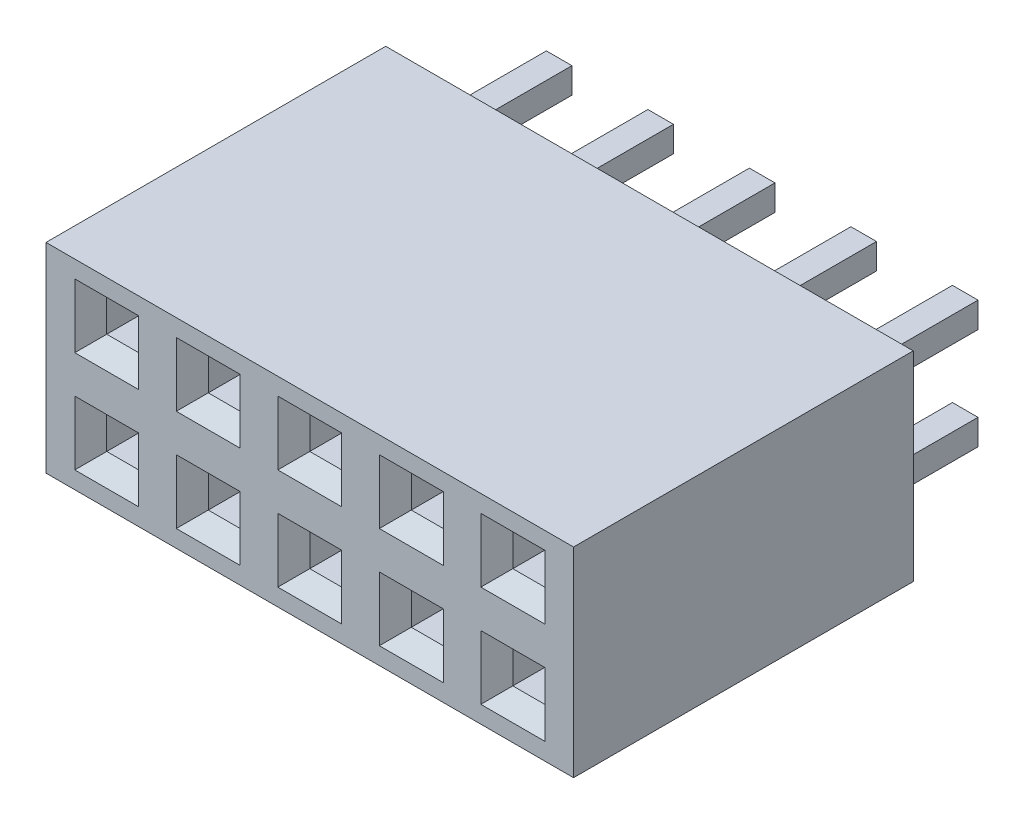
ISO-10303-21;
HEADER;
FILE_DESCRIPTION(('STEP AP214'),'2;1');
FILE_NAME('part.step','',(''),(''),'','','');
FILE_SCHEMA(('AUTOMOTIVE_DESIGN { 1 0 10303 214 1 1 1 1 }'));
ENDSEC;
DATA;
#1=APPLICATION_CONTEXT('core data for automotive mechanical design processes');
#2=APPLICATION_PROTOCOL_DEFINITION('international standard','automotive_design',2000,#1);
#3=PRODUCT_CONTEXT('',#1,'mechanical');
#4=PRODUCT('Part','Part','',(#3));
#5=PRODUCT_RELATED_PRODUCT_CATEGORY('part','',(#4));
#6=PRODUCT_DEFINITION_FORMATION('','',#4);
#7=PRODUCT_DEFINITION_CONTEXT('part definition',#1,'design');
#8=PRODUCT_DEFINITION('design','',#6,#7);
#9=PRODUCT_DEFINITION_SHAPE('','',#8);
#10=(LENGTH_UNIT() NAMED_UNIT(*) SI_UNIT(.MILLI.,.METRE.));
#11=(NAMED_UNIT(*) PLANE_ANGLE_UNIT() SI_UNIT($,.RADIAN.));
#12=(NAMED_UNIT(*) SI_UNIT($,.STERADIAN.) SOLID_ANGLE_UNIT());
#13=UNCERTAINTY_MEASURE_WITH_UNIT(LENGTH_MEASURE(1.E-05),#10,'distance_accuracy_value','');
#14=(GEOMETRIC_REPRESENTATION_CONTEXT(3) GLOBAL_UNCERTAINTY_ASSIGNED_CONTEXT((#13)) GLOBAL_UNIT_ASSIGNED_CONTEXT((#10,
#11,#12)) REPRESENTATION_CONTEXT('',''));
#15=CARTESIAN_POINT('',(0.,0.,0.));
#16=DIRECTION('',(0.,0.,1.));
#17=DIRECTION('',(1.,0.,0.));
#18=AXIS2_PLACEMENT_3D('',#15,#16,#17);
#19=CARTESIAN_POINT('',(-4.68,-1.67,2.5));
#20=DIRECTION('',(-1.,0.,0.));
#21=DIRECTION('',(0.,-1.,0.));
#22=AXIS2_PLACEMENT_3D('',#19,#20,#21);
#23=PLANE('',#22);
#24=DIRECTION('',(0.,0.,1.));
#25=VECTOR('',#24,1.);
#26=CARTESIAN_POINT('',(-4.68,-0.87,2.5));
#27=LINE('',#26,#25);
#28=CARTESIAN_POINT('',(-4.68,-0.87,2.5));
#29=VERTEX_POINT('',#28);
#30=CARTESIAN_POINT('',(-4.68,-0.87,8.1));
#31=VERTEX_POINT('',#30);
#32=EDGE_CURVE('E782',#29,#31,#27,.T.);
#33=ORIENTED_EDGE('',*,*,#32,.F.);
#34=DIRECTION('',(0.,-1.,0.));
#35=VECTOR('',#34,1.);
#36=CARTESIAN_POINT('',(-4.68,-1.67,2.5));
#37=LINE('',#36,#35);
#38=CARTESIAN_POINT('',(-4.68,-1.67,2.5));
#39=VERTEX_POINT('',#38);
#40=EDGE_CURVE('E787',#29,#39,#37,.T.);
#41=ORIENTED_EDGE('',*,*,#40,.T.);
#42=DIRECTION('',(0.,0.,1.));
#43=VECTOR('',#42,1.);
#44=CARTESIAN_POINT('',(-4.68,-1.67,2.5));
#45=LINE('',#44,#43);
#46=CARTESIAN_POINT('',(-4.68,-1.67,8.1));
#47=VERTEX_POINT('',#46);
#48=EDGE_CURVE('E784',#47,#39,#45,.F.);
#49=ORIENTED_EDGE('',*,*,#48,.F.);
#50=DIRECTION('',(0.,-1.,0.));
#51=VECTOR('',#50,1.);
#52=CARTESIAN_POINT('',(-4.68,-1.67,8.1));
#53=LINE('',#52,#51);
#54=EDGE_CURVE('E20',#47,#31,#53,.F.);
#55=ORIENTED_EDGE('',*,*,#54,.T.);
#56=EDGE_LOOP('',(#33,#41,#49,#55));
#57=FACE_BOUND('',#56,.T.);
#58=ADVANCED_FACE('F17',(#57),#23,.T.);
#59=CARTESIAN_POINT('',(-2.14,-1.67,2.5));
#60=DIRECTION('',(-1.,0.,0.));
#61=DIRECTION('',(0.,-1.,0.));
#62=AXIS2_PLACEMENT_3D('',#59,#60,#61);
#63=PLANE('',#62);
#64=DIRECTION('',(0.,0.,1.));
#65=VECTOR('',#64,1.);
#66=CARTESIAN_POINT('',(-2.14,-0.87,2.5));
#67=LINE('',#66,#65);
#68=CARTESIAN_POINT('',(-2.14,-0.87,2.5));
#69=VERTEX_POINT('',#68);
#70=CARTESIAN_POINT('',(-2.14,-0.87,8.1));
#71=VERTEX_POINT('',#70);
#72=EDGE_CURVE('E848',#69,#71,#67,.T.);
#73=ORIENTED_EDGE('',*,*,#72,.F.);
#74=DIRECTION('',(0.,-1.,0.));
#75=VECTOR('',#74,1.);
#76=CARTESIAN_POINT('',(-2.14,-1.67,2.5));
#77=LINE('',#76,#75);
#78=CARTESIAN_POINT('',(-2.14,-1.67,2.5));
#79=VERTEX_POINT('',#78);
#80=EDGE_CURVE('E836',#69,#79,#77,.T.);
#81=ORIENTED_EDGE('',*,*,#80,.T.);
#82=DIRECTION('',(0.,0.,1.));
#83=VECTOR('',#82,1.);
#84=CARTESIAN_POINT('',(-2.14,-1.67,2.5));
#85=LINE('',#84,#83);
#86=CARTESIAN_POINT('',(-2.14,-1.67,8.1));
#87=VERTEX_POINT('',#86);
#88=EDGE_CURVE('E858',#87,#79,#85,.F.);
#89=ORIENTED_EDGE('',*,*,#88,.F.);
#90=DIRECTION('',(0.,-1.,0.));
#91=VECTOR('',#90,1.);
#92=CARTESIAN_POINT('',(-2.14,-1.67,8.1));
#93=LINE('',#92,#91);
#94=EDGE_CURVE('E838',#87,#71,#93,.F.);
#95=ORIENTED_EDGE('',*,*,#94,.T.);
#96=EDGE_LOOP('',(#73,#81,#89,#95));
#97=FACE_BOUND('',#96,.T.);
#98=ADVANCED_FACE('F3760',(#97),#63,.T.);
#99=CARTESIAN_POINT('',(5.48,-1.67,2.5));
#100=DIRECTION('',(-1.,0.,0.));
#101=DIRECTION('',(0.,-1.,0.));
#102=AXIS2_PLACEMENT_3D('',#99,#100,#101);
#103=PLANE('',#102);
#104=DIRECTION('',(0.,0.,1.));
#105=VECTOR('',#104,1.);
#106=CARTESIAN_POINT('',(5.48,-0.87,2.5));
#107=LINE('',#106,#105);
#108=CARTESIAN_POINT('',(5.48,-0.87,2.5));
#109=VERTEX_POINT('',#108);
#110=CARTESIAN_POINT('',(5.48,-0.87,8.1));
#111=VERTEX_POINT('',#110);
#112=EDGE_CURVE('E866',#109,#111,#107,.T.);
#113=ORIENTED_EDGE('',*,*,#112,.F.);
#114=DIRECTION('',(0.,-1.,0.));
#115=VECTOR('',#114,1.);
#116=CARTESIAN_POINT('',(5.48,-1.67,2.5));
#117=LINE('',#116,#115);
#118=CARTESIAN_POINT('',(5.48,-1.67,2.5));
#119=VERTEX_POINT('',#118);
#120=EDGE_CURVE('E832',#109,#119,#117,.T.);
#121=ORIENTED_EDGE('',*,*,#120,.T.);
#122=DIRECTION('',(0.,0.,1.));
#123=VECTOR('',#122,1.);
#124=CARTESIAN_POINT('',(5.48,-1.67,2.5));
#125=LINE('',#124,#123);
#126=CARTESIAN_POINT('',(5.48,-1.67,8.1));
#127=VERTEX_POINT('',#126);
#128=EDGE_CURVE('E873',#127,#119,#125,.F.);
#129=ORIENTED_EDGE('',*,*,#128,.F.);
#130=DIRECTION('',(0.,-1.,0.));
#131=VECTOR('',#130,1.);
#132=CARTESIAN_POINT('',(5.48,-1.67,8.1));
#133=LINE('',#132,#131);
#134=EDGE_CURVE('E834',#127,#111,#133,.F.);
#135=ORIENTED_EDGE('',*,*,#134,.T.);
#136=EDGE_LOOP('',(#113,#121,#129,#135));
#137=FACE_BOUND('',#136,.T.);
#138=ADVANCED_FACE('F3750',(#137),#103,.T.);
#139=CARTESIAN_POINT('',(2.94,-1.67,2.5));
#140=DIRECTION('',(-1.,0.,0.));
#141=DIRECTION('',(0.,-1.,0.));
#142=AXIS2_PLACEMENT_3D('',#139,#140,#141);
#143=PLANE('',#142);
#144=DIRECTION('',(0.,0.,1.));
#145=VECTOR('',#144,1.);
#146=CARTESIAN_POINT('',(2.94,-0.87,2.5));
#147=LINE('',#146,#145);
#148=CARTESIAN_POINT('',(2.94,-0.87,2.5));
#149=VERTEX_POINT('',#148);
#150=CARTESIAN_POINT('',(2.94,-0.87,8.1));
#151=VERTEX_POINT('',#150);
#152=EDGE_CURVE('E881',#149,#151,#147,.T.);
#153=ORIENTED_EDGE('',*,*,#152,.F.);
#154=DIRECTION('',(0.,-1.,0.));
#155=VECTOR('',#154,1.);
#156=CARTESIAN_POINT('',(2.94,-1.67,2.5));
#157=LINE('',#156,#155);
#158=CARTESIAN_POINT('',(2.94,-1.67,2.5));
#159=VERTEX_POINT('',#158);
#160=EDGE_CURVE('E828',#149,#159,#157,.T.);
#161=ORIENTED_EDGE('',*,*,#160,.T.);
#162=DIRECTION('',(0.,0.,1.));
#163=VECTOR('',#162,1.);
#164=CARTESIAN_POINT('',(2.94,-1.67,2.5));
#165=LINE('',#164,#163);
#166=CARTESIAN_POINT('',(2.94,-1.67,8.1));
#167=VERTEX_POINT('',#166);
#168=EDGE_CURVE('E888',#167,#159,#165,.F.);
#169=ORIENTED_EDGE('',*,*,#168,.F.);
#170=DIRECTION('',(0.,-1.,0.));
#171=VECTOR('',#170,1.);
#172=CARTESIAN_POINT('',(2.94,-1.67,8.1));
#173=LINE('',#172,#171);
#174=EDGE_CURVE('E830',#167,#151,#173,.F.);
#175=ORIENTED_EDGE('',*,*,#174,.T.);
#176=EDGE_LOOP('',(#153,#161,#169,#175));
#177=FACE_BOUND('',#176,.T.);
#178=ADVANCED_FACE('F3740',(#177),#143,.T.);
#179=CARTESIAN_POINT('',(0.4,-1.67,2.5));
#180=DIRECTION('',(-1.,0.,0.));
#181=DIRECTION('',(0.,-1.,0.));
#182=AXIS2_PLACEMENT_3D('',#179,#180,#181);
#183=PLANE('',#182);
#184=DIRECTION('',(0.,0.,1.));
#185=VECTOR('',#184,1.);
#186=CARTESIAN_POINT('',(0.4,-0.87,2.5));
#187=LINE('',#186,#185);
#188=CARTESIAN_POINT('',(0.4,-0.87,2.5));
#189=VERTEX_POINT('',#188);
#190=CARTESIAN_POINT('',(0.4,-0.87,8.1));
#191=VERTEX_POINT('',#190);
#192=EDGE_CURVE('E896',#189,#191,#187,.T.);
#193=ORIENTED_EDGE('',*,*,#192,.F.);
#194=DIRECTION('',(0.,-1.,0.));
#195=VECTOR('',#194,1.);
#196=CARTESIAN_POINT('',(0.4,-1.67,2.5));
#197=LINE('',#196,#195);
#198=CARTESIAN_POINT('',(0.4,-1.67,2.5));
#199=VERTEX_POINT('',#198);
#200=EDGE_CURVE('E824',#189,#199,#197,.T.);
#201=ORIENTED_EDGE('',*,*,#200,.T.);
#202=DIRECTION('',(0.,0.,1.));
#203=VECTOR('',#202,1.);
#204=CARTESIAN_POINT('',(0.4,-1.67,2.5));
#205=LINE('',#204,#203);
#206=CARTESIAN_POINT('',(0.4,-1.67,8.1));
#207=VERTEX_POINT('',#206);
#208=EDGE_CURVE('E903',#207,#199,#205,.F.);
#209=ORIENTED_EDGE('',*,*,#208,.F.);
#210=DIRECTION('',(0.,-1.,0.));
#211=VECTOR('',#210,1.);
#212=CARTESIAN_POINT('',(0.4,-1.67,8.1));
#213=LINE('',#212,#211);
#214=EDGE_CURVE('E826',#207,#191,#213,.F.);
#215=ORIENTED_EDGE('',*,*,#214,.T.);
#216=EDGE_LOOP('',(#193,#201,#209,#215));
#217=FACE_BOUND('',#216,.T.);
#218=ADVANCED_FACE('F3730',(#217),#183,.T.);
#219=CARTESIAN_POINT('',(-0.4,1.67,2.5));
#220=DIRECTION('',(-1.,0.,0.));
#221=DIRECTION('',(0.,-1.,0.));
#222=AXIS2_PLACEMENT_3D('',#219,#220,#221);
#223=PLANE('',#222);
#224=DIRECTION('',(0.,-1.,0.));
#225=VECTOR('',#224,1.);
#226=CARTESIAN_POINT('',(-0.4,1.67,8.1));
#227=LINE('',#226,#225);
#228=CARTESIAN_POINT('',(-0.4,0.87,8.1));
#229=VERTEX_POINT('',#228);
#230=CARTESIAN_POINT('',(-0.4,1.67,8.1));
#231=VERTEX_POINT('',#230);
#232=EDGE_CURVE('E822',#229,#231,#227,.F.);
#233=ORIENTED_EDGE('',*,*,#232,.F.);
#234=DIRECTION('',(0.,0.,1.));
#235=VECTOR('',#234,1.);
#236=CARTESIAN_POINT('',(-0.4,0.87,2.5));
#237=LINE('',#236,#235);
#238=CARTESIAN_POINT('',(-0.4,0.87,2.5));
#239=VERTEX_POINT('',#238);
#240=EDGE_CURVE('E927',#229,#239,#237,.F.);
#241=ORIENTED_EDGE('',*,*,#240,.T.);
#242=DIRECTION('',(0.,1.,0.));
#243=VECTOR('',#242,1.);
#244=CARTESIAN_POINT('',(-0.4,0.,2.5));
#245=LINE('',#244,#243);
#246=CARTESIAN_POINT('',(-0.4,1.67,2.5));
#247=VERTEX_POINT('',#246);
#248=EDGE_CURVE('E911',#247,#239,#245,.F.);
#249=ORIENTED_EDGE('',*,*,#248,.F.);
#250=DIRECTION('',(0.,0.,1.));
#251=VECTOR('',#250,1.);
#252=CARTESIAN_POINT('',(-0.4,1.67,2.5));
#253=LINE('',#252,#251);
#254=EDGE_CURVE('E916',#247,#231,#253,.T.);
#255=ORIENTED_EDGE('',*,*,#254,.T.);
#256=EDGE_LOOP('',(#233,#241,#249,#255));
#257=FACE_BOUND('',#256,.T.);
#258=ADVANCED_FACE('F3720',(#257),#223,.F.);
#259=CARTESIAN_POINT('',(2.14,1.67,2.5));
#260=DIRECTION('',(-1.,0.,0.));
#261=DIRECTION('',(0.,-1.,0.));
#262=AXIS2_PLACEMENT_3D('',#259,#260,#261);
#263=PLANE('',#262);
#264=DIRECTION('',(0.,-1.,0.));
#265=VECTOR('',#264,1.);
#266=CARTESIAN_POINT('',(2.14,1.67,8.1));
#267=LINE('',#266,#265);
#268=CARTESIAN_POINT('',(2.14,0.87,8.1));
#269=VERTEX_POINT('',#268);
#270=CARTESIAN_POINT('',(2.14,1.67,8.1));
#271=VERTEX_POINT('',#270);
#272=EDGE_CURVE('E820',#269,#271,#267,.F.);
#273=ORIENTED_EDGE('',*,*,#272,.F.);
#274=DIRECTION('',(0.,0.,1.));
#275=VECTOR('',#274,1.);
#276=CARTESIAN_POINT('',(2.14,0.87,2.5));
#277=LINE('',#276,#275);
#278=CARTESIAN_POINT('',(2.14,0.87,2.5));
#279=VERTEX_POINT('',#278);
#280=EDGE_CURVE('E946',#269,#279,#277,.F.);
#281=ORIENTED_EDGE('',*,*,#280,.T.);
#282=DIRECTION('',(0.,1.,0.));
#283=VECTOR('',#282,1.);
#284=CARTESIAN_POINT('',(2.14,0.,2.5));
#285=LINE('',#284,#283);
#286=CARTESIAN_POINT('',(2.14,1.67,2.5));
#287=VERTEX_POINT('',#286);
#288=EDGE_CURVE('E930',#287,#279,#285,.F.);
#289=ORIENTED_EDGE('',*,*,#288,.F.);
#290=DIRECTION('',(0.,0.,1.));
#291=VECTOR('',#290,1.);
#292=CARTESIAN_POINT('',(2.14,1.67,2.5));
#293=LINE('',#292,#291);
#294=EDGE_CURVE('E935',#287,#271,#293,.T.);
#295=ORIENTED_EDGE('',*,*,#294,.T.);
#296=EDGE_LOOP('',(#273,#281,#289,#295));
#297=FACE_BOUND('',#296,.T.);
#298=ADVANCED_FACE('F3710',(#297),#263,.F.);
#299=CARTESIAN_POINT('',(4.68,1.67,2.5));
#300=DIRECTION('',(-1.,0.,0.));
#301=DIRECTION('',(0.,-1.,0.));
#302=AXIS2_PLACEMENT_3D('',#299,#300,#301);
#303=PLANE('',#302);
#304=DIRECTION('',(0.,-1.,0.));
#305=VECTOR('',#304,1.);
#306=CARTESIAN_POINT('',(4.68,1.67,8.1));
#307=LINE('',#306,#305);
#308=CARTESIAN_POINT('',(4.68,0.87,8.1));
#309=VERTEX_POINT('',#308);
#310=CARTESIAN_POINT('',(4.68,1.67,8.1));
#311=VERTEX_POINT('',#310);
#312=EDGE_CURVE('E818',#309,#311,#307,.F.);
#313=ORIENTED_EDGE('',*,*,#312,.F.);
#314=DIRECTION('',(0.,0.,1.));
#315=VECTOR('',#314,1.);
#316=CARTESIAN_POINT('',(4.68,0.87,2.5));
#317=LINE('',#316,#315);
#318=CARTESIAN_POINT('',(4.68,0.87,2.5));
#319=VERTEX_POINT('',#318);
#320=EDGE_CURVE('E965',#309,#319,#317,.F.);
#321=ORIENTED_EDGE('',*,*,#320,.T.);
#322=DIRECTION('',(0.,1.,0.));
#323=VECTOR('',#322,1.);
#324=CARTESIAN_POINT('',(4.68,0.,2.5));
#325=LINE('',#324,#323);
#326=CARTESIAN_POINT('',(4.68,1.67,2.5));
#327=VERTEX_POINT('',#326);
#328=EDGE_CURVE('E949',#327,#319,#325,.F.);
#329=ORIENTED_EDGE('',*,*,#328,.F.);
#330=DIRECTION('',(0.,0.,1.));
#331=VECTOR('',#330,1.);
#332=CARTESIAN_POINT('',(4.68,1.67,2.5));
#333=LINE('',#332,#331);
#334=EDGE_CURVE('E954',#327,#311,#333,.T.);
#335=ORIENTED_EDGE('',*,*,#334,.T.);
#336=EDGE_LOOP('',(#313,#321,#329,#335));
#337=FACE_BOUND('',#336,.T.);
#338=ADVANCED_FACE('F3700',(#337),#303,.F.);
#339=CARTESIAN_POINT('',(-2.94,1.67,2.5));
#340=DIRECTION('',(-1.,0.,0.));
#341=DIRECTION('',(0.,-1.,0.));
#342=AXIS2_PLACEMENT_3D('',#339,#340,#341);
#343=PLANE('',#342);
#344=DIRECTION('',(0.,-1.,0.));
#345=VECTOR('',#344,1.);
#346=CARTESIAN_POINT('',(-2.94,1.67,8.1));
#347=LINE('',#346,#345);
#348=CARTESIAN_POINT('',(-2.94,0.87,8.1));
#349=VERTEX_POINT('',#348);
#350=CARTESIAN_POINT('',(-2.94,1.67,8.1));
#351=VERTEX_POINT('',#350);
#352=EDGE_CURVE('E816',#349,#351,#347,.F.);
#353=ORIENTED_EDGE('',*,*,#352,.F.);
#354=DIRECTION('',(0.,0.,1.));
#355=VECTOR('',#354,1.);
#356=CARTESIAN_POINT('',(-2.94,0.87,2.5));
#357=LINE('',#356,#355);
#358=CARTESIAN_POINT('',(-2.94,0.87,2.5));
#359=VERTEX_POINT('',#358);
#360=EDGE_CURVE('E984',#349,#359,#357,.F.);
#361=ORIENTED_EDGE('',*,*,#360,.T.);
#362=DIRECTION('',(0.,1.,0.));
#363=VECTOR('',#362,1.);
#364=CARTESIAN_POINT('',(-2.94,0.,2.5));
#365=LINE('',#364,#363);
#366=CARTESIAN_POINT('',(-2.94,1.67,2.5));
#367=VERTEX_POINT('',#366);
#368=EDGE_CURVE('E968',#367,#359,#365,.F.);
#369=ORIENTED_EDGE('',*,*,#368,.F.);
#370=DIRECTION('',(0.,0.,1.));
#371=VECTOR('',#370,1.);
#372=CARTESIAN_POINT('',(-2.94,1.67,2.5));
#373=LINE('',#372,#371);
#374=EDGE_CURVE('E973',#367,#351,#373,.T.);
#375=ORIENTED_EDGE('',*,*,#374,.T.);
#376=EDGE_LOOP('',(#353,#361,#369,#375));
#377=FACE_BOUND('',#376,.T.);
#378=ADVANCED_FACE('F3690',(#377),#343,.F.);
#379=CARTESIAN_POINT('',(-5.48,1.67,2.5));
#380=DIRECTION('',(-1.,0.,0.));
#381=DIRECTION('',(0.,-1.,0.));
#382=AXIS2_PLACEMENT_3D('',#379,#380,#381);
#383=PLANE('',#382);
#384=DIRECTION('',(0.,-1.,0.));
#385=VECTOR('',#384,1.);
#386=CARTESIAN_POINT('',(-5.48,1.67,8.1));
#387=LINE('',#386,#385);
#388=CARTESIAN_POINT('',(-5.48,0.87,8.1));
#389=VERTEX_POINT('',#388);
#390=CARTESIAN_POINT('',(-5.48,1.67,8.1));
#391=VERTEX_POINT('',#390);
#392=EDGE_CURVE('E795',#389,#391,#387,.F.);
#393=ORIENTED_EDGE('',*,*,#392,.F.);
#394=DIRECTION('',(0.,0.,1.));
#395=VECTOR('',#394,1.);
#396=CARTESIAN_POINT('',(-5.48,0.87,2.5));
#397=LINE('',#396,#395);
#398=CARTESIAN_POINT('',(-5.48,0.87,2.5));
#399=VERTEX_POINT('',#398);
#400=EDGE_CURVE('E1003',#389,#399,#397,.F.);
#401=ORIENTED_EDGE('',*,*,#400,.T.);
#402=DIRECTION('',(0.,1.,0.));
#403=VECTOR('',#402,1.);
#404=CARTESIAN_POINT('',(-5.48,0.,2.5));
#405=LINE('',#404,#403);
#406=CARTESIAN_POINT('',(-5.48,1.67,2.5));
#407=VERTEX_POINT('',#406);
#408=EDGE_CURVE('E987',#407,#399,#405,.F.);
#409=ORIENTED_EDGE('',*,*,#408,.F.);
#410=DIRECTION('',(0.,0.,1.));
#411=VECTOR('',#410,1.);
#412=CARTESIAN_POINT('',(-5.48,1.67,2.5));
#413=LINE('',#412,#411);
#414=EDGE_CURVE('E992',#407,#391,#413,.T.);
#415=ORIENTED_EDGE('',*,*,#414,.T.);
#416=EDGE_LOOP('',(#393,#401,#409,#415));
#417=FACE_BOUND('',#416,.T.);
#418=ADVANCED_FACE('F3681',(#417),#383,.F.);
#419=CARTESIAN_POINT('',(-4.76,-1.59,-2.82));
#420=DIRECTION('',(0.,-0.707106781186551,-0.707106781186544));
#421=DIRECTION('',(0.,0.707106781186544,-0.707106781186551));
#422=AXIS2_PLACEMENT_3D('',#419,#420,#421);
#423=PLANE('',#422);
#424=DIRECTION('',(-0.577350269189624,0.577350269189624,-0.577350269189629));
#425=VECTOR('',#424,1.);
#426=CARTESIAN_POINT('',(-4.76,-1.59,-2.82));
#427=LINE('',#426,#425);
#428=CARTESIAN_POINT('',(-4.76,-1.59,-2.82));
#429=VERTEX_POINT('',#428);
#430=CARTESIAN_POINT('',(-4.94,-1.41000000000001,-3.));
#431=VERTEX_POINT('',#430);
#432=EDGE_CURVE('E1006',#429,#431,#427,.T.);
#433=ORIENTED_EDGE('',*,*,#432,.F.);
#434=DIRECTION('',(1.,0.,0.));
#435=VECTOR('',#434,1.);
#436=CARTESIAN_POINT('',(-4.76,-1.59,-2.82));
#437=LINE('',#436,#435);
#438=CARTESIAN_POINT('',(-5.4,-1.59,-2.82));
#439=VERTEX_POINT('',#438);
#440=EDGE_CURVE('E1019',#439,#429,#437,.T.);
#441=ORIENTED_EDGE('',*,*,#440,.F.);
#442=DIRECTION('',(-0.577350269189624,-0.577350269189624,0.577350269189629));
#443=VECTOR('',#442,1.);
#444=CARTESIAN_POINT('',(-5.22000000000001,-1.41000000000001,-3.));
#445=LINE('',#444,#443);
#446=CARTESIAN_POINT('',(-5.22000000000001,-1.41000000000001,-3.));
#447=VERTEX_POINT('',#446);
#448=EDGE_CURVE('E1014',#447,#439,#445,.T.);
#449=ORIENTED_EDGE('',*,*,#448,.F.);
#450=DIRECTION('',(1.,0.,0.));
#451=VECTOR('',#450,1.);
#452=CARTESIAN_POINT('',(-5.08,-1.41000000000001,-3.));
#453=LINE('',#452,#451);
#454=EDGE_CURVE('E1008',#447,#431,#453,.T.);
#455=ORIENTED_EDGE('',*,*,#454,.T.);
#456=EDGE_LOOP('',(#433,#441,#449,#455));
#457=FACE_BOUND('',#456,.T.);
#458=ADVANCED_FACE('F1957',(#457),#423,.T.);
#459=CARTESIAN_POINT('',(-2.22,-1.59,-2.82));
#460=DIRECTION('',(0.,-0.707106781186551,-0.707106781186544));
#461=DIRECTION('',(0.,0.707106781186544,-0.707106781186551));
#462=AXIS2_PLACEMENT_3D('',#459,#460,#461);
#463=PLANE('',#462);
#464=DIRECTION('',(-0.577350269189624,0.577350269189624,-0.577350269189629));
#465=VECTOR('',#464,1.);
#466=CARTESIAN_POINT('',(-2.22,-1.59,-2.82));
#467=LINE('',#466,#465);
#468=CARTESIAN_POINT('',(-2.22,-1.59,-2.82));
#469=VERTEX_POINT('',#468);
#470=CARTESIAN_POINT('',(-2.39999999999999,-1.41000000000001,-3.));
#471=VERTEX_POINT('',#470);
#472=EDGE_CURVE('E1023',#469,#471,#467,.T.);
#473=ORIENTED_EDGE('',*,*,#472,.F.);
#474=DIRECTION('',(1.,0.,0.));
#475=VECTOR('',#474,1.);
#476=CARTESIAN_POINT('',(-2.22,-1.59,-2.82));
#477=LINE('',#476,#475);
#478=CARTESIAN_POINT('',(-2.86,-1.59,-2.82));
#479=VERTEX_POINT('',#478);
#480=EDGE_CURVE('E1036',#479,#469,#477,.T.);
#481=ORIENTED_EDGE('',*,*,#480,.F.);
#482=DIRECTION('',(-0.577350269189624,-0.577350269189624,0.577350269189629));
#483=VECTOR('',#482,1.);
#484=CARTESIAN_POINT('',(-2.68000000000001,-1.41000000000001,-3.));
#485=LINE('',#484,#483);
#486=CARTESIAN_POINT('',(-2.68000000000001,-1.41000000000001,-3.));
#487=VERTEX_POINT('',#486);
#488=EDGE_CURVE('E1031',#487,#479,#485,.T.);
#489=ORIENTED_EDGE('',*,*,#488,.F.);
#490=DIRECTION('',(1.,0.,0.));
#491=VECTOR('',#490,1.);
#492=CARTESIAN_POINT('',(-2.54,-1.41000000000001,-3.));
#493=LINE('',#492,#491);
#494=EDGE_CURVE('E1025',#487,#471,#493,.T.);
#495=ORIENTED_EDGE('',*,*,#494,.T.);
#496=EDGE_LOOP('',(#473,#481,#489,#495));
#497=FACE_BOUND('',#496,.T.);
#498=ADVANCED_FACE('F3662',(#497),#463,.T.);
#499=CARTESIAN_POINT('',(5.4,-1.59,-2.82));
#500=DIRECTION('',(0.,-0.707106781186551,-0.707106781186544));
#501=DIRECTION('',(0.,0.707106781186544,-0.707106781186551));
#502=AXIS2_PLACEMENT_3D('',#499,#500,#501);
#503=PLANE('',#502);
#504=DIRECTION('',(-0.577350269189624,0.577350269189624,-0.577350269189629));
#505=VECTOR('',#504,1.);
#506=CARTESIAN_POINT('',(5.4,-1.59,-2.82));
#507=LINE('',#506,#505);
#508=CARTESIAN_POINT('',(5.4,-1.59,-2.82));
#509=VERTEX_POINT('',#508);
#510=CARTESIAN_POINT('',(5.22000000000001,-1.41000000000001,-3.));
#511=VERTEX_POINT('',#510);
#512=EDGE_CURVE('E1040',#509,#511,#507,.T.);
#513=ORIENTED_EDGE('',*,*,#512,.F.);
#514=DIRECTION('',(1.,0.,0.));
#515=VECTOR('',#514,1.);
#516=CARTESIAN_POINT('',(5.4,-1.59,-2.82));
#517=LINE('',#516,#515);
#518=CARTESIAN_POINT('',(4.76,-1.59,-2.82));
#519=VERTEX_POINT('',#518);
#520=EDGE_CURVE('E1053',#519,#509,#517,.T.);
#521=ORIENTED_EDGE('',*,*,#520,.F.);
#522=DIRECTION('',(-0.577350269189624,-0.577350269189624,0.577350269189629));
#523=VECTOR('',#522,1.);
#524=CARTESIAN_POINT('',(4.94,-1.41000000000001,-3.));
#525=LINE('',#524,#523);
#526=CARTESIAN_POINT('',(4.94,-1.41000000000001,-3.));
#527=VERTEX_POINT('',#526);
#528=EDGE_CURVE('E1048',#527,#519,#525,.T.);
#529=ORIENTED_EDGE('',*,*,#528,.F.);
#530=DIRECTION('',(1.,0.,0.));
#531=VECTOR('',#530,1.);
#532=CARTESIAN_POINT('',(5.08,-1.41000000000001,-3.));
#533=LINE('',#532,#531);
#534=EDGE_CURVE('E1042',#527,#511,#533,.T.);
#535=ORIENTED_EDGE('',*,*,#534,.T.);
#536=EDGE_LOOP('',(#513,#521,#529,#535));
#537=FACE_BOUND('',#536,.T.);
#538=ADVANCED_FACE('F3652',(#537),#503,.T.);
#539=CARTESIAN_POINT('',(2.86,-1.59,-2.82));
#540=DIRECTION('',(0.,-0.707106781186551,-0.707106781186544));
#541=DIRECTION('',(0.,0.707106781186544,-0.707106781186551));
#542=AXIS2_PLACEMENT_3D('',#539,#540,#541);
#543=PLANE('',#542);
#544=DIRECTION('',(-0.577350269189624,0.577350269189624,-0.577350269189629));
#545=VECTOR('',#544,1.);
#546=CARTESIAN_POINT('',(2.86,-1.59,-2.82));
#547=LINE('',#546,#545);
#548=CARTESIAN_POINT('',(2.86,-1.59,-2.82));
#549=VERTEX_POINT('',#548);
#550=CARTESIAN_POINT('',(2.68000000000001,-1.41000000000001,-3.));
#551=VERTEX_POINT('',#550);
#552=EDGE_CURVE('E1057',#549,#551,#547,.T.);
#553=ORIENTED_EDGE('',*,*,#552,.F.);
#554=DIRECTION('',(1.,0.,0.));
#555=VECTOR('',#554,1.);
#556=CARTESIAN_POINT('',(2.86,-1.59,-2.82));
#557=LINE('',#556,#555);
#558=CARTESIAN_POINT('',(2.22,-1.59,-2.82));
#559=VERTEX_POINT('',#558);
#560=EDGE_CURVE('E1070',#559,#549,#557,.T.);
#561=ORIENTED_EDGE('',*,*,#560,.F.);
#562=DIRECTION('',(-0.577350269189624,-0.577350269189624,0.577350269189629));
#563=VECTOR('',#562,1.);
#564=CARTESIAN_POINT('',(2.39999999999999,-1.41000000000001,-3.));
#565=LINE('',#564,#563);
#566=CARTESIAN_POINT('',(2.39999999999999,-1.41000000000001,-3.));
#567=VERTEX_POINT('',#566);
#568=EDGE_CURVE('E1065',#567,#559,#565,.T.);
#569=ORIENTED_EDGE('',*,*,#568,.F.);
#570=DIRECTION('',(1.,0.,0.));
#571=VECTOR('',#570,1.);
#572=CARTESIAN_POINT('',(2.54,-1.41000000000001,-3.));
#573=LINE('',#572,#571);
#574=EDGE_CURVE('E1059',#567,#551,#573,.T.);
#575=ORIENTED_EDGE('',*,*,#574,.T.);
#576=EDGE_LOOP('',(#553,#561,#569,#575));
#577=FACE_BOUND('',#576,.T.);
#578=ADVANCED_FACE('F3642',(#577),#543,.T.);
#579=CARTESIAN_POINT('',(0.32,-1.59,-2.82));
#580=DIRECTION('',(0.,-0.707106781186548,-0.707106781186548));
#581=DIRECTION('',(0.,0.707106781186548,-0.707106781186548));
#582=AXIS2_PLACEMENT_3D('',#579,#580,#581);
#583=PLANE('',#582);
#584=DIRECTION('',(-0.577350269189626,0.577350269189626,-0.577350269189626));
#585=VECTOR('',#584,1.);
#586=CARTESIAN_POINT('',(0.32,-1.59,-2.82));
#587=LINE('',#586,#585);
#588=CARTESIAN_POINT('',(0.32,-1.59,-2.82));
#589=VERTEX_POINT('',#588);
#590=CARTESIAN_POINT('',(0.14,-1.41,-3.));
#591=VERTEX_POINT('',#590);
#592=EDGE_CURVE('E1074',#589,#591,#587,.T.);
#593=ORIENTED_EDGE('',*,*,#592,.F.);
#594=DIRECTION('',(1.,0.,0.));
#595=VECTOR('',#594,1.);
#596=CARTESIAN_POINT('',(0.32,-1.59,-2.82));
#597=LINE('',#596,#595);
#598=CARTESIAN_POINT('',(-0.32,-1.59,-2.82));
#599=VERTEX_POINT('',#598);
#600=EDGE_CURVE('E1087',#599,#589,#597,.T.);
#601=ORIENTED_EDGE('',*,*,#600,.F.);
#602=DIRECTION('',(-0.577350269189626,-0.577350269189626,0.577350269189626));
#603=VECTOR('',#602,1.);
#604=CARTESIAN_POINT('',(-0.14,-1.41,-3.));
#605=LINE('',#604,#603);
#606=CARTESIAN_POINT('',(-0.140000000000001,-1.41,-3.));
#607=VERTEX_POINT('',#606);
#608=EDGE_CURVE('E1082',#607,#599,#605,.T.);
#609=ORIENTED_EDGE('',*,*,#608,.F.);
#610=DIRECTION('',(1.,0.,0.));
#611=VECTOR('',#610,1.);
#612=CARTESIAN_POINT('',(0.,-1.41,-3.));
#613=LINE('',#612,#611);
#614=EDGE_CURVE('E1076',#607,#591,#613,.T.);
#615=ORIENTED_EDGE('',*,*,#614,.T.);
#616=EDGE_LOOP('',(#593,#601,#609,#615));
#617=FACE_BOUND('',#616,.T.);
#618=ADVANCED_FACE('F3632',(#617),#583,.T.);
#619=CARTESIAN_POINT('',(-2.68,0.,-3.));
#620=DIRECTION('',(0.707106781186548,0.,0.707106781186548));
#621=DIRECTION('',(0.707106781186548,0.,-0.707106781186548));
#622=AXIS2_PLACEMENT_3D('',#619,#620,#621);
#623=PLANE('',#622);
#624=DIRECTION('',(0.,1.,0.));
#625=VECTOR('',#624,1.);
#626=CARTESIAN_POINT('',(-2.68,0.,-3.));
#627=LINE('',#626,#625);
#628=CARTESIAN_POINT('',(-2.68,1.41,-3.));
#629=VERTEX_POINT('',#628);
#630=CARTESIAN_POINT('',(-2.68,1.13,-3.));
#631=VERTEX_POINT('',#630);
#632=EDGE_CURVE('E1091',#629,#631,#627,.F.);
#633=ORIENTED_EDGE('',*,*,#632,.T.);
#634=DIRECTION('',(-0.577350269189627,-0.577350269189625,0.577350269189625));
#635=VECTOR('',#634,1.);
#636=CARTESIAN_POINT('',(-2.68,1.13,-3.));
#637=LINE('',#636,#635);
#638=CARTESIAN_POINT('',(-2.86,0.95,-2.82));
#639=VERTEX_POINT('',#638);
#640=EDGE_CURVE('E1102',#631,#639,#637,.T.);
#641=ORIENTED_EDGE('',*,*,#640,.T.);
#642=DIRECTION('',(0.,1.,0.));
#643=VECTOR('',#642,1.);
#644=CARTESIAN_POINT('',(-2.86,0.95,-2.82));
#645=LINE('',#644,#643);
#646=CARTESIAN_POINT('',(-2.86,1.59,-2.82));
#647=VERTEX_POINT('',#646);
#648=EDGE_CURVE('E1108',#639,#647,#645,.T.);
#649=ORIENTED_EDGE('',*,*,#648,.T.);
#650=DIRECTION('',(0.577350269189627,-0.577350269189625,-0.577350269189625));
#651=VECTOR('',#650,1.);
#652=CARTESIAN_POINT('',(-2.86,1.59,-2.82));
#653=LINE('',#652,#651);
#654=EDGE_CURVE('E1096',#647,#629,#653,.T.);
#655=ORIENTED_EDGE('',*,*,#654,.T.);
#656=EDGE_LOOP('',(#633,#641,#649,#655));
#657=FACE_BOUND('',#656,.T.);
#658=ADVANCED_FACE('F3622',(#657),#623,.F.);
#659=CARTESIAN_POINT('',(2.4,0.,-3.));
#660=DIRECTION('',(0.707106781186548,0.,0.707106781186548));
#661=DIRECTION('',(0.707106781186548,0.,-0.707106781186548));
#662=AXIS2_PLACEMENT_3D('',#659,#660,#661);
#663=PLANE('',#662);
#664=DIRECTION('',(0.,1.,0.));
#665=VECTOR('',#664,1.);
#666=CARTESIAN_POINT('',(2.4,0.,-3.));
#667=LINE('',#666,#665);
#668=CARTESIAN_POINT('',(2.4,1.41,-3.));
#669=VERTEX_POINT('',#668);
#670=CARTESIAN_POINT('',(2.4,1.13,-3.));
#671=VERTEX_POINT('',#670);
#672=EDGE_CURVE('E1111',#669,#671,#667,.F.);
#673=ORIENTED_EDGE('',*,*,#672,.T.);
#674=DIRECTION('',(-0.577350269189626,-0.577350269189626,0.577350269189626));
#675=VECTOR('',#674,1.);
#676=CARTESIAN_POINT('',(2.4,1.13,-3.));
#677=LINE('',#676,#675);
#678=CARTESIAN_POINT('',(2.22,0.95,-2.82));
#679=VERTEX_POINT('',#678);
#680=EDGE_CURVE('E1122',#671,#679,#677,.T.);
#681=ORIENTED_EDGE('',*,*,#680,.T.);
#682=DIRECTION('',(0.,1.,0.));
#683=VECTOR('',#682,1.);
#684=CARTESIAN_POINT('',(2.22,0.95,-2.82));
#685=LINE('',#684,#683);
#686=CARTESIAN_POINT('',(2.22,1.59,-2.82));
#687=VERTEX_POINT('',#686);
#688=EDGE_CURVE('E1128',#679,#687,#685,.T.);
#689=ORIENTED_EDGE('',*,*,#688,.T.);
#690=DIRECTION('',(0.577350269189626,-0.577350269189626,-0.577350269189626));
#691=VECTOR('',#690,1.);
#692=CARTESIAN_POINT('',(2.22,1.59,-2.82));
#693=LINE('',#692,#691);
#694=EDGE_CURVE('E1116',#687,#669,#693,.T.);
#695=ORIENTED_EDGE('',*,*,#694,.T.);
#696=EDGE_LOOP('',(#673,#681,#689,#695));
#697=FACE_BOUND('',#696,.T.);
#698=ADVANCED_FACE('F3612',(#697),#663,.F.);
#699=CARTESIAN_POINT('',(-0.14,0.,-3.));
#700=DIRECTION('',(0.707106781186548,0.,0.707106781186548));
#701=DIRECTION('',(0.707106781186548,0.,-0.707106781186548));
#702=AXIS2_PLACEMENT_3D('',#699,#700,#701);
#703=PLANE('',#702);
#704=DIRECTION('',(0.,1.,0.));
#705=VECTOR('',#704,1.);
#706=CARTESIAN_POINT('',(-0.14,0.,-3.));
#707=LINE('',#706,#705);
#708=CARTESIAN_POINT('',(-0.140000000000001,1.41,-3.));
#709=VERTEX_POINT('',#708);
#710=CARTESIAN_POINT('',(-0.14,1.13,-3.));
#711=VERTEX_POINT('',#710);
#712=EDGE_CURVE('E1131',#709,#711,#707,.F.);
#713=ORIENTED_EDGE('',*,*,#712,.T.);
#714=DIRECTION('',(-0.577350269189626,-0.577350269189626,0.577350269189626));
#715=VECTOR('',#714,1.);
#716=CARTESIAN_POINT('',(-0.14,1.13,-3.));
#717=LINE('',#716,#715);
#718=CARTESIAN_POINT('',(-0.32,0.95,-2.82));
#719=VERTEX_POINT('',#718);
#720=EDGE_CURVE('E1142',#711,#719,#717,.T.);
#721=ORIENTED_EDGE('',*,*,#720,.T.);
#722=DIRECTION('',(0.,1.,0.));
#723=VECTOR('',#722,1.);
#724=CARTESIAN_POINT('',(-0.32,0.95,-2.82));
#725=LINE('',#724,#723);
#726=CARTESIAN_POINT('',(-0.32,1.59,-2.82));
#727=VERTEX_POINT('',#726);
#728=EDGE_CURVE('E1148',#719,#727,#725,.T.);
#729=ORIENTED_EDGE('',*,*,#728,.T.);
#730=DIRECTION('',(0.577350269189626,-0.577350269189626,-0.577350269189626));
#731=VECTOR('',#730,1.);
#732=CARTESIAN_POINT('',(-0.32,1.59,-2.82));
#733=LINE('',#732,#731);
#734=EDGE_CURVE('E1136',#727,#709,#733,.T.);
#735=ORIENTED_EDGE('',*,*,#734,.T.);
#736=EDGE_LOOP('',(#713,#721,#729,#735));
#737=FACE_BOUND('',#736,.T.);
#738=ADVANCED_FACE('F3602',(#737),#703,.F.);
#739=CARTESIAN_POINT('',(4.94,0.,-3.));
#740=DIRECTION('',(0.707106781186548,0.,0.707106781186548));
#741=DIRECTION('',(0.707106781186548,0.,-0.707106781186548));
#742=AXIS2_PLACEMENT_3D('',#739,#740,#741);
#743=PLANE('',#742);
#744=DIRECTION('',(0.,1.,0.));
#745=VECTOR('',#744,1.);
#746=CARTESIAN_POINT('',(4.94,0.,-3.));
#747=LINE('',#746,#745);
#748=CARTESIAN_POINT('',(4.94,1.41,-3.));
#749=VERTEX_POINT('',#748);
#750=CARTESIAN_POINT('',(4.94,1.13,-3.));
#751=VERTEX_POINT('',#750);
#752=EDGE_CURVE('E1151',#749,#751,#747,.F.);
#753=ORIENTED_EDGE('',*,*,#752,.T.);
#754=DIRECTION('',(-0.577350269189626,-0.577350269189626,0.577350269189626));
#755=VECTOR('',#754,1.);
#756=CARTESIAN_POINT('',(4.94,1.13,-3.));
#757=LINE('',#756,#755);
#758=CARTESIAN_POINT('',(4.76,0.95,-2.82));
#759=VERTEX_POINT('',#758);
#760=EDGE_CURVE('E1162',#751,#759,#757,.T.);
#761=ORIENTED_EDGE('',*,*,#760,.T.);
#762=DIRECTION('',(0.,1.,0.));
#763=VECTOR('',#762,1.);
#764=CARTESIAN_POINT('',(4.76,0.95,-2.82));
#765=LINE('',#764,#763);
#766=CARTESIAN_POINT('',(4.76,1.59,-2.82));
#767=VERTEX_POINT('',#766);
#768=EDGE_CURVE('E1168',#759,#767,#765,.T.);
#769=ORIENTED_EDGE('',*,*,#768,.T.);
#770=DIRECTION('',(0.577350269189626,-0.577350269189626,-0.577350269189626));
#771=VECTOR('',#770,1.);
#772=CARTESIAN_POINT('',(4.76,1.59,-2.82));
#773=LINE('',#772,#771);
#774=EDGE_CURVE('E1156',#767,#749,#773,.T.);
#775=ORIENTED_EDGE('',*,*,#774,.T.);
#776=EDGE_LOOP('',(#753,#761,#769,#775));
#777=FACE_BOUND('',#776,.T.);
#778=ADVANCED_FACE('F3592',(#777),#743,.F.);
#779=CARTESIAN_POINT('',(-5.22,0.,-3.));
#780=DIRECTION('',(0.707106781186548,0.,0.707106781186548));
#781=DIRECTION('',(0.707106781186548,0.,-0.707106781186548));
#782=AXIS2_PLACEMENT_3D('',#779,#780,#781);
#783=PLANE('',#782);
#784=DIRECTION('',(0.,1.,0.));
#785=VECTOR('',#784,1.);
#786=CARTESIAN_POINT('',(-5.22,0.,-3.));
#787=LINE('',#786,#785);
#788=CARTESIAN_POINT('',(-5.22,1.41,-3.));
#789=VERTEX_POINT('',#788);
#790=CARTESIAN_POINT('',(-5.22,1.13,-3.));
#791=VERTEX_POINT('',#790);
#792=EDGE_CURVE('E1171',#789,#791,#787,.F.);
#793=ORIENTED_EDGE('',*,*,#792,.T.);
#794=DIRECTION('',(-0.577350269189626,-0.577350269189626,0.577350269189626));
#795=VECTOR('',#794,1.);
#796=CARTESIAN_POINT('',(-5.22,1.13,-3.));
#797=LINE('',#796,#795);
#798=CARTESIAN_POINT('',(-5.4,0.95,-2.82));
#799=VERTEX_POINT('',#798);
#800=EDGE_CURVE('E1182',#791,#799,#797,.T.);
#801=ORIENTED_EDGE('',*,*,#800,.T.);
#802=DIRECTION('',(0.,1.,0.));
#803=VECTOR('',#802,1.);
#804=CARTESIAN_POINT('',(-5.4,0.95,-2.82));
#805=LINE('',#804,#803);
#806=CARTESIAN_POINT('',(-5.4,1.59,-2.82));
#807=VERTEX_POINT('',#806);
#808=EDGE_CURVE('E1188',#799,#807,#805,.T.);
#809=ORIENTED_EDGE('',*,*,#808,.T.);
#810=DIRECTION('',(0.577350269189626,-0.577350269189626,-0.577350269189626));
#811=VECTOR('',#810,1.);
#812=CARTESIAN_POINT('',(-5.4,1.59,-2.82));
#813=LINE('',#812,#811);
#814=EDGE_CURVE('E1176',#807,#789,#813,.T.);
#815=ORIENTED_EDGE('',*,*,#814,.T.);
#816=EDGE_LOOP('',(#793,#801,#809,#815));
#817=FACE_BOUND('',#816,.T.);
#818=ADVANCED_FACE('F3583',(#817),#783,.F.);
#819=CARTESIAN_POINT('',(-5.48,-0.87,2.5));
#820=DIRECTION('',(0.,-1.,0.));
#821=DIRECTION('',(1.,0.,0.));
#822=AXIS2_PLACEMENT_3D('',#819,#820,#821);
#823=PLANE('',#822);
#824=DIRECTION('',(0.,0.,1.));
#825=VECTOR('',#824,1.);
#826=CARTESIAN_POINT('',(-5.48,-0.87,2.5));
#827=LINE('',#826,#825);
#828=CARTESIAN_POINT('',(-5.48,-0.87,2.5));
#829=VERTEX_POINT('',#828);
#830=CARTESIAN_POINT('',(-5.48,-0.87,8.1));
#831=VERTEX_POINT('',#830);
#832=EDGE_CURVE('E1191',#829,#831,#827,.T.);
#833=ORIENTED_EDGE('',*,*,#832,.F.);
#834=DIRECTION('',(1.,0.,0.));
#835=VECTOR('',#834,1.);
#836=CARTESIAN_POINT('',(-5.08,-0.87,2.5));
#837=LINE('',#836,#835);
#838=EDGE_CURVE('E794',#29,#829,#837,.F.);
#839=ORIENTED_EDGE('',*,*,#838,.F.);
#840=ORIENTED_EDGE('',*,*,#32,.T.);
#841=DIRECTION('',(1.,0.,0.));
#842=VECTOR('',#841,1.);
#843=CARTESIAN_POINT('',(-5.48,-0.87,8.1));
#844=LINE('',#843,#842);
#845=EDGE_CURVE('E792',#31,#831,#844,.F.);
#846=ORIENTED_EDGE('',*,*,#845,.T.);
#847=EDGE_LOOP('',(#833,#839,#840,#846));
#848=FACE_BOUND('',#847,.T.);
#849=ADVANCED_FACE('F790',(#848),#823,.T.);
#850=CARTESIAN_POINT('',(-5.48,-1.67,2.5));
#851=DIRECTION('',(0.,1.,0.));
#852=DIRECTION('',(-1.,0.,0.));
#853=AXIS2_PLACEMENT_3D('',#850,#851,#852);
#854=PLANE('',#853);
#855=ORIENTED_EDGE('',*,*,#48,.T.);
#856=DIRECTION('',(1.,0.,0.));
#857=VECTOR('',#856,1.);
#858=CARTESIAN_POINT('',(-5.08,-1.67,2.5));
#859=LINE('',#858,#857);
#860=CARTESIAN_POINT('',(-5.48,-1.67,2.5));
#861=VERTEX_POINT('',#860);
#862=EDGE_CURVE('E843',#861,#39,#859,.T.);
#863=ORIENTED_EDGE('',*,*,#862,.F.);
#864=DIRECTION('',(0.,0.,1.));
#865=VECTOR('',#864,1.);
#866=CARTESIAN_POINT('',(-5.48,-1.67,2.5));
#867=LINE('',#866,#865);
#868=CARTESIAN_POINT('',(-5.48,-1.67,8.1));
#869=VERTEX_POINT('',#868);
#870=EDGE_CURVE('E1193',#869,#861,#867,.F.);
#871=ORIENTED_EDGE('',*,*,#870,.F.);
#872=DIRECTION('',(-1.,0.,0.));
#873=VECTOR('',#872,1.);
#874=CARTESIAN_POINT('',(-5.48,-1.67,8.1));
#875=LINE('',#874,#873);
#876=EDGE_CURVE('E774',#869,#47,#875,.F.);
#877=ORIENTED_EDGE('',*,*,#876,.T.);
#878=EDGE_LOOP('',(#855,#863,#871,#877));
#879=FACE_BOUND('',#878,.T.);
#880=ADVANCED_FACE('F842',(#879),#854,.T.);
#881=CARTESIAN_POINT('',(-5.08,0.,2.5));
#882=DIRECTION('',(0.,0.,1.));
#883=DIRECTION('',(1.,0.,0.));
#884=AXIS2_PLACEMENT_3D('',#881,#882,#883);
#885=PLANE('',#884);
#886=DIRECTION('',(0.,1.,0.));
#887=VECTOR('',#886,1.);
#888=CARTESIAN_POINT('',(-5.48,-1.67,2.5));
#889=LINE('',#888,#887);
#890=EDGE_CURVE('E847',#861,#829,#889,.T.);
#891=ORIENTED_EDGE('',*,*,#890,.F.);
#892=ORIENTED_EDGE('',*,*,#862,.T.);
#893=ORIENTED_EDGE('',*,*,#40,.F.);
#894=ORIENTED_EDGE('',*,*,#838,.T.);
#895=EDGE_LOOP('',(#891,#892,#893,#894));
#896=FACE_BOUND('',#895,.T.);
#897=ADVANCED_FACE('F845',(#896),#885,.T.);
#898=CARTESIAN_POINT('',(-2.94,-0.87,2.5));
#899=DIRECTION('',(0.,-1.,0.));
#900=DIRECTION('',(1.,0.,0.));
#901=AXIS2_PLACEMENT_3D('',#898,#899,#900);
#902=PLANE('',#901);
#903=DIRECTION('',(0.,0.,1.));
#904=VECTOR('',#903,1.);
#905=CARTESIAN_POINT('',(-2.94,-0.87,2.5));
#906=LINE('',#905,#904);
#907=CARTESIAN_POINT('',(-2.94,-0.87,2.5));
#908=VERTEX_POINT('',#907);
#909=CARTESIAN_POINT('',(-2.94,-0.87,8.1));
#910=VERTEX_POINT('',#909);
#911=EDGE_CURVE('E1196',#908,#910,#906,.T.);
#912=ORIENTED_EDGE('',*,*,#911,.F.);
#913=DIRECTION('',(1.,0.,0.));
#914=VECTOR('',#913,1.);
#915=CARTESIAN_POINT('',(-2.54,-0.87,2.5));
#916=LINE('',#915,#914);
#917=EDGE_CURVE('E861',#69,#908,#916,.F.);
#918=ORIENTED_EDGE('',*,*,#917,.F.);
#919=ORIENTED_EDGE('',*,*,#72,.T.);
#920=DIRECTION('',(1.,0.,0.));
#921=VECTOR('',#920,1.);
#922=CARTESIAN_POINT('',(-2.94,-0.87,8.1));
#923=LINE('',#922,#921);
#924=EDGE_CURVE('E851',#71,#910,#923,.F.);
#925=ORIENTED_EDGE('',*,*,#924,.T.);
#926=EDGE_LOOP('',(#912,#918,#919,#925));
#927=FACE_BOUND('',#926,.T.);
#928=ADVANCED_FACE('F3548',(#927),#902,.T.);
#929=CARTESIAN_POINT('',(-2.94,-1.67,2.5));
#930=DIRECTION('',(0.,1.,0.));
#931=DIRECTION('',(-1.,0.,0.));
#932=AXIS2_PLACEMENT_3D('',#929,#930,#931);
#933=PLANE('',#932);
#934=ORIENTED_EDGE('',*,*,#88,.T.);
#935=DIRECTION('',(1.,0.,0.));
#936=VECTOR('',#935,1.);
#937=CARTESIAN_POINT('',(-2.54,-1.67,2.5));
#938=LINE('',#937,#936);
#939=CARTESIAN_POINT('',(-2.94,-1.67,2.5));
#940=VERTEX_POINT('',#939);
#941=EDGE_CURVE('E863',#940,#79,#938,.T.);
#942=ORIENTED_EDGE('',*,*,#941,.F.);
#943=DIRECTION('',(0.,0.,1.));
#944=VECTOR('',#943,1.);
#945=CARTESIAN_POINT('',(-2.94,-1.67,2.5));
#946=LINE('',#945,#944);
#947=CARTESIAN_POINT('',(-2.94,-1.67,8.1));
#948=VERTEX_POINT('',#947);
#949=EDGE_CURVE('E1199',#948,#940,#946,.F.);
#950=ORIENTED_EDGE('',*,*,#949,.F.);
#951=DIRECTION('',(-1.,0.,0.));
#952=VECTOR('',#951,1.);
#953=CARTESIAN_POINT('',(-2.94,-1.67,8.1));
#954=LINE('',#953,#952);
#955=EDGE_CURVE('E856',#948,#87,#954,.F.);
#956=ORIENTED_EDGE('',*,*,#955,.T.);
#957=EDGE_LOOP('',(#934,#942,#950,#956));
#958=FACE_BOUND('',#957,.T.);
#959=ADVANCED_FACE('F3538',(#958),#933,.T.);
#960=CARTESIAN_POINT('',(-2.54,0.,2.5));
#961=DIRECTION('',(0.,0.,1.));
#962=DIRECTION('',(1.,0.,0.));
#963=AXIS2_PLACEMENT_3D('',#960,#961,#962);
#964=PLANE('',#963);
#965=DIRECTION('',(0.,1.,0.));
#966=VECTOR('',#965,1.);
#967=CARTESIAN_POINT('',(-2.94,-1.67,2.5));
#968=LINE('',#967,#966);
#969=EDGE_CURVE('E1201',#940,#908,#968,.T.);
#970=ORIENTED_EDGE('',*,*,#969,.F.);
#971=ORIENTED_EDGE('',*,*,#941,.T.);
#972=ORIENTED_EDGE('',*,*,#80,.F.);
#973=ORIENTED_EDGE('',*,*,#917,.T.);
#974=EDGE_LOOP('',(#970,#971,#972,#973));
#975=FACE_BOUND('',#974,.T.);
#976=ADVANCED_FACE('F3528',(#975),#964,.T.);
#977=CARTESIAN_POINT('',(4.68,-0.87,2.5));
#978=DIRECTION('',(0.,-1.,0.));
#979=DIRECTION('',(1.,0.,0.));
#980=AXIS2_PLACEMENT_3D('',#977,#978,#979);
#981=PLANE('',#980);
#982=DIRECTION('',(0.,0.,1.));
#983=VECTOR('',#982,1.);
#984=CARTESIAN_POINT('',(4.68,-0.87,2.5));
#985=LINE('',#984,#983);
#986=CARTESIAN_POINT('',(4.68,-0.87,2.5));
#987=VERTEX_POINT('',#986);
#988=CARTESIAN_POINT('',(4.68,-0.87,8.1));
#989=VERTEX_POINT('',#988);
#990=EDGE_CURVE('E1204',#987,#989,#985,.T.);
#991=ORIENTED_EDGE('',*,*,#990,.F.);
#992=DIRECTION('',(1.,0.,0.));
#993=VECTOR('',#992,1.);
#994=CARTESIAN_POINT('',(5.08,-0.87,2.5));
#995=LINE('',#994,#993);
#996=EDGE_CURVE('E876',#109,#987,#995,.F.);
#997=ORIENTED_EDGE('',*,*,#996,.F.);
#998=ORIENTED_EDGE('',*,*,#112,.T.);
#999=DIRECTION('',(1.,0.,0.));
#1000=VECTOR('',#999,1.);
#1001=CARTESIAN_POINT('',(4.68,-0.87,8.1));
#1002=LINE('',#1001,#1000);
#1003=EDGE_CURVE('E869',#111,#989,#1002,.F.);
#1004=ORIENTED_EDGE('',*,*,#1003,.T.);
#1005=EDGE_LOOP('',(#991,#997,#998,#1004));
#1006=FACE_BOUND('',#1005,.T.);
#1007=ADVANCED_FACE('F3518',(#1006),#981,.T.);
#1008=CARTESIAN_POINT('',(4.68,-1.67,2.5));
#1009=DIRECTION('',(0.,1.,0.));
#1010=DIRECTION('',(-1.,0.,0.));
#1011=AXIS2_PLACEMENT_3D('',#1008,#1009,#1010);
#1012=PLANE('',#1011);
#1013=ORIENTED_EDGE('',*,*,#128,.T.);
#1014=DIRECTION('',(1.,0.,0.));
#1015=VECTOR('',#1014,1.);
#1016=CARTESIAN_POINT('',(5.08,-1.67,2.5));
#1017=LINE('',#1016,#1015);
#1018=CARTESIAN_POINT('',(4.68,-1.67,2.5));
#1019=VERTEX_POINT('',#1018);
#1020=EDGE_CURVE('E878',#1019,#119,#1017,.T.);
#1021=ORIENTED_EDGE('',*,*,#1020,.F.);
#1022=DIRECTION('',(0.,0.,1.));
#1023=VECTOR('',#1022,1.);
#1024=CARTESIAN_POINT('',(4.68,-1.67,2.5));
#1025=LINE('',#1024,#1023);
#1026=CARTESIAN_POINT('',(4.68,-1.67,8.1));
#1027=VERTEX_POINT('',#1026);
#1028=EDGE_CURVE('E1207',#1027,#1019,#1025,.F.);
#1029=ORIENTED_EDGE('',*,*,#1028,.F.);
#1030=DIRECTION('',(-1.,0.,0.));
#1031=VECTOR('',#1030,1.);
#1032=CARTESIAN_POINT('',(4.68,-1.67,8.1));
#1033=LINE('',#1032,#1031);
#1034=EDGE_CURVE('E871',#1027,#127,#1033,.F.);
#1035=ORIENTED_EDGE('',*,*,#1034,.T.);
#1036=EDGE_LOOP('',(#1013,#1021,#1029,#1035));
#1037=FACE_BOUND('',#1036,.T.);
#1038=ADVANCED_FACE('F3508',(#1037),#1012,.T.);
#1039=CARTESIAN_POINT('',(5.08,0.,2.5));
#1040=DIRECTION('',(0.,0.,1.));
#1041=DIRECTION('',(1.,0.,0.));
#1042=AXIS2_PLACEMENT_3D('',#1039,#1040,#1041);
#1043=PLANE('',#1042);
#1044=DIRECTION('',(0.,1.,0.));
#1045=VECTOR('',#1044,1.);
#1046=CARTESIAN_POINT('',(4.68,-1.67,2.5));
#1047=LINE('',#1046,#1045);
#1048=EDGE_CURVE('E1209',#1019,#987,#1047,.T.);
#1049=ORIENTED_EDGE('',*,*,#1048,.F.);
#1050=ORIENTED_EDGE('',*,*,#1020,.T.);
#1051=ORIENTED_EDGE('',*,*,#120,.F.);
#1052=ORIENTED_EDGE('',*,*,#996,.T.);
#1053=EDGE_LOOP('',(#1049,#1050,#1051,#1052));
#1054=FACE_BOUND('',#1053,.T.);
#1055=ADVANCED_FACE('F3498',(#1054),#1043,.T.);
#1056=CARTESIAN_POINT('',(2.14,-0.87,2.5));
#1057=DIRECTION('',(0.,-1.,0.));
#1058=DIRECTION('',(1.,0.,0.));
#1059=AXIS2_PLACEMENT_3D('',#1056,#1057,#1058);
#1060=PLANE('',#1059);
#1061=DIRECTION('',(0.,0.,1.));
#1062=VECTOR('',#1061,1.);
#1063=CARTESIAN_POINT('',(2.14,-0.87,2.5));
#1064=LINE('',#1063,#1062);
#1065=CARTESIAN_POINT('',(2.14,-0.87,2.5));
#1066=VERTEX_POINT('',#1065);
#1067=CARTESIAN_POINT('',(2.14,-0.87,8.1));
#1068=VERTEX_POINT('',#1067);
#1069=EDGE_CURVE('E1212',#1066,#1068,#1064,.T.);
#1070=ORIENTED_EDGE('',*,*,#1069,.F.);
#1071=DIRECTION('',(1.,0.,0.));
#1072=VECTOR('',#1071,1.);
#1073=CARTESIAN_POINT('',(2.54,-0.87,2.5));
#1074=LINE('',#1073,#1072);
#1075=EDGE_CURVE('E891',#149,#1066,#1074,.F.);
#1076=ORIENTED_EDGE('',*,*,#1075,.F.);
#1077=ORIENTED_EDGE('',*,*,#152,.T.);
#1078=DIRECTION('',(1.,0.,0.));
#1079=VECTOR('',#1078,1.);
#1080=CARTESIAN_POINT('',(2.14,-0.87,8.1));
#1081=LINE('',#1080,#1079);
#1082=EDGE_CURVE('E884',#151,#1068,#1081,.F.);
#1083=ORIENTED_EDGE('',*,*,#1082,.T.);
#1084=EDGE_LOOP('',(#1070,#1076,#1077,#1083));
#1085=FACE_BOUND('',#1084,.T.);
#1086=ADVANCED_FACE('F3488',(#1085),#1060,.T.);
#1087=CARTESIAN_POINT('',(2.14,-1.67,2.5));
#1088=DIRECTION('',(0.,1.,0.));
#1089=DIRECTION('',(-1.,0.,0.));
#1090=AXIS2_PLACEMENT_3D('',#1087,#1088,#1089);
#1091=PLANE('',#1090);
#1092=ORIENTED_EDGE('',*,*,#168,.T.);
#1093=DIRECTION('',(1.,0.,0.));
#1094=VECTOR('',#1093,1.);
#1095=CARTESIAN_POINT('',(2.54,-1.67,2.5));
#1096=LINE('',#1095,#1094);
#1097=CARTESIAN_POINT('',(2.14,-1.67,2.5));
#1098=VERTEX_POINT('',#1097);
#1099=EDGE_CURVE('E893',#1098,#159,#1096,.T.);
#1100=ORIENTED_EDGE('',*,*,#1099,.F.);
#1101=DIRECTION('',(0.,0.,1.));
#1102=VECTOR('',#1101,1.);
#1103=CARTESIAN_POINT('',(2.14,-1.67,2.5));
#1104=LINE('',#1103,#1102);
#1105=CARTESIAN_POINT('',(2.14,-1.67,8.1));
#1106=VERTEX_POINT('',#1105);
#1107=EDGE_CURVE('E1215',#1106,#1098,#1104,.F.);
#1108=ORIENTED_EDGE('',*,*,#1107,.F.);
#1109=DIRECTION('',(-1.,0.,0.));
#1110=VECTOR('',#1109,1.);
#1111=CARTESIAN_POINT('',(2.14,-1.67,8.1));
#1112=LINE('',#1111,#1110);
#1113=EDGE_CURVE('E886',#1106,#167,#1112,.F.);
#1114=ORIENTED_EDGE('',*,*,#1113,.T.);
#1115=EDGE_LOOP('',(#1092,#1100,#1108,#1114));
#1116=FACE_BOUND('',#1115,.T.);
#1117=ADVANCED_FACE('F3478',(#1116),#1091,.T.);
#1118=CARTESIAN_POINT('',(2.54,0.,2.5));
#1119=DIRECTION('',(0.,0.,1.));
#1120=DIRECTION('',(1.,0.,0.));
#1121=AXIS2_PLACEMENT_3D('',#1118,#1119,#1120);
#1122=PLANE('',#1121);
#1123=DIRECTION('',(0.,1.,0.));
#1124=VECTOR('',#1123,1.);
#1125=CARTESIAN_POINT('',(2.14,-1.67,2.5));
#1126=LINE('',#1125,#1124);
#1127=EDGE_CURVE('E1217',#1098,#1066,#1126,.T.);
#1128=ORIENTED_EDGE('',*,*,#1127,.F.);
#1129=ORIENTED_EDGE('',*,*,#1099,.T.);
#1130=ORIENTED_EDGE('',*,*,#160,.F.);
#1131=ORIENTED_EDGE('',*,*,#1075,.T.);
#1132=EDGE_LOOP('',(#1128,#1129,#1130,#1131));
#1133=FACE_BOUND('',#1132,.T.);
#1134=ADVANCED_FACE('F3468',(#1133),#1122,.T.);
#1135=CARTESIAN_POINT('',(-0.4,-0.87,2.5));
#1136=DIRECTION('',(0.,-1.,0.));
#1137=DIRECTION('',(1.,0.,0.));
#1138=AXIS2_PLACEMENT_3D('',#1135,#1136,#1137);
#1139=PLANE('',#1138);
#1140=DIRECTION('',(0.,0.,1.));
#1141=VECTOR('',#1140,1.);
#1142=CARTESIAN_POINT('',(-0.4,-0.87,2.5));
#1143=LINE('',#1142,#1141);
#1144=CARTESIAN_POINT('',(-0.4,-0.87,2.5));
#1145=VERTEX_POINT('',#1144);
#1146=CARTESIAN_POINT('',(-0.4,-0.87,8.1));
#1147=VERTEX_POINT('',#1146);
#1148=EDGE_CURVE('E1220',#1145,#1147,#1143,.T.);
#1149=ORIENTED_EDGE('',*,*,#1148,.F.);
#1150=DIRECTION('',(1.,0.,0.));
#1151=VECTOR('',#1150,1.);
#1152=CARTESIAN_POINT('',(0.,-0.87,2.5));
#1153=LINE('',#1152,#1151);
#1154=EDGE_CURVE('E906',#189,#1145,#1153,.F.);
#1155=ORIENTED_EDGE('',*,*,#1154,.F.);
#1156=ORIENTED_EDGE('',*,*,#192,.T.);
#1157=DIRECTION('',(1.,0.,0.));
#1158=VECTOR('',#1157,1.);
#1159=CARTESIAN_POINT('',(-0.4,-0.87,8.1));
#1160=LINE('',#1159,#1158);
#1161=EDGE_CURVE('E899',#191,#1147,#1160,.F.);
#1162=ORIENTED_EDGE('',*,*,#1161,.T.);
#1163=EDGE_LOOP('',(#1149,#1155,#1156,#1162));
#1164=FACE_BOUND('',#1163,.T.);
#1165=ADVANCED_FACE('F3458',(#1164),#1139,.T.);
#1166=CARTESIAN_POINT('',(-0.4,-1.67,2.5));
#1167=DIRECTION('',(0.,1.,0.));
#1168=DIRECTION('',(-1.,0.,0.));
#1169=AXIS2_PLACEMENT_3D('',#1166,#1167,#1168);
#1170=PLANE('',#1169);
#1171=ORIENTED_EDGE('',*,*,#208,.T.);
#1172=DIRECTION('',(1.,0.,0.));
#1173=VECTOR('',#1172,1.);
#1174=CARTESIAN_POINT('',(0.,-1.67,2.5));
#1175=LINE('',#1174,#1173);
#1176=CARTESIAN_POINT('',(-0.4,-1.67,2.5));
#1177=VERTEX_POINT('',#1176);
#1178=EDGE_CURVE('E908',#1177,#199,#1175,.T.);
#1179=ORIENTED_EDGE('',*,*,#1178,.F.);
#1180=DIRECTION('',(0.,0.,1.));
#1181=VECTOR('',#1180,1.);
#1182=CARTESIAN_POINT('',(-0.4,-1.67,2.5));
#1183=LINE('',#1182,#1181);
#1184=CARTESIAN_POINT('',(-0.4,-1.67,8.1));
#1185=VERTEX_POINT('',#1184);
#1186=EDGE_CURVE('E1223',#1185,#1177,#1183,.F.);
#1187=ORIENTED_EDGE('',*,*,#1186,.F.);
#1188=DIRECTION('',(-1.,0.,0.));
#1189=VECTOR('',#1188,1.);
#1190=CARTESIAN_POINT('',(-0.4,-1.67,8.1));
#1191=LINE('',#1190,#1189);
#1192=EDGE_CURVE('E901',#1185,#207,#1191,.F.);
#1193=ORIENTED_EDGE('',*,*,#1192,.T.);
#1194=EDGE_LOOP('',(#1171,#1179,#1187,#1193));
#1195=FACE_BOUND('',#1194,.T.);
#1196=ADVANCED_FACE('F3449',(#1195),#1170,.T.);
#1197=CARTESIAN_POINT('',(0.,0.,2.5));
#1198=DIRECTION('',(0.,0.,1.));
#1199=DIRECTION('',(1.,0.,0.));
#1200=AXIS2_PLACEMENT_3D('',#1197,#1198,#1199);
#1201=PLANE('',#1200);
#1202=DIRECTION('',(0.,1.,0.));
#1203=VECTOR('',#1202,1.);
#1204=CARTESIAN_POINT('',(-0.4,-1.67,2.5));
#1205=LINE('',#1204,#1203);
#1206=EDGE_CURVE('E1225',#1177,#1145,#1205,.T.);
#1207=ORIENTED_EDGE('',*,*,#1206,.F.);
#1208=ORIENTED_EDGE('',*,*,#1178,.T.);
#1209=ORIENTED_EDGE('',*,*,#200,.F.);
#1210=ORIENTED_EDGE('',*,*,#1154,.T.);
#1211=EDGE_LOOP('',(#1207,#1208,#1209,#1210));
#1212=FACE_BOUND('',#1211,.T.);
#1213=ADVANCED_FACE('F3440',(#1212),#1201,.T.);
#1214=CARTESIAN_POINT('',(0.,0.,2.5));
#1215=DIRECTION('',(0.,0.,1.));
#1216=DIRECTION('',(1.,0.,0.));
#1217=AXIS2_PLACEMENT_3D('',#1214,#1215,#1216);
#1218=PLANE('',#1217);
#1219=ORIENTED_EDGE('',*,*,#248,.T.);
#1220=DIRECTION('',(1.,0.,0.));
#1221=VECTOR('',#1220,1.);
#1222=CARTESIAN_POINT('',(-0.4,0.87,2.5));
#1223=LINE('',#1222,#1221);
#1224=CARTESIAN_POINT('',(0.4,0.87,2.5));
#1225=VERTEX_POINT('',#1224);
#1226=EDGE_CURVE('E921',#239,#1225,#1223,.T.);
#1227=ORIENTED_EDGE('',*,*,#1226,.T.);
#1228=DIRECTION('',(0.,1.,0.));
#1229=VECTOR('',#1228,1.);
#1230=CARTESIAN_POINT('',(0.4,1.67,2.5));
#1231=LINE('',#1230,#1229);
#1232=CARTESIAN_POINT('',(0.4,1.67,2.5));
#1233=VERTEX_POINT('',#1232);
#1234=EDGE_CURVE('E1228',#1225,#1233,#1231,.T.);
#1235=ORIENTED_EDGE('',*,*,#1234,.T.);
#1236=DIRECTION('',(-1.,0.,0.));
#1237=VECTOR('',#1236,1.);
#1238=CARTESIAN_POINT('',(-0.4,1.67,2.5));
#1239=LINE('',#1238,#1237);
#1240=EDGE_CURVE('E913',#1233,#247,#1239,.T.);
#1241=ORIENTED_EDGE('',*,*,#1240,.T.);
#1242=EDGE_LOOP('',(#1219,#1227,#1235,#1241));
#1243=FACE_BOUND('',#1242,.T.);
#1244=ADVANCED_FACE('F3431',(#1243),#1218,.T.);
#1245=CARTESIAN_POINT('',(-0.4,1.67,2.5));
#1246=DIRECTION('',(0.,1.,0.));
#1247=DIRECTION('',(-1.,0.,0.));
#1248=AXIS2_PLACEMENT_3D('',#1245,#1246,#1247);
#1249=PLANE('',#1248);
#1250=DIRECTION('',(-1.,0.,0.));
#1251=VECTOR('',#1250,1.);
#1252=CARTESIAN_POINT('',(-0.4,1.67,8.1));
#1253=LINE('',#1252,#1251);
#1254=CARTESIAN_POINT('',(0.4,1.67,8.1));
#1255=VERTEX_POINT('',#1254);
#1256=EDGE_CURVE('E919',#231,#1255,#1253,.F.);
#1257=ORIENTED_EDGE('',*,*,#1256,.F.);
#1258=ORIENTED_EDGE('',*,*,#254,.F.);
#1259=ORIENTED_EDGE('',*,*,#1240,.F.);
#1260=DIRECTION('',(0.,0.,1.));
#1261=VECTOR('',#1260,1.);
#1262=CARTESIAN_POINT('',(0.4,1.67,2.5));
#1263=LINE('',#1262,#1261);
#1264=EDGE_CURVE('E1231',#1233,#1255,#1263,.T.);
#1265=ORIENTED_EDGE('',*,*,#1264,.T.);
#1266=EDGE_LOOP('',(#1257,#1258,#1259,#1265));
#1267=FACE_BOUND('',#1266,.T.);
#1268=ADVANCED_FACE('F3422',(#1267),#1249,.F.);
#1269=CARTESIAN_POINT('',(-0.4,0.87,2.5));
#1270=DIRECTION('',(0.,-1.,0.));
#1271=DIRECTION('',(1.,0.,0.));
#1272=AXIS2_PLACEMENT_3D('',#1269,#1270,#1271);
#1273=PLANE('',#1272);
#1274=DIRECTION('',(1.,0.,0.));
#1275=VECTOR('',#1274,1.);
#1276=CARTESIAN_POINT('',(-0.4,0.87,8.1));
#1277=LINE('',#1276,#1275);
#1278=CARTESIAN_POINT('',(0.4,0.87,8.1));
#1279=VERTEX_POINT('',#1278);
#1280=EDGE_CURVE('E924',#1279,#229,#1277,.F.);
#1281=ORIENTED_EDGE('',*,*,#1280,.F.);
#1282=DIRECTION('',(0.,0.,1.));
#1283=VECTOR('',#1282,1.);
#1284=CARTESIAN_POINT('',(0.4,0.87,2.5));
#1285=LINE('',#1284,#1283);
#1286=EDGE_CURVE('E1234',#1279,#1225,#1285,.F.);
#1287=ORIENTED_EDGE('',*,*,#1286,.T.);
#1288=ORIENTED_EDGE('',*,*,#1226,.F.);
#1289=ORIENTED_EDGE('',*,*,#240,.F.);
#1290=EDGE_LOOP('',(#1281,#1287,#1288,#1289));
#1291=FACE_BOUND('',#1290,.T.);
#1292=ADVANCED_FACE('F3413',(#1291),#1273,.F.);
#1293=CARTESIAN_POINT('',(2.54,0.,2.5));
#1294=DIRECTION('',(0.,0.,1.));
#1295=DIRECTION('',(1.,0.,0.));
#1296=AXIS2_PLACEMENT_3D('',#1293,#1294,#1295);
#1297=PLANE('',#1296);
#1298=ORIENTED_EDGE('',*,*,#288,.T.);
#1299=DIRECTION('',(1.,0.,0.));
#1300=VECTOR('',#1299,1.);
#1301=CARTESIAN_POINT('',(2.14,0.87,2.5));
#1302=LINE('',#1301,#1300);
#1303=CARTESIAN_POINT('',(2.94,0.87,2.5));
#1304=VERTEX_POINT('',#1303);
#1305=EDGE_CURVE('E940',#279,#1304,#1302,.T.);
#1306=ORIENTED_EDGE('',*,*,#1305,.T.);
#1307=DIRECTION('',(0.,1.,0.));
#1308=VECTOR('',#1307,1.);
#1309=CARTESIAN_POINT('',(2.94,1.67,2.5));
#1310=LINE('',#1309,#1308);
#1311=CARTESIAN_POINT('',(2.94,1.67,2.5));
#1312=VERTEX_POINT('',#1311);
#1313=EDGE_CURVE('E1237',#1304,#1312,#1310,.T.);
#1314=ORIENTED_EDGE('',*,*,#1313,.T.);
#1315=DIRECTION('',(-1.,0.,0.));
#1316=VECTOR('',#1315,1.);
#1317=CARTESIAN_POINT('',(2.14,1.67,2.5));
#1318=LINE('',#1317,#1316);
#1319=EDGE_CURVE('E932',#1312,#287,#1318,.T.);
#1320=ORIENTED_EDGE('',*,*,#1319,.T.);
#1321=EDGE_LOOP('',(#1298,#1306,#1314,#1320));
#1322=FACE_BOUND('',#1321,.T.);
#1323=ADVANCED_FACE('F3404',(#1322),#1297,.T.);
#1324=CARTESIAN_POINT('',(2.14,1.67,2.5));
#1325=DIRECTION('',(0.,1.,0.));
#1326=DIRECTION('',(-1.,0.,0.));
#1327=AXIS2_PLACEMENT_3D('',#1324,#1325,#1326);
#1328=PLANE('',#1327);
#1329=DIRECTION('',(-1.,0.,0.));
#1330=VECTOR('',#1329,1.);
#1331=CARTESIAN_POINT('',(2.14,1.67,8.1));
#1332=LINE('',#1331,#1330);
#1333=CARTESIAN_POINT('',(2.94,1.67,8.1));
#1334=VERTEX_POINT('',#1333);
#1335=EDGE_CURVE('E938',#271,#1334,#1332,.F.);
#1336=ORIENTED_EDGE('',*,*,#1335,.F.);
#1337=ORIENTED_EDGE('',*,*,#294,.F.);
#1338=ORIENTED_EDGE('',*,*,#1319,.F.);
#1339=DIRECTION('',(0.,0.,1.));
#1340=VECTOR('',#1339,1.);
#1341=CARTESIAN_POINT('',(2.94,1.67,2.5));
#1342=LINE('',#1341,#1340);
#1343=EDGE_CURVE('E1240',#1312,#1334,#1342,.T.);
#1344=ORIENTED_EDGE('',*,*,#1343,.T.);
#1345=EDGE_LOOP('',(#1336,#1337,#1338,#1344));
#1346=FACE_BOUND('',#1345,.T.);
#1347=ADVANCED_FACE('F3395',(#1346),#1328,.F.);
#1348=CARTESIAN_POINT('',(2.14,0.87,2.5));
#1349=DIRECTION('',(0.,-1.,0.));
#1350=DIRECTION('',(1.,0.,0.));
#1351=AXIS2_PLACEMENT_3D('',#1348,#1349,#1350);
#1352=PLANE('',#1351);
#1353=DIRECTION('',(1.,0.,0.));
#1354=VECTOR('',#1353,1.);
#1355=CARTESIAN_POINT('',(2.14,0.87,8.1));
#1356=LINE('',#1355,#1354);
#1357=CARTESIAN_POINT('',(2.94,0.87,8.1));
#1358=VERTEX_POINT('',#1357);
#1359=EDGE_CURVE('E943',#1358,#269,#1356,.F.);
#1360=ORIENTED_EDGE('',*,*,#1359,.F.);
#1361=DIRECTION('',(0.,0.,1.));
#1362=VECTOR('',#1361,1.);
#1363=CARTESIAN_POINT('',(2.94,0.87,2.5));
#1364=LINE('',#1363,#1362);
#1365=EDGE_CURVE('E1243',#1358,#1304,#1364,.F.);
#1366=ORIENTED_EDGE('',*,*,#1365,.T.);
#1367=ORIENTED_EDGE('',*,*,#1305,.F.);
#1368=ORIENTED_EDGE('',*,*,#280,.F.);
#1369=EDGE_LOOP('',(#1360,#1366,#1367,#1368));
#1370=FACE_BOUND('',#1369,.T.);
#1371=ADVANCED_FACE('F3386',(#1370),#1352,.F.);
#1372=CARTESIAN_POINT('',(5.08,0.,2.5));
#1373=DIRECTION('',(0.,0.,1.));
#1374=DIRECTION('',(1.,0.,0.));
#1375=AXIS2_PLACEMENT_3D('',#1372,#1373,#1374);
#1376=PLANE('',#1375);
#1377=ORIENTED_EDGE('',*,*,#328,.T.);
#1378=DIRECTION('',(1.,0.,0.));
#1379=VECTOR('',#1378,1.);
#1380=CARTESIAN_POINT('',(4.68,0.87,2.5));
#1381=LINE('',#1380,#1379);
#1382=CARTESIAN_POINT('',(5.48,0.87,2.5));
#1383=VERTEX_POINT('',#1382);
#1384=EDGE_CURVE('E959',#319,#1383,#1381,.T.);
#1385=ORIENTED_EDGE('',*,*,#1384,.T.);
#1386=DIRECTION('',(0.,1.,0.));
#1387=VECTOR('',#1386,1.);
#1388=CARTESIAN_POINT('',(5.48,1.67,2.5));
#1389=LINE('',#1388,#1387);
#1390=CARTESIAN_POINT('',(5.48,1.67,2.5));
#1391=VERTEX_POINT('',#1390);
#1392=EDGE_CURVE('E1246',#1383,#1391,#1389,.T.);
#1393=ORIENTED_EDGE('',*,*,#1392,.T.);
#1394=DIRECTION('',(-1.,0.,0.));
#1395=VECTOR('',#1394,1.);
#1396=CARTESIAN_POINT('',(4.68,1.67,2.5));
#1397=LINE('',#1396,#1395);
#1398=EDGE_CURVE('E951',#1391,#327,#1397,.T.);
#1399=ORIENTED_EDGE('',*,*,#1398,.T.);
#1400=EDGE_LOOP('',(#1377,#1385,#1393,#1399));
#1401=FACE_BOUND('',#1400,.T.);
#1402=ADVANCED_FACE('F3377',(#1401),#1376,.T.);
#1403=CARTESIAN_POINT('',(4.68,1.67,2.5));
#1404=DIRECTION('',(0.,1.,0.));
#1405=DIRECTION('',(-1.,0.,0.));
#1406=AXIS2_PLACEMENT_3D('',#1403,#1404,#1405);
#1407=PLANE('',#1406);
#1408=DIRECTION('',(-1.,0.,0.));
#1409=VECTOR('',#1408,1.);
#1410=CARTESIAN_POINT('',(4.68,1.67,8.1));
#1411=LINE('',#1410,#1409);
#1412=CARTESIAN_POINT('',(5.48,1.67,8.1));
#1413=VERTEX_POINT('',#1412);
#1414=EDGE_CURVE('E957',#311,#1413,#1411,.F.);
#1415=ORIENTED_EDGE('',*,*,#1414,.F.);
#1416=ORIENTED_EDGE('',*,*,#334,.F.);
#1417=ORIENTED_EDGE('',*,*,#1398,.F.);
#1418=DIRECTION('',(0.,0.,1.));
#1419=VECTOR('',#1418,1.);
#1420=CARTESIAN_POINT('',(5.48,1.67,2.5));
#1421=LINE('',#1420,#1419);
#1422=EDGE_CURVE('E1249',#1391,#1413,#1421,.T.);
#1423=ORIENTED_EDGE('',*,*,#1422,.T.);
#1424=EDGE_LOOP('',(#1415,#1416,#1417,#1423));
#1425=FACE_BOUND('',#1424,.T.);
#1426=ADVANCED_FACE('F3368',(#1425),#1407,.F.);
#1427=CARTESIAN_POINT('',(4.68,0.87,2.5));
#1428=DIRECTION('',(0.,-1.,0.));
#1429=DIRECTION('',(1.,0.,0.));
#1430=AXIS2_PLACEMENT_3D('',#1427,#1428,#1429);
#1431=PLANE('',#1430);
#1432=DIRECTION('',(1.,0.,0.));
#1433=VECTOR('',#1432,1.);
#1434=CARTESIAN_POINT('',(4.68,0.87,8.1));
#1435=LINE('',#1434,#1433);
#1436=CARTESIAN_POINT('',(5.48,0.87,8.1));
#1437=VERTEX_POINT('',#1436);
#1438=EDGE_CURVE('E962',#1437,#309,#1435,.F.);
#1439=ORIENTED_EDGE('',*,*,#1438,.F.);
#1440=DIRECTION('',(0.,0.,1.));
#1441=VECTOR('',#1440,1.);
#1442=CARTESIAN_POINT('',(5.48,0.87,2.5));
#1443=LINE('',#1442,#1441);
#1444=EDGE_CURVE('E1252',#1437,#1383,#1443,.F.);
#1445=ORIENTED_EDGE('',*,*,#1444,.T.);
#1446=ORIENTED_EDGE('',*,*,#1384,.F.);
#1447=ORIENTED_EDGE('',*,*,#320,.F.);
#1448=EDGE_LOOP('',(#1439,#1445,#1446,#1447));
#1449=FACE_BOUND('',#1448,.T.);
#1450=ADVANCED_FACE('F3359',(#1449),#1431,.F.);
#1451=CARTESIAN_POINT('',(-2.54,0.,2.5));
#1452=DIRECTION('',(0.,0.,1.));
#1453=DIRECTION('',(1.,0.,0.));
#1454=AXIS2_PLACEMENT_3D('',#1451,#1452,#1453);
#1455=PLANE('',#1454);
#1456=ORIENTED_EDGE('',*,*,#368,.T.);
#1457=DIRECTION('',(1.,0.,0.));
#1458=VECTOR('',#1457,1.);
#1459=CARTESIAN_POINT('',(-2.94,0.87,2.5));
#1460=LINE('',#1459,#1458);
#1461=CARTESIAN_POINT('',(-2.14,0.87,2.5));
#1462=VERTEX_POINT('',#1461);
#1463=EDGE_CURVE('E978',#359,#1462,#1460,.T.);
#1464=ORIENTED_EDGE('',*,*,#1463,.T.);
#1465=DIRECTION('',(0.,1.,0.));
#1466=VECTOR('',#1465,1.);
#1467=CARTESIAN_POINT('',(-2.14,1.67,2.5));
#1468=LINE('',#1467,#1466);
#1469=CARTESIAN_POINT('',(-2.14,1.67,2.5));
#1470=VERTEX_POINT('',#1469);
#1471=EDGE_CURVE('E1255',#1462,#1470,#1468,.T.);
#1472=ORIENTED_EDGE('',*,*,#1471,.T.);
#1473=DIRECTION('',(-1.,0.,0.));
#1474=VECTOR('',#1473,1.);
#1475=CARTESIAN_POINT('',(-2.94,1.67,2.5));
#1476=LINE('',#1475,#1474);
#1477=EDGE_CURVE('E970',#1470,#367,#1476,.T.);
#1478=ORIENTED_EDGE('',*,*,#1477,.T.);
#1479=EDGE_LOOP('',(#1456,#1464,#1472,#1478));
#1480=FACE_BOUND('',#1479,.T.);
#1481=ADVANCED_FACE('F3350',(#1480),#1455,.T.);
#1482=CARTESIAN_POINT('',(-2.94,1.67,2.5));
#1483=DIRECTION('',(0.,1.,0.));
#1484=DIRECTION('',(-1.,0.,0.));
#1485=AXIS2_PLACEMENT_3D('',#1482,#1483,#1484);
#1486=PLANE('',#1485);
#1487=DIRECTION('',(-1.,0.,0.));
#1488=VECTOR('',#1487,1.);
#1489=CARTESIAN_POINT('',(-2.94,1.67,8.1));
#1490=LINE('',#1489,#1488);
#1491=CARTESIAN_POINT('',(-2.14,1.67,8.1));
#1492=VERTEX_POINT('',#1491);
#1493=EDGE_CURVE('E976',#351,#1492,#1490,.F.);
#1494=ORIENTED_EDGE('',*,*,#1493,.F.);
#1495=ORIENTED_EDGE('',*,*,#374,.F.);
#1496=ORIENTED_EDGE('',*,*,#1477,.F.);
#1497=DIRECTION('',(0.,0.,1.));
#1498=VECTOR('',#1497,1.);
#1499=CARTESIAN_POINT('',(-2.14,1.67,2.5));
#1500=LINE('',#1499,#1498);
#1501=EDGE_CURVE('E1258',#1470,#1492,#1500,.T.);
#1502=ORIENTED_EDGE('',*,*,#1501,.T.);
#1503=EDGE_LOOP('',(#1494,#1495,#1496,#1502));
#1504=FACE_BOUND('',#1503,.T.);
#1505=ADVANCED_FACE('F3341',(#1504),#1486,.F.);
#1506=CARTESIAN_POINT('',(-2.94,0.87,2.5));
#1507=DIRECTION('',(0.,-1.,0.));
#1508=DIRECTION('',(1.,0.,0.));
#1509=AXIS2_PLACEMENT_3D('',#1506,#1507,#1508);
#1510=PLANE('',#1509);
#1511=DIRECTION('',(1.,0.,0.));
#1512=VECTOR('',#1511,1.);
#1513=CARTESIAN_POINT('',(-2.94,0.87,8.1));
#1514=LINE('',#1513,#1512);
#1515=CARTESIAN_POINT('',(-2.14,0.87,8.1));
#1516=VERTEX_POINT('',#1515);
#1517=EDGE_CURVE('E981',#1516,#349,#1514,.F.);
#1518=ORIENTED_EDGE('',*,*,#1517,.F.);
#1519=DIRECTION('',(0.,0.,1.));
#1520=VECTOR('',#1519,1.);
#1521=CARTESIAN_POINT('',(-2.14,0.87,2.5));
#1522=LINE('',#1521,#1520);
#1523=EDGE_CURVE('E1261',#1516,#1462,#1522,.F.);
#1524=ORIENTED_EDGE('',*,*,#1523,.T.);
#1525=ORIENTED_EDGE('',*,*,#1463,.F.);
#1526=ORIENTED_EDGE('',*,*,#360,.F.);
#1527=EDGE_LOOP('',(#1518,#1524,#1525,#1526));
#1528=FACE_BOUND('',#1527,.T.);
#1529=ADVANCED_FACE('F3332',(#1528),#1510,.F.);
#1530=CARTESIAN_POINT('',(-5.08,0.,2.5));
#1531=DIRECTION('',(0.,0.,1.));
#1532=DIRECTION('',(1.,0.,0.));
#1533=AXIS2_PLACEMENT_3D('',#1530,#1531,#1532);
#1534=PLANE('',#1533);
#1535=ORIENTED_EDGE('',*,*,#408,.T.);
#1536=DIRECTION('',(1.,0.,0.));
#1537=VECTOR('',#1536,1.);
#1538=CARTESIAN_POINT('',(-5.48,0.87,2.5));
#1539=LINE('',#1538,#1537);
#1540=CARTESIAN_POINT('',(-4.68,0.87,2.5));
#1541=VERTEX_POINT('',#1540);
#1542=EDGE_CURVE('E997',#399,#1541,#1539,.T.);
#1543=ORIENTED_EDGE('',*,*,#1542,.T.);
#1544=DIRECTION('',(0.,1.,0.));
#1545=VECTOR('',#1544,1.);
#1546=CARTESIAN_POINT('',(-4.68,1.67,2.5));
#1547=LINE('',#1546,#1545);
#1548=CARTESIAN_POINT('',(-4.68,1.67,2.5));
#1549=VERTEX_POINT('',#1548);
#1550=EDGE_CURVE('E1264',#1541,#1549,#1547,.T.);
#1551=ORIENTED_EDGE('',*,*,#1550,.T.);
#1552=DIRECTION('',(-1.,0.,0.));
#1553=VECTOR('',#1552,1.);
#1554=CARTESIAN_POINT('',(-5.48,1.67,2.5));
#1555=LINE('',#1554,#1553);
#1556=EDGE_CURVE('E989',#1549,#407,#1555,.T.);
#1557=ORIENTED_EDGE('',*,*,#1556,.T.);
#1558=EDGE_LOOP('',(#1535,#1543,#1551,#1557));
#1559=FACE_BOUND('',#1558,.T.);
#1560=ADVANCED_FACE('F3323',(#1559),#1534,.T.);
#1561=CARTESIAN_POINT('',(-5.48,1.67,2.5));
#1562=DIRECTION('',(0.,1.,0.));
#1563=DIRECTION('',(-1.,0.,0.));
#1564=AXIS2_PLACEMENT_3D('',#1561,#1562,#1563);
#1565=PLANE('',#1564);
#1566=DIRECTION('',(-1.,0.,0.));
#1567=VECTOR('',#1566,1.);
#1568=CARTESIAN_POINT('',(-5.48,1.67,8.1));
#1569=LINE('',#1568,#1567);
#1570=CARTESIAN_POINT('',(-4.68,1.67,8.1));
#1571=VERTEX_POINT('',#1570);
#1572=EDGE_CURVE('E995',#391,#1571,#1569,.F.);
#1573=ORIENTED_EDGE('',*,*,#1572,.F.);
#1574=ORIENTED_EDGE('',*,*,#414,.F.);
#1575=ORIENTED_EDGE('',*,*,#1556,.F.);
#1576=DIRECTION('',(0.,0.,1.));
#1577=VECTOR('',#1576,1.);
#1578=CARTESIAN_POINT('',(-4.68,1.67,2.5));
#1579=LINE('',#1578,#1577);
#1580=EDGE_CURVE('E1267',#1549,#1571,#1579,.T.);
#1581=ORIENTED_EDGE('',*,*,#1580,.T.);
#1582=EDGE_LOOP('',(#1573,#1574,#1575,#1581));
#1583=FACE_BOUND('',#1582,.T.);
#1584=ADVANCED_FACE('F3314',(#1583),#1565,.F.);
#1585=CARTESIAN_POINT('',(-5.48,0.87,2.5));
#1586=DIRECTION('',(0.,-1.,0.));
#1587=DIRECTION('',(1.,0.,0.));
#1588=AXIS2_PLACEMENT_3D('',#1585,#1586,#1587);
#1589=PLANE('',#1588);
#1590=DIRECTION('',(1.,0.,0.));
#1591=VECTOR('',#1590,1.);
#1592=CARTESIAN_POINT('',(-5.48,0.87,8.1));
#1593=LINE('',#1592,#1591);
#1594=CARTESIAN_POINT('',(-4.68,0.87,8.1));
#1595=VERTEX_POINT('',#1594);
#1596=EDGE_CURVE('E1000',#1595,#389,#1593,.F.);
#1597=ORIENTED_EDGE('',*,*,#1596,.F.);
#1598=DIRECTION('',(0.,0.,1.));
#1599=VECTOR('',#1598,1.);
#1600=CARTESIAN_POINT('',(-4.68,0.87,2.5));
#1601=LINE('',#1600,#1599);
#1602=EDGE_CURVE('E1270',#1595,#1541,#1601,.F.);
#1603=ORIENTED_EDGE('',*,*,#1602,.T.);
#1604=ORIENTED_EDGE('',*,*,#1542,.F.);
#1605=ORIENTED_EDGE('',*,*,#400,.F.);
#1606=EDGE_LOOP('',(#1597,#1603,#1604,#1605));
#1607=FACE_BOUND('',#1606,.T.);
#1608=ADVANCED_FACE('F1979',(#1607),#1589,.F.);
#1609=CARTESIAN_POINT('',(-4.76,-0.95,-2.82));
#1610=DIRECTION('',(0.707106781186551,0.,-0.707106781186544));
#1611=DIRECTION('',(-0.707106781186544,0.,-0.707106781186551));
#1612=AXIS2_PLACEMENT_3D('',#1609,#1610,#1611);
#1613=PLANE('',#1612);
#1614=DIRECTION('',(-0.577350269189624,-0.577350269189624,-0.57735026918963));
#1615=VECTOR('',#1614,1.);
#1616=CARTESIAN_POINT('',(-4.76,-0.95,-2.82));
#1617=LINE('',#1616,#1615);
#1618=CARTESIAN_POINT('',(-4.76,-0.95,-2.82));
#1619=VERTEX_POINT('',#1618);
#1620=CARTESIAN_POINT('',(-4.94,-1.12999999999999,-3.));
#1621=VERTEX_POINT('',#1620);
#1622=EDGE_CURVE('E1281',#1619,#1621,#1617,.T.);
#1623=ORIENTED_EDGE('',*,*,#1622,.F.);
#1624=DIRECTION('',(0.,1.,0.));
#1625=VECTOR('',#1624,1.);
#1626=CARTESIAN_POINT('',(-4.76,-0.95,-2.82));
#1627=LINE('',#1626,#1625);
#1628=EDGE_CURVE('E1276',#429,#1619,#1627,.T.);
#1629=ORIENTED_EDGE('',*,*,#1628,.F.);
#1630=ORIENTED_EDGE('',*,*,#432,.T.);
#1631=DIRECTION('',(0.,1.,0.));
#1632=VECTOR('',#1631,1.);
#1633=CARTESIAN_POINT('',(-4.94,0.,-3.));
#1634=LINE('',#1633,#1632);
#1635=EDGE_CURVE('E1011',#431,#1621,#1634,.T.);
#1636=ORIENTED_EDGE('',*,*,#1635,.T.);
#1637=EDGE_LOOP('',(#1623,#1629,#1630,#1636));
#1638=FACE_BOUND('',#1637,.T.);
#1639=ADVANCED_FACE('F1961',(#1638),#1613,.T.);
#1640=CARTESIAN_POINT('',(-5.08,0.,-3.));
#1641=DIRECTION('',(0.,0.,1.));
#1642=DIRECTION('',(1.,0.,0.));
#1643=AXIS2_PLACEMENT_3D('',#1640,#1641,#1642);
#1644=PLANE('',#1643);
#1645=DIRECTION('',(1.,0.,0.));
#1646=VECTOR('',#1645,1.);
#1647=CARTESIAN_POINT('',(-4.76,-1.12999999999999,-3.));
#1648=LINE('',#1647,#1646);
#1649=CARTESIAN_POINT('',(-5.22000000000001,-1.12999999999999,-3.));
#1650=VERTEX_POINT('',#1649);
#1651=EDGE_CURVE('E1283',#1621,#1650,#1648,.F.);
#1652=ORIENTED_EDGE('',*,*,#1651,.F.);
#1653=ORIENTED_EDGE('',*,*,#1635,.F.);
#1654=ORIENTED_EDGE('',*,*,#454,.F.);
#1655=DIRECTION('',(0.,1.,0.));
#1656=VECTOR('',#1655,1.);
#1657=CARTESIAN_POINT('',(-5.22000000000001,-0.95,-3.));
#1658=LINE('',#1657,#1656);
#1659=EDGE_CURVE('E1016',#1650,#447,#1658,.F.);
#1660=ORIENTED_EDGE('',*,*,#1659,.F.);
#1661=EDGE_LOOP('',(#1652,#1653,#1654,#1660));
#1662=FACE_BOUND('',#1661,.T.);
#1663=ADVANCED_FACE('F1970',(#1662),#1644,.F.);
#1664=CARTESIAN_POINT('',(-5.4,-0.95,-2.82));
#1665=DIRECTION('',(-0.707106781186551,0.,-0.707106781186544));
#1666=DIRECTION('',(-0.707106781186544,0.,0.707106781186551));
#1667=AXIS2_PLACEMENT_3D('',#1664,#1665,#1666);
#1668=PLANE('',#1667);
#1669=DIRECTION('',(-0.577350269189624,0.577350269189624,0.57735026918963));
#1670=VECTOR('',#1669,1.);
#1671=CARTESIAN_POINT('',(-5.22000000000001,-1.12999999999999,-3.));
#1672=LINE('',#1671,#1670);
#1673=CARTESIAN_POINT('',(-5.4,-0.95,-2.82));
#1674=VERTEX_POINT('',#1673);
#1675=EDGE_CURVE('E1285',#1650,#1674,#1672,.T.);
#1676=ORIENTED_EDGE('',*,*,#1675,.F.);
#1677=ORIENTED_EDGE('',*,*,#1659,.T.);
#1678=ORIENTED_EDGE('',*,*,#448,.T.);
#1679=DIRECTION('',(0.,1.,0.));
#1680=VECTOR('',#1679,1.);
#1681=CARTESIAN_POINT('',(-5.4,-0.95,-2.82));
#1682=LINE('',#1681,#1680);
#1683=EDGE_CURVE('E1287',#1674,#439,#1682,.F.);
#1684=ORIENTED_EDGE('',*,*,#1683,.F.);
#1685=EDGE_LOOP('',(#1676,#1677,#1678,#1684));
#1686=FACE_BOUND('',#1685,.T.);
#1687=ADVANCED_FACE('F1968',(#1686),#1668,.T.);
#1688=CARTESIAN_POINT('',(-4.76,-1.59,-3.));
#1689=DIRECTION('',(0.,-1.,0.));
#1690=DIRECTION('',(0.,0.,-1.));
#1691=AXIS2_PLACEMENT_3D('',#1688,#1689,#1690);
#1692=PLANE('',#1691);
#1693=DIRECTION('',(0.,0.,-1.));
#1694=VECTOR('',#1693,1.);
#1695=CARTESIAN_POINT('',(-4.76,-1.59,-3.));
#1696=LINE('',#1695,#1694);
#1697=CARTESIAN_POINT('',(-4.76,-1.59,0.));
#1698=VERTEX_POINT('',#1697);
#1699=EDGE_CURVE('E1273',#1698,#429,#1696,.T.);
#1700=ORIENTED_EDGE('',*,*,#1699,.F.);
#1701=DIRECTION('',(1.,0.,0.));
#1702=VECTOR('',#1701,1.);
#1703=CARTESIAN_POINT('',(-4.76,-1.59,0.));
#1704=LINE('',#1703,#1702);
#1705=CARTESIAN_POINT('',(-5.4,-1.59,0.));
#1706=VERTEX_POINT('',#1705);
#1707=EDGE_CURVE('E1021',#1698,#1706,#1704,.F.);
#1708=ORIENTED_EDGE('',*,*,#1707,.T.);
#1709=DIRECTION('',(0.,0.,1.));
#1710=VECTOR('',#1709,1.);
#1711=CARTESIAN_POINT('',(-5.4,-1.59,-3.));
#1712=LINE('',#1711,#1710);
#1713=EDGE_CURVE('E1290',#439,#1706,#1712,.T.);
#1714=ORIENTED_EDGE('',*,*,#1713,.F.);
#1715=ORIENTED_EDGE('',*,*,#440,.T.);
#1716=EDGE_LOOP('',(#1700,#1708,#1714,#1715));
#1717=FACE_BOUND('',#1716,.T.);
#1718=ADVANCED_FACE('F1954',(#1717),#1692,.T.);
#1719=CARTESIAN_POINT('',(-2.22,-0.95,-2.82));
#1720=DIRECTION('',(0.707106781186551,0.,-0.707106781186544));
#1721=DIRECTION('',(-0.707106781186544,0.,-0.707106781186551));
#1722=AXIS2_PLACEMENT_3D('',#1719,#1720,#1721);
#1723=PLANE('',#1722);
#1724=DIRECTION('',(-0.577350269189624,-0.577350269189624,-0.57735026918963));
#1725=VECTOR('',#1724,1.);
#1726=CARTESIAN_POINT('',(-2.22,-0.95,-2.82));
#1727=LINE('',#1726,#1725);
#1728=CARTESIAN_POINT('',(-2.22,-0.95,-2.82));
#1729=VERTEX_POINT('',#1728);
#1730=CARTESIAN_POINT('',(-2.39999999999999,-1.12999999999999,-3.));
#1731=VERTEX_POINT('',#1730);
#1732=EDGE_CURVE('E1303',#1729,#1731,#1727,.T.);
#1733=ORIENTED_EDGE('',*,*,#1732,.F.);
#1734=DIRECTION('',(0.,1.,0.));
#1735=VECTOR('',#1734,1.);
#1736=CARTESIAN_POINT('',(-2.22,-0.95,-2.82));
#1737=LINE('',#1736,#1735);
#1738=EDGE_CURVE('E1298',#469,#1729,#1737,.T.);
#1739=ORIENTED_EDGE('',*,*,#1738,.F.);
#1740=ORIENTED_EDGE('',*,*,#472,.T.);
#1741=DIRECTION('',(0.,1.,0.));
#1742=VECTOR('',#1741,1.);
#1743=CARTESIAN_POINT('',(-2.39999999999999,0.,-3.));
#1744=LINE('',#1743,#1742);
#1745=EDGE_CURVE('E1028',#471,#1731,#1744,.T.);
#1746=ORIENTED_EDGE('',*,*,#1745,.T.);
#1747=EDGE_LOOP('',(#1733,#1739,#1740,#1746));
#1748=FACE_BOUND('',#1747,.T.);
#1749=ADVANCED_FACE('F2484',(#1748),#1723,.T.);
#1750=CARTESIAN_POINT('',(-2.54,0.,-3.));
#1751=DIRECTION('',(0.,0.,1.));
#1752=DIRECTION('',(1.,0.,0.));
#1753=AXIS2_PLACEMENT_3D('',#1750,#1751,#1752);
#1754=PLANE('',#1753);
#1755=DIRECTION('',(1.,0.,0.));
#1756=VECTOR('',#1755,1.);
#1757=CARTESIAN_POINT('',(-2.22,-1.12999999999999,-3.));
#1758=LINE('',#1757,#1756);
#1759=CARTESIAN_POINT('',(-2.68000000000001,-1.12999999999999,-3.));
#1760=VERTEX_POINT('',#1759);
#1761=EDGE_CURVE('E1305',#1731,#1760,#1758,.F.);
#1762=ORIENTED_EDGE('',*,*,#1761,.F.);
#1763=ORIENTED_EDGE('',*,*,#1745,.F.);
#1764=ORIENTED_EDGE('',*,*,#494,.F.);
#1765=DIRECTION('',(0.,1.,0.));
#1766=VECTOR('',#1765,1.);
#1767=CARTESIAN_POINT('',(-2.68000000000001,-0.95,-3.));
#1768=LINE('',#1767,#1766);
#1769=EDGE_CURVE('E1033',#1760,#487,#1768,.F.);
#1770=ORIENTED_EDGE('',*,*,#1769,.F.);
#1771=EDGE_LOOP('',(#1762,#1763,#1764,#1770));
#1772=FACE_BOUND('',#1771,.T.);
#1773=ADVANCED_FACE('F2480',(#1772),#1754,.F.);
#1774=CARTESIAN_POINT('',(-2.86,-0.95,-2.82));
#1775=DIRECTION('',(-0.707106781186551,0.,-0.707106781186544));
#1776=DIRECTION('',(-0.707106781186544,0.,0.707106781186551));
#1777=AXIS2_PLACEMENT_3D('',#1774,#1775,#1776);
#1778=PLANE('',#1777);
#1779=DIRECTION('',(-0.577350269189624,0.577350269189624,0.57735026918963));
#1780=VECTOR('',#1779,1.);
#1781=CARTESIAN_POINT('',(-2.68000000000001,-1.12999999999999,-3.));
#1782=LINE('',#1781,#1780);
#1783=CARTESIAN_POINT('',(-2.86,-0.95,-2.82));
#1784=VERTEX_POINT('',#1783);
#1785=EDGE_CURVE('E1307',#1760,#1784,#1782,.T.);
#1786=ORIENTED_EDGE('',*,*,#1785,.F.);
#1787=ORIENTED_EDGE('',*,*,#1769,.T.);
#1788=ORIENTED_EDGE('',*,*,#488,.T.);
#1789=DIRECTION('',(0.,1.,0.));
#1790=VECTOR('',#1789,1.);
#1791=CARTESIAN_POINT('',(-2.86,-0.95,-2.82));
#1792=LINE('',#1791,#1790);
#1793=EDGE_CURVE('E1309',#1784,#479,#1792,.F.);
#1794=ORIENTED_EDGE('',*,*,#1793,.F.);
#1795=EDGE_LOOP('',(#1786,#1787,#1788,#1794));
#1796=FACE_BOUND('',#1795,.T.);
#1797=ADVANCED_FACE('F2476',(#1796),#1778,.T.);
#1798=CARTESIAN_POINT('',(-2.22,-1.59,-3.));
#1799=DIRECTION('',(0.,-1.,0.));
#1800=DIRECTION('',(0.,0.,-1.));
#1801=AXIS2_PLACEMENT_3D('',#1798,#1799,#1800);
#1802=PLANE('',#1801);
#1803=DIRECTION('',(0.,0.,-1.));
#1804=VECTOR('',#1803,1.);
#1805=CARTESIAN_POINT('',(-2.22,-1.59,-3.));
#1806=LINE('',#1805,#1804);
#1807=CARTESIAN_POINT('',(-2.22,-1.59,0.));
#1808=VERTEX_POINT('',#1807);
#1809=EDGE_CURVE('E1295',#1808,#469,#1806,.T.);
#1810=ORIENTED_EDGE('',*,*,#1809,.F.);
#1811=DIRECTION('',(1.,0.,0.));
#1812=VECTOR('',#1811,1.);
#1813=CARTESIAN_POINT('',(-2.22,-1.59,0.));
#1814=LINE('',#1813,#1812);
#1815=CARTESIAN_POINT('',(-2.86,-1.59,0.));
#1816=VERTEX_POINT('',#1815);
#1817=EDGE_CURVE('E1038',#1808,#1816,#1814,.F.);
#1818=ORIENTED_EDGE('',*,*,#1817,.T.);
#1819=DIRECTION('',(0.,0.,1.));
#1820=VECTOR('',#1819,1.);
#1821=CARTESIAN_POINT('',(-2.86,-1.59,-3.));
#1822=LINE('',#1821,#1820);
#1823=EDGE_CURVE('E1312',#479,#1816,#1822,.T.);
#1824=ORIENTED_EDGE('',*,*,#1823,.F.);
#1825=ORIENTED_EDGE('',*,*,#480,.T.);
#1826=EDGE_LOOP('',(#1810,#1818,#1824,#1825));
#1827=FACE_BOUND('',#1826,.T.);
#1828=ADVANCED_FACE('F2472',(#1827),#1802,.T.);
#1829=CARTESIAN_POINT('',(5.4,-0.95,-2.82));
#1830=DIRECTION('',(0.707106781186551,0.,-0.707106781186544));
#1831=DIRECTION('',(-0.707106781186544,0.,-0.707106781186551));
#1832=AXIS2_PLACEMENT_3D('',#1829,#1830,#1831);
#1833=PLANE('',#1832);
#1834=DIRECTION('',(-0.577350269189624,-0.577350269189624,-0.57735026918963));
#1835=VECTOR('',#1834,1.);
#1836=CARTESIAN_POINT('',(5.4,-0.95,-2.82));
#1837=LINE('',#1836,#1835);
#1838=CARTESIAN_POINT('',(5.4,-0.95,-2.82));
#1839=VERTEX_POINT('',#1838);
#1840=CARTESIAN_POINT('',(5.22000000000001,-1.12999999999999,-3.));
#1841=VERTEX_POINT('',#1840);
#1842=EDGE_CURVE('E1325',#1839,#1841,#1837,.T.);
#1843=ORIENTED_EDGE('',*,*,#1842,.F.);
#1844=DIRECTION('',(0.,1.,0.));
#1845=VECTOR('',#1844,1.);
#1846=CARTESIAN_POINT('',(5.4,-0.95,-2.82));
#1847=LINE('',#1846,#1845);
#1848=EDGE_CURVE('E1320',#509,#1839,#1847,.T.);
#1849=ORIENTED_EDGE('',*,*,#1848,.F.);
#1850=ORIENTED_EDGE('',*,*,#512,.T.);
#1851=DIRECTION('',(0.,1.,0.));
#1852=VECTOR('',#1851,1.);
#1853=CARTESIAN_POINT('',(5.22000000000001,0.,-3.));
#1854=LINE('',#1853,#1852);
#1855=EDGE_CURVE('E1045',#511,#1841,#1854,.T.);
#1856=ORIENTED_EDGE('',*,*,#1855,.T.);
#1857=EDGE_LOOP('',(#1843,#1849,#1850,#1856));
#1858=FACE_BOUND('',#1857,.T.);
#1859=ADVANCED_FACE('F2468',(#1858),#1833,.T.);
#1860=CARTESIAN_POINT('',(5.08,0.,-3.));
#1861=DIRECTION('',(0.,0.,1.));
#1862=DIRECTION('',(1.,0.,0.));
#1863=AXIS2_PLACEMENT_3D('',#1860,#1861,#1862);
#1864=PLANE('',#1863);
#1865=DIRECTION('',(1.,0.,0.));
#1866=VECTOR('',#1865,1.);
#1867=CARTESIAN_POINT('',(5.4,-1.12999999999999,-3.));
#1868=LINE('',#1867,#1866);
#1869=CARTESIAN_POINT('',(4.94,-1.12999999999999,-3.));
#1870=VERTEX_POINT('',#1869);
#1871=EDGE_CURVE('E1327',#1841,#1870,#1868,.F.);
#1872=ORIENTED_EDGE('',*,*,#1871,.F.);
#1873=ORIENTED_EDGE('',*,*,#1855,.F.);
#1874=ORIENTED_EDGE('',*,*,#534,.F.);
#1875=DIRECTION('',(0.,1.,0.));
#1876=VECTOR('',#1875,1.);
#1877=CARTESIAN_POINT('',(4.94,-0.95,-3.));
#1878=LINE('',#1877,#1876);
#1879=EDGE_CURVE('E1050',#1870,#527,#1878,.F.);
#1880=ORIENTED_EDGE('',*,*,#1879,.F.);
#1881=EDGE_LOOP('',(#1872,#1873,#1874,#1880));
#1882=FACE_BOUND('',#1881,.T.);
#1883=ADVANCED_FACE('F2464',(#1882),#1864,.F.);
#1884=CARTESIAN_POINT('',(4.76,-0.95,-2.82));
#1885=DIRECTION('',(-0.707106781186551,0.,-0.707106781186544));
#1886=DIRECTION('',(-0.707106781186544,0.,0.707106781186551));
#1887=AXIS2_PLACEMENT_3D('',#1884,#1885,#1886);
#1888=PLANE('',#1887);
#1889=DIRECTION('',(-0.577350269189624,0.577350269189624,0.57735026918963));
#1890=VECTOR('',#1889,1.);
#1891=CARTESIAN_POINT('',(4.94,-1.12999999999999,-3.));
#1892=LINE('',#1891,#1890);
#1893=CARTESIAN_POINT('',(4.76,-0.95,-2.82));
#1894=VERTEX_POINT('',#1893);
#1895=EDGE_CURVE('E1329',#1870,#1894,#1892,.T.);
#1896=ORIENTED_EDGE('',*,*,#1895,.F.);
#1897=ORIENTED_EDGE('',*,*,#1879,.T.);
#1898=ORIENTED_EDGE('',*,*,#528,.T.);
#1899=DIRECTION('',(0.,1.,0.));
#1900=VECTOR('',#1899,1.);
#1901=CARTESIAN_POINT('',(4.76,-0.95,-2.82));
#1902=LINE('',#1901,#1900);
#1903=EDGE_CURVE('E1331',#1894,#519,#1902,.F.);
#1904=ORIENTED_EDGE('',*,*,#1903,.F.);
#1905=EDGE_LOOP('',(#1896,#1897,#1898,#1904));
#1906=FACE_BOUND('',#1905,.T.);
#1907=ADVANCED_FACE('F2460',(#1906),#1888,.T.);
#1908=CARTESIAN_POINT('',(5.4,-1.59,-3.));
#1909=DIRECTION('',(0.,-1.,0.));
#1910=DIRECTION('',(0.,0.,-1.));
#1911=AXIS2_PLACEMENT_3D('',#1908,#1909,#1910);
#1912=PLANE('',#1911);
#1913=DIRECTION('',(0.,0.,-1.));
#1914=VECTOR('',#1913,1.);
#1915=CARTESIAN_POINT('',(5.4,-1.59,-3.));
#1916=LINE('',#1915,#1914);
#1917=CARTESIAN_POINT('',(5.4,-1.59,0.));
#1918=VERTEX_POINT('',#1917);
#1919=EDGE_CURVE('E1317',#1918,#509,#1916,.T.);
#1920=ORIENTED_EDGE('',*,*,#1919,.F.);
#1921=DIRECTION('',(1.,0.,0.));
#1922=VECTOR('',#1921,1.);
#1923=CARTESIAN_POINT('',(5.4,-1.59,0.));
#1924=LINE('',#1923,#1922);
#1925=CARTESIAN_POINT('',(4.76,-1.59,0.));
#1926=VERTEX_POINT('',#1925);
#1927=EDGE_CURVE('E1055',#1918,#1926,#1924,.F.);
#1928=ORIENTED_EDGE('',*,*,#1927,.T.);
#1929=DIRECTION('',(0.,0.,1.));
#1930=VECTOR('',#1929,1.);
#1931=CARTESIAN_POINT('',(4.76,-1.59,-3.));
#1932=LINE('',#1931,#1930);
#1933=EDGE_CURVE('E1334',#519,#1926,#1932,.T.);
#1934=ORIENTED_EDGE('',*,*,#1933,.F.);
#1935=ORIENTED_EDGE('',*,*,#520,.T.);
#1936=EDGE_LOOP('',(#1920,#1928,#1934,#1935));
#1937=FACE_BOUND('',#1936,.T.);
#1938=ADVANCED_FACE('F2456',(#1937),#1912,.T.);
#1939=CARTESIAN_POINT('',(2.86,-0.95,-2.82));
#1940=DIRECTION('',(0.707106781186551,0.,-0.707106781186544));
#1941=DIRECTION('',(-0.707106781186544,0.,-0.707106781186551));
#1942=AXIS2_PLACEMENT_3D('',#1939,#1940,#1941);
#1943=PLANE('',#1942);
#1944=DIRECTION('',(-0.577350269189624,-0.577350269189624,-0.57735026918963));
#1945=VECTOR('',#1944,1.);
#1946=CARTESIAN_POINT('',(2.86,-0.95,-2.82));
#1947=LINE('',#1946,#1945);
#1948=CARTESIAN_POINT('',(2.86,-0.95,-2.82));
#1949=VERTEX_POINT('',#1948);
#1950=CARTESIAN_POINT('',(2.68000000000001,-1.12999999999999,-3.));
#1951=VERTEX_POINT('',#1950);
#1952=EDGE_CURVE('E1347',#1949,#1951,#1947,.T.);
#1953=ORIENTED_EDGE('',*,*,#1952,.F.);
#1954=DIRECTION('',(0.,1.,0.));
#1955=VECTOR('',#1954,1.);
#1956=CARTESIAN_POINT('',(2.86,-0.95,-2.82));
#1957=LINE('',#1956,#1955);
#1958=EDGE_CURVE('E1342',#549,#1949,#1957,.T.);
#1959=ORIENTED_EDGE('',*,*,#1958,.F.);
#1960=ORIENTED_EDGE('',*,*,#552,.T.);
#1961=DIRECTION('',(0.,1.,0.));
#1962=VECTOR('',#1961,1.);
#1963=CARTESIAN_POINT('',(2.68000000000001,0.,-3.));
#1964=LINE('',#1963,#1962);
#1965=EDGE_CURVE('E1062',#551,#1951,#1964,.T.);
#1966=ORIENTED_EDGE('',*,*,#1965,.T.);
#1967=EDGE_LOOP('',(#1953,#1959,#1960,#1966));
#1968=FACE_BOUND('',#1967,.T.);
#1969=ADVANCED_FACE('F2452',(#1968),#1943,.T.);
#1970=CARTESIAN_POINT('',(2.54,0.,-3.));
#1971=DIRECTION('',(0.,0.,1.));
#1972=DIRECTION('',(1.,0.,0.));
#1973=AXIS2_PLACEMENT_3D('',#1970,#1971,#1972);
#1974=PLANE('',#1973);
#1975=DIRECTION('',(1.,0.,0.));
#1976=VECTOR('',#1975,1.);
#1977=CARTESIAN_POINT('',(2.86,-1.12999999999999,-3.));
#1978=LINE('',#1977,#1976);
#1979=CARTESIAN_POINT('',(2.39999999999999,-1.12999999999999,-3.));
#1980=VERTEX_POINT('',#1979);
#1981=EDGE_CURVE('E1349',#1951,#1980,#1978,.F.);
#1982=ORIENTED_EDGE('',*,*,#1981,.F.);
#1983=ORIENTED_EDGE('',*,*,#1965,.F.);
#1984=ORIENTED_EDGE('',*,*,#574,.F.);
#1985=DIRECTION('',(0.,1.,0.));
#1986=VECTOR('',#1985,1.);
#1987=CARTESIAN_POINT('',(2.39999999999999,-0.95,-3.));
#1988=LINE('',#1987,#1986);
#1989=EDGE_CURVE('E1067',#1980,#567,#1988,.F.);
#1990=ORIENTED_EDGE('',*,*,#1989,.F.);
#1991=EDGE_LOOP('',(#1982,#1983,#1984,#1990));
#1992=FACE_BOUND('',#1991,.T.);
#1993=ADVANCED_FACE('F2448',(#1992),#1974,.F.);
#1994=CARTESIAN_POINT('',(2.22,-0.95,-2.82));
#1995=DIRECTION('',(-0.707106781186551,0.,-0.707106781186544));
#1996=DIRECTION('',(-0.707106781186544,0.,0.707106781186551));
#1997=AXIS2_PLACEMENT_3D('',#1994,#1995,#1996);
#1998=PLANE('',#1997);
#1999=DIRECTION('',(-0.577350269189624,0.577350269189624,0.57735026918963));
#2000=VECTOR('',#1999,1.);
#2001=CARTESIAN_POINT('',(2.39999999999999,-1.12999999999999,-3.));
#2002=LINE('',#2001,#2000);
#2003=CARTESIAN_POINT('',(2.22,-0.95,-2.82));
#2004=VERTEX_POINT('',#2003);
#2005=EDGE_CURVE('E1351',#1980,#2004,#2002,.T.);
#2006=ORIENTED_EDGE('',*,*,#2005,.F.);
#2007=ORIENTED_EDGE('',*,*,#1989,.T.);
#2008=ORIENTED_EDGE('',*,*,#568,.T.);
#2009=DIRECTION('',(0.,1.,0.));
#2010=VECTOR('',#2009,1.);
#2011=CARTESIAN_POINT('',(2.22,-0.95,-2.82));
#2012=LINE('',#2011,#2010);
#2013=EDGE_CURVE('E1353',#2004,#559,#2012,.F.);
#2014=ORIENTED_EDGE('',*,*,#2013,.F.);
#2015=EDGE_LOOP('',(#2006,#2007,#2008,#2014));
#2016=FACE_BOUND('',#2015,.T.);
#2017=ADVANCED_FACE('F2444',(#2016),#1998,.T.);
#2018=CARTESIAN_POINT('',(2.86,-1.59,-3.));
#2019=DIRECTION('',(0.,-1.,0.));
#2020=DIRECTION('',(0.,0.,-1.));
#2021=AXIS2_PLACEMENT_3D('',#2018,#2019,#2020);
#2022=PLANE('',#2021);
#2023=DIRECTION('',(0.,0.,-1.));
#2024=VECTOR('',#2023,1.);
#2025=CARTESIAN_POINT('',(2.86,-1.59,-3.));
#2026=LINE('',#2025,#2024);
#2027=CARTESIAN_POINT('',(2.86,-1.59,0.));
#2028=VERTEX_POINT('',#2027);
#2029=EDGE_CURVE('E1339',#2028,#549,#2026,.T.);
#2030=ORIENTED_EDGE('',*,*,#2029,.F.);
#2031=DIRECTION('',(1.,0.,0.));
#2032=VECTOR('',#2031,1.);
#2033=CARTESIAN_POINT('',(2.86,-1.59,0.));
#2034=LINE('',#2033,#2032);
#2035=CARTESIAN_POINT('',(2.22,-1.59,0.));
#2036=VERTEX_POINT('',#2035);
#2037=EDGE_CURVE('E1072',#2028,#2036,#2034,.F.);
#2038=ORIENTED_EDGE('',*,*,#2037,.T.);
#2039=DIRECTION('',(0.,0.,1.));
#2040=VECTOR('',#2039,1.);
#2041=CARTESIAN_POINT('',(2.22,-1.59,-3.));
#2042=LINE('',#2041,#2040);
#2043=EDGE_CURVE('E1356',#559,#2036,#2042,.T.);
#2044=ORIENTED_EDGE('',*,*,#2043,.F.);
#2045=ORIENTED_EDGE('',*,*,#560,.T.);
#2046=EDGE_LOOP('',(#2030,#2038,#2044,#2045));
#2047=FACE_BOUND('',#2046,.T.);
#2048=ADVANCED_FACE('F2440',(#2047),#2022,.T.);
#2049=CARTESIAN_POINT('',(0.32,-0.95,-2.82));
#2050=DIRECTION('',(0.707106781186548,0.,-0.707106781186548));
#2051=DIRECTION('',(-0.707106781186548,0.,-0.707106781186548));
#2052=AXIS2_PLACEMENT_3D('',#2049,#2050,#2051);
#2053=PLANE('',#2052);
#2054=DIRECTION('',(-0.577350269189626,-0.577350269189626,-0.577350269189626));
#2055=VECTOR('',#2054,1.);
#2056=CARTESIAN_POINT('',(0.32,-0.95,-2.82));
#2057=LINE('',#2056,#2055);
#2058=CARTESIAN_POINT('',(0.32,-0.95,-2.82));
#2059=VERTEX_POINT('',#2058);
#2060=CARTESIAN_POINT('',(0.14,-1.13,-3.));
#2061=VERTEX_POINT('',#2060);
#2062=EDGE_CURVE('E1369',#2059,#2061,#2057,.T.);
#2063=ORIENTED_EDGE('',*,*,#2062,.F.);
#2064=DIRECTION('',(0.,1.,0.));
#2065=VECTOR('',#2064,1.);
#2066=CARTESIAN_POINT('',(0.32,-0.95,-2.82));
#2067=LINE('',#2066,#2065);
#2068=EDGE_CURVE('E1364',#589,#2059,#2067,.T.);
#2069=ORIENTED_EDGE('',*,*,#2068,.F.);
#2070=ORIENTED_EDGE('',*,*,#592,.T.);
#2071=DIRECTION('',(0.,1.,0.));
#2072=VECTOR('',#2071,1.);
#2073=CARTESIAN_POINT('',(0.14,0.,-3.));
#2074=LINE('',#2073,#2072);
#2075=EDGE_CURVE('E1079',#591,#2061,#2074,.T.);
#2076=ORIENTED_EDGE('',*,*,#2075,.T.);
#2077=EDGE_LOOP('',(#2063,#2069,#2070,#2076));
#2078=FACE_BOUND('',#2077,.T.);
#2079=ADVANCED_FACE('F2436',(#2078),#2053,.T.);
#2080=CARTESIAN_POINT('',(0.,0.,-3.));
#2081=DIRECTION('',(0.,0.,1.));
#2082=DIRECTION('',(1.,0.,0.));
#2083=AXIS2_PLACEMENT_3D('',#2080,#2081,#2082);
#2084=PLANE('',#2083);
#2085=DIRECTION('',(1.,0.,0.));
#2086=VECTOR('',#2085,1.);
#2087=CARTESIAN_POINT('',(0.32,-1.13,-3.));
#2088=LINE('',#2087,#2086);
#2089=CARTESIAN_POINT('',(-0.14,-1.13,-3.));
#2090=VERTEX_POINT('',#2089);
#2091=EDGE_CURVE('E1371',#2061,#2090,#2088,.F.);
#2092=ORIENTED_EDGE('',*,*,#2091,.F.);
#2093=ORIENTED_EDGE('',*,*,#2075,.F.);
#2094=ORIENTED_EDGE('',*,*,#614,.F.);
#2095=DIRECTION('',(0.,1.,0.));
#2096=VECTOR('',#2095,1.);
#2097=CARTESIAN_POINT('',(-0.14,-0.95,-3.));
#2098=LINE('',#2097,#2096);
#2099=EDGE_CURVE('E1084',#2090,#607,#2098,.F.);
#2100=ORIENTED_EDGE('',*,*,#2099,.F.);
#2101=EDGE_LOOP('',(#2092,#2093,#2094,#2100));
#2102=FACE_BOUND('',#2101,.T.);
#2103=ADVANCED_FACE('F2432',(#2102),#2084,.F.);
#2104=CARTESIAN_POINT('',(-0.32,-0.95,-2.82));
#2105=DIRECTION('',(-0.707106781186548,0.,-0.707106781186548));
#2106=DIRECTION('',(-0.707106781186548,0.,0.707106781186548));
#2107=AXIS2_PLACEMENT_3D('',#2104,#2105,#2106);
#2108=PLANE('',#2107);
#2109=DIRECTION('',(-0.577350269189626,0.577350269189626,0.577350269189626));
#2110=VECTOR('',#2109,1.);
#2111=CARTESIAN_POINT('',(-0.14,-1.13,-3.));
#2112=LINE('',#2111,#2110);
#2113=CARTESIAN_POINT('',(-0.32,-0.95,-2.82));
#2114=VERTEX_POINT('',#2113);
#2115=EDGE_CURVE('E1373',#2090,#2114,#2112,.T.);
#2116=ORIENTED_EDGE('',*,*,#2115,.F.);
#2117=ORIENTED_EDGE('',*,*,#2099,.T.);
#2118=ORIENTED_EDGE('',*,*,#608,.T.);
#2119=DIRECTION('',(0.,1.,0.));
#2120=VECTOR('',#2119,1.);
#2121=CARTESIAN_POINT('',(-0.32,-0.95,-2.82));
#2122=LINE('',#2121,#2120);
#2123=EDGE_CURVE('E1375',#2114,#599,#2122,.F.);
#2124=ORIENTED_EDGE('',*,*,#2123,.F.);
#2125=EDGE_LOOP('',(#2116,#2117,#2118,#2124));
#2126=FACE_BOUND('',#2125,.T.);
#2127=ADVANCED_FACE('F2428',(#2126),#2108,.T.);
#2128=CARTESIAN_POINT('',(0.32,-1.59,-3.));
#2129=DIRECTION('',(0.,-1.,0.));
#2130=DIRECTION('',(0.,0.,-1.));
#2131=AXIS2_PLACEMENT_3D('',#2128,#2129,#2130);
#2132=PLANE('',#2131);
#2133=DIRECTION('',(0.,0.,-1.));
#2134=VECTOR('',#2133,1.);
#2135=CARTESIAN_POINT('',(0.32,-1.59,-3.));
#2136=LINE('',#2135,#2134);
#2137=CARTESIAN_POINT('',(0.32,-1.59,0.));
#2138=VERTEX_POINT('',#2137);
#2139=EDGE_CURVE('E1361',#2138,#589,#2136,.T.);
#2140=ORIENTED_EDGE('',*,*,#2139,.F.);
#2141=DIRECTION('',(1.,0.,0.));
#2142=VECTOR('',#2141,1.);
#2143=CARTESIAN_POINT('',(0.32,-1.59,0.));
#2144=LINE('',#2143,#2142);
#2145=CARTESIAN_POINT('',(-0.32,-1.59,0.));
#2146=VERTEX_POINT('',#2145);
#2147=EDGE_CURVE('E1089',#2138,#2146,#2144,.F.);
#2148=ORIENTED_EDGE('',*,*,#2147,.T.);
#2149=DIRECTION('',(0.,0.,1.));
#2150=VECTOR('',#2149,1.);
#2151=CARTESIAN_POINT('',(-0.32,-1.59,-3.));
#2152=LINE('',#2151,#2150);
#2153=EDGE_CURVE('E1378',#599,#2146,#2152,.T.);
#2154=ORIENTED_EDGE('',*,*,#2153,.F.);
#2155=ORIENTED_EDGE('',*,*,#600,.T.);
#2156=EDGE_LOOP('',(#2140,#2148,#2154,#2155));
#2157=FACE_BOUND('',#2156,.T.);
#2158=ADVANCED_FACE('F2424',(#2157),#2132,.T.);
#2159=CARTESIAN_POINT('',(-2.54,0.,-3.));
#2160=DIRECTION('',(0.,0.,1.));
#2161=DIRECTION('',(1.,0.,0.));
#2162=AXIS2_PLACEMENT_3D('',#2159,#2160,#2161);
#2163=PLANE('',#2162);
#2164=DIRECTION('',(1.,0.,0.));
#2165=VECTOR('',#2164,1.);
#2166=CARTESIAN_POINT('',(-2.54,1.13,-3.));
#2167=LINE('',#2166,#2165);
#2168=CARTESIAN_POINT('',(-2.4,1.13,-3.));
#2169=VERTEX_POINT('',#2168);
#2170=EDGE_CURVE('E1099',#2169,#631,#2167,.F.);
#2171=ORIENTED_EDGE('',*,*,#2170,.T.);
#2172=ORIENTED_EDGE('',*,*,#632,.F.);
#2173=DIRECTION('',(1.,0.,0.));
#2174=VECTOR('',#2173,1.);
#2175=CARTESIAN_POINT('',(-2.54,1.41,-3.));
#2176=LINE('',#2175,#2174);
#2177=CARTESIAN_POINT('',(-2.4,1.41,-3.));
#2178=VERTEX_POINT('',#2177);
#2179=EDGE_CURVE('E1093',#629,#2178,#2176,.T.);
#2180=ORIENTED_EDGE('',*,*,#2179,.T.);
#2181=DIRECTION('',(0.,1.,0.));
#2182=VECTOR('',#2181,1.);
#2183=CARTESIAN_POINT('',(-2.4,0.,-3.));
#2184=LINE('',#2183,#2182);
#2185=EDGE_CURVE('E1392',#2178,#2169,#2184,.F.);
#2186=ORIENTED_EDGE('',*,*,#2185,.T.);
#2187=EDGE_LOOP('',(#2171,#2172,#2180,#2186));
#2188=FACE_BOUND('',#2187,.T.);
#2189=ADVANCED_FACE('F2420',(#2188),#2163,.F.);
#2190=CARTESIAN_POINT('',(-2.54,1.41,-3.));
#2191=DIRECTION('',(0.,-0.707106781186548,0.707106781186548));
#2192=DIRECTION('',(0.,-0.707106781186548,-0.707106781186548));
#2193=AXIS2_PLACEMENT_3D('',#2190,#2191,#2192);
#2194=PLANE('',#2193);
#2195=DIRECTION('',(1.,0.,0.));
#2196=VECTOR('',#2195,1.);
#2197=CARTESIAN_POINT('',(-2.22,1.59,-2.82));
#2198=LINE('',#2197,#2196);
#2199=CARTESIAN_POINT('',(-2.22,1.59,-2.82));
#2200=VERTEX_POINT('',#2199);
#2201=EDGE_CURVE('E1389',#647,#2200,#2198,.T.);
#2202=ORIENTED_EDGE('',*,*,#2201,.T.);
#2203=DIRECTION('',(-0.577350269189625,-0.577350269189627,-0.577350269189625));
#2204=VECTOR('',#2203,1.);
#2205=CARTESIAN_POINT('',(-2.22,1.59,-2.82));
#2206=LINE('',#2205,#2204);
#2207=EDGE_CURVE('E1398',#2200,#2178,#2206,.T.);
#2208=ORIENTED_EDGE('',*,*,#2207,.T.);
#2209=ORIENTED_EDGE('',*,*,#2179,.F.);
#2210=ORIENTED_EDGE('',*,*,#654,.F.);
#2211=EDGE_LOOP('',(#2202,#2208,#2209,#2210));
#2212=FACE_BOUND('',#2211,.T.);
#2213=ADVANCED_FACE('F2416',(#2212),#2194,.F.);
#2214=CARTESIAN_POINT('',(-2.54,1.13,-3.));
#2215=DIRECTION('',(0.,0.707106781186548,0.707106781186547));
#2216=DIRECTION('',(0.,-0.707106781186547,0.707106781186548));
#2217=AXIS2_PLACEMENT_3D('',#2214,#2215,#2216);
#2218=PLANE('',#2217);
#2219=DIRECTION('',(1.,0.,0.));
#2220=VECTOR('',#2219,1.);
#2221=CARTESIAN_POINT('',(-2.22,0.95,-2.82));
#2222=LINE('',#2221,#2220);
#2223=CARTESIAN_POINT('',(-2.22,0.95,-2.82));
#2224=VERTEX_POINT('',#2223);
#2225=EDGE_CURVE('E1403',#2224,#639,#2222,.F.);
#2226=ORIENTED_EDGE('',*,*,#2225,.T.);
#2227=ORIENTED_EDGE('',*,*,#640,.F.);
#2228=ORIENTED_EDGE('',*,*,#2170,.F.);
#2229=DIRECTION('',(0.577350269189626,-0.577350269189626,0.577350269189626));
#2230=VECTOR('',#2229,1.);
#2231=CARTESIAN_POINT('',(-2.4,1.13,-3.));
#2232=LINE('',#2231,#2230);
#2233=EDGE_CURVE('E1395',#2169,#2224,#2232,.T.);
#2234=ORIENTED_EDGE('',*,*,#2233,.T.);
#2235=EDGE_LOOP('',(#2226,#2227,#2228,#2234));
#2236=FACE_BOUND('',#2235,.T.);
#2237=ADVANCED_FACE('F2412',(#2236),#2218,.F.);
#2238=CARTESIAN_POINT('',(-2.86,0.95,-3.));
#2239=DIRECTION('',(1.,0.,0.));
#2240=DIRECTION('',(0.,0.,-1.));
#2241=AXIS2_PLACEMENT_3D('',#2238,#2239,#2240);
#2242=PLANE('',#2241);
#2243=ORIENTED_EDGE('',*,*,#648,.F.);
#2244=DIRECTION('',(0.,0.,1.));
#2245=VECTOR('',#2244,1.);
#2246=CARTESIAN_POINT('',(-2.86,0.95,-3.));
#2247=LINE('',#2246,#2245);
#2248=CARTESIAN_POINT('',(-2.86,0.95,0.));
#2249=VERTEX_POINT('',#2248);
#2250=EDGE_CURVE('E1406',#639,#2249,#2247,.T.);
#2251=ORIENTED_EDGE('',*,*,#2250,.T.);
#2252=DIRECTION('',(0.,1.,0.));
#2253=VECTOR('',#2252,1.);
#2254=CARTESIAN_POINT('',(-2.86,0.95,0.));
#2255=LINE('',#2254,#2253);
#2256=CARTESIAN_POINT('',(-2.86,1.59,0.));
#2257=VERTEX_POINT('',#2256);
#2258=EDGE_CURVE('E1105',#2257,#2249,#2255,.F.);
#2259=ORIENTED_EDGE('',*,*,#2258,.F.);
#2260=DIRECTION('',(0.,0.,-1.));
#2261=VECTOR('',#2260,1.);
#2262=CARTESIAN_POINT('',(-2.86,1.59,-3.));
#2263=LINE('',#2262,#2261);
#2264=EDGE_CURVE('E1386',#2257,#647,#2263,.T.);
#2265=ORIENTED_EDGE('',*,*,#2264,.T.);
#2266=EDGE_LOOP('',(#2243,#2251,#2259,#2265));
#2267=FACE_BOUND('',#2266,.T.);
#2268=ADVANCED_FACE('F2408',(#2267),#2242,.F.);
#2269=CARTESIAN_POINT('',(2.54,0.,-3.));
#2270=DIRECTION('',(0.,0.,1.));
#2271=DIRECTION('',(1.,0.,0.));
#2272=AXIS2_PLACEMENT_3D('',#2269,#2270,#2271);
#2273=PLANE('',#2272);
#2274=DIRECTION('',(1.,0.,0.));
#2275=VECTOR('',#2274,1.);
#2276=CARTESIAN_POINT('',(2.54,1.13,-3.));
#2277=LINE('',#2276,#2275);
#2278=CARTESIAN_POINT('',(2.68,1.13,-3.));
#2279=VERTEX_POINT('',#2278);
#2280=EDGE_CURVE('E1119',#2279,#671,#2277,.F.);
#2281=ORIENTED_EDGE('',*,*,#2280,.T.);
#2282=ORIENTED_EDGE('',*,*,#672,.F.);
#2283=DIRECTION('',(1.,0.,0.));
#2284=VECTOR('',#2283,1.);
#2285=CARTESIAN_POINT('',(2.54,1.41,-3.));
#2286=LINE('',#2285,#2284);
#2287=CARTESIAN_POINT('',(2.68,1.41,-3.));
#2288=VERTEX_POINT('',#2287);
#2289=EDGE_CURVE('E1113',#669,#2288,#2286,.T.);
#2290=ORIENTED_EDGE('',*,*,#2289,.T.);
#2291=DIRECTION('',(0.,1.,0.));
#2292=VECTOR('',#2291,1.);
#2293=CARTESIAN_POINT('',(2.68,0.,-3.));
#2294=LINE('',#2293,#2292);
#2295=EDGE_CURVE('E1418',#2288,#2279,#2294,.F.);
#2296=ORIENTED_EDGE('',*,*,#2295,.T.);
#2297=EDGE_LOOP('',(#2281,#2282,#2290,#2296));
#2298=FACE_BOUND('',#2297,.T.);
#2299=ADVANCED_FACE('F2404',(#2298),#2273,.F.);
#2300=CARTESIAN_POINT('',(2.54,1.41,-3.));
#2301=DIRECTION('',(0.,-0.707106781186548,0.707106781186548));
#2302=DIRECTION('',(0.,-0.707106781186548,-0.707106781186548));
#2303=AXIS2_PLACEMENT_3D('',#2300,#2301,#2302);
#2304=PLANE('',#2303);
#2305=DIRECTION('',(1.,0.,0.));
#2306=VECTOR('',#2305,1.);
#2307=CARTESIAN_POINT('',(2.86,1.59,-2.82));
#2308=LINE('',#2307,#2306);
#2309=CARTESIAN_POINT('',(2.86,1.59,-2.82));
#2310=VERTEX_POINT('',#2309);
#2311=EDGE_CURVE('E1415',#687,#2310,#2308,.T.);
#2312=ORIENTED_EDGE('',*,*,#2311,.T.);
#2313=DIRECTION('',(-0.577350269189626,-0.577350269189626,-0.577350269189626));
#2314=VECTOR('',#2313,1.);
#2315=CARTESIAN_POINT('',(2.86,1.59,-2.82));
#2316=LINE('',#2315,#2314);
#2317=EDGE_CURVE('E1424',#2310,#2288,#2316,.T.);
#2318=ORIENTED_EDGE('',*,*,#2317,.T.);
#2319=ORIENTED_EDGE('',*,*,#2289,.F.);
#2320=ORIENTED_EDGE('',*,*,#694,.F.);
#2321=EDGE_LOOP('',(#2312,#2318,#2319,#2320));
#2322=FACE_BOUND('',#2321,.T.);
#2323=ADVANCED_FACE('F2400',(#2322),#2304,.F.);
#2324=CARTESIAN_POINT('',(2.54,1.13,-3.));
#2325=DIRECTION('',(0.,0.707106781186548,0.707106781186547));
#2326=DIRECTION('',(0.,-0.707106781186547,0.707106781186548));
#2327=AXIS2_PLACEMENT_3D('',#2324,#2325,#2326);
#2328=PLANE('',#2327);
#2329=DIRECTION('',(1.,0.,0.));
#2330=VECTOR('',#2329,1.);
#2331=CARTESIAN_POINT('',(2.86,0.95,-2.82));
#2332=LINE('',#2331,#2330);
#2333=CARTESIAN_POINT('',(2.86,0.95,-2.82));
#2334=VERTEX_POINT('',#2333);
#2335=EDGE_CURVE('E1429',#2334,#679,#2332,.F.);
#2336=ORIENTED_EDGE('',*,*,#2335,.T.);
#2337=ORIENTED_EDGE('',*,*,#680,.F.);
#2338=ORIENTED_EDGE('',*,*,#2280,.F.);
#2339=DIRECTION('',(0.577350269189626,-0.577350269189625,0.577350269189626));
#2340=VECTOR('',#2339,1.);
#2341=CARTESIAN_POINT('',(2.68,1.13,-3.));
#2342=LINE('',#2341,#2340);
#2343=EDGE_CURVE('E1421',#2279,#2334,#2342,.T.);
#2344=ORIENTED_EDGE('',*,*,#2343,.T.);
#2345=EDGE_LOOP('',(#2336,#2337,#2338,#2344));
#2346=FACE_BOUND('',#2345,.T.);
#2347=ADVANCED_FACE('F2396',(#2346),#2328,.F.);
#2348=CARTESIAN_POINT('',(2.22,0.95,-3.));
#2349=DIRECTION('',(1.,0.,0.));
#2350=DIRECTION('',(0.,0.,-1.));
#2351=AXIS2_PLACEMENT_3D('',#2348,#2349,#2350);
#2352=PLANE('',#2351);
#2353=ORIENTED_EDGE('',*,*,#688,.F.);
#2354=DIRECTION('',(0.,0.,1.));
#2355=VECTOR('',#2354,1.);
#2356=CARTESIAN_POINT('',(2.22,0.95,-3.));
#2357=LINE('',#2356,#2355);
#2358=CARTESIAN_POINT('',(2.22,0.95,0.));
#2359=VERTEX_POINT('',#2358);
#2360=EDGE_CURVE('E1432',#679,#2359,#2357,.T.);
#2361=ORIENTED_EDGE('',*,*,#2360,.T.);
#2362=DIRECTION('',(0.,1.,0.));
#2363=VECTOR('',#2362,1.);
#2364=CARTESIAN_POINT('',(2.22,0.95,0.));
#2365=LINE('',#2364,#2363);
#2366=CARTESIAN_POINT('',(2.22,1.59,0.));
#2367=VERTEX_POINT('',#2366);
#2368=EDGE_CURVE('E1125',#2367,#2359,#2365,.F.);
#2369=ORIENTED_EDGE('',*,*,#2368,.F.);
#2370=DIRECTION('',(0.,0.,-1.));
#2371=VECTOR('',#2370,1.);
#2372=CARTESIAN_POINT('',(2.22,1.59,-3.));
#2373=LINE('',#2372,#2371);
#2374=EDGE_CURVE('E1412',#2367,#687,#2373,.T.);
#2375=ORIENTED_EDGE('',*,*,#2374,.T.);
#2376=EDGE_LOOP('',(#2353,#2361,#2369,#2375));
#2377=FACE_BOUND('',#2376,.T.);
#2378=ADVANCED_FACE('F2392',(#2377),#2352,.F.);
#2379=CARTESIAN_POINT('',(0.,0.,-3.));
#2380=DIRECTION('',(0.,0.,1.));
#2381=DIRECTION('',(1.,0.,0.));
#2382=AXIS2_PLACEMENT_3D('',#2379,#2380,#2381);
#2383=PLANE('',#2382);
#2384=DIRECTION('',(1.,0.,0.));
#2385=VECTOR('',#2384,1.);
#2386=CARTESIAN_POINT('',(0.,1.13,-3.));
#2387=LINE('',#2386,#2385);
#2388=CARTESIAN_POINT('',(0.14,1.13,-3.));
#2389=VERTEX_POINT('',#2388);
#2390=EDGE_CURVE('E1139',#2389,#711,#2387,.F.);
#2391=ORIENTED_EDGE('',*,*,#2390,.T.);
#2392=ORIENTED_EDGE('',*,*,#712,.F.);
#2393=DIRECTION('',(1.,0.,0.));
#2394=VECTOR('',#2393,1.);
#2395=CARTESIAN_POINT('',(0.,1.41,-3.));
#2396=LINE('',#2395,#2394);
#2397=CARTESIAN_POINT('',(0.14,1.41,-3.));
#2398=VERTEX_POINT('',#2397);
#2399=EDGE_CURVE('E1133',#709,#2398,#2396,.T.);
#2400=ORIENTED_EDGE('',*,*,#2399,.T.);
#2401=DIRECTION('',(0.,1.,0.));
#2402=VECTOR('',#2401,1.);
#2403=CARTESIAN_POINT('',(0.14,0.,-3.));
#2404=LINE('',#2403,#2402);
#2405=EDGE_CURVE('E1444',#2398,#2389,#2404,.F.);
#2406=ORIENTED_EDGE('',*,*,#2405,.T.);
#2407=EDGE_LOOP('',(#2391,#2392,#2400,#2406));
#2408=FACE_BOUND('',#2407,.T.);
#2409=ADVANCED_FACE('F2388',(#2408),#2383,.F.);
#2410=CARTESIAN_POINT('',(0.,1.41,-3.));
#2411=DIRECTION('',(0.,-0.707106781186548,0.707106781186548));
#2412=DIRECTION('',(0.,-0.707106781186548,-0.707106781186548));
#2413=AXIS2_PLACEMENT_3D('',#2410,#2411,#2412);
#2414=PLANE('',#2413);
#2415=DIRECTION('',(1.,0.,0.));
#2416=VECTOR('',#2415,1.);
#2417=CARTESIAN_POINT('',(0.32,1.59,-2.82));
#2418=LINE('',#2417,#2416);
#2419=CARTESIAN_POINT('',(0.32,1.59,-2.82));
#2420=VERTEX_POINT('',#2419);
#2421=EDGE_CURVE('E1441',#727,#2420,#2418,.T.);
#2422=ORIENTED_EDGE('',*,*,#2421,.T.);
#2423=DIRECTION('',(-0.577350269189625,-0.577350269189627,-0.577350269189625));
#2424=VECTOR('',#2423,1.);
#2425=CARTESIAN_POINT('',(0.32,1.59,-2.82));
#2426=LINE('',#2425,#2424);
#2427=EDGE_CURVE('E1450',#2420,#2398,#2426,.T.);
#2428=ORIENTED_EDGE('',*,*,#2427,.T.);
#2429=ORIENTED_EDGE('',*,*,#2399,.F.);
#2430=ORIENTED_EDGE('',*,*,#734,.F.);
#2431=EDGE_LOOP('',(#2422,#2428,#2429,#2430));
#2432=FACE_BOUND('',#2431,.T.);
#2433=ADVANCED_FACE('F2384',(#2432),#2414,.F.);
#2434=CARTESIAN_POINT('',(0.,1.13,-3.));
#2435=DIRECTION('',(0.,0.707106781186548,0.707106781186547));
#2436=DIRECTION('',(0.,-0.707106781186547,0.707106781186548));
#2437=AXIS2_PLACEMENT_3D('',#2434,#2435,#2436);
#2438=PLANE('',#2437);
#2439=DIRECTION('',(1.,0.,0.));
#2440=VECTOR('',#2439,1.);
#2441=CARTESIAN_POINT('',(0.32,0.95,-2.82));
#2442=LINE('',#2441,#2440);
#2443=CARTESIAN_POINT('',(0.32,0.95,-2.82));
#2444=VERTEX_POINT('',#2443);
#2445=EDGE_CURVE('E1455',#2444,#719,#2442,.F.);
#2446=ORIENTED_EDGE('',*,*,#2445,.T.);
#2447=ORIENTED_EDGE('',*,*,#720,.F.);
#2448=ORIENTED_EDGE('',*,*,#2390,.F.);
#2449=DIRECTION('',(0.577350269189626,-0.577350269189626,0.577350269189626));
#2450=VECTOR('',#2449,1.);
#2451=CARTESIAN_POINT('',(0.14,1.13,-3.));
#2452=LINE('',#2451,#2450);
#2453=EDGE_CURVE('E1447',#2389,#2444,#2452,.T.);
#2454=ORIENTED_EDGE('',*,*,#2453,.T.);
#2455=EDGE_LOOP('',(#2446,#2447,#2448,#2454));
#2456=FACE_BOUND('',#2455,.T.);
#2457=ADVANCED_FACE('F2380',(#2456),#2438,.F.);
#2458=CARTESIAN_POINT('',(-0.32,0.95,-3.));
#2459=DIRECTION('',(1.,0.,0.));
#2460=DIRECTION('',(0.,0.,-1.));
#2461=AXIS2_PLACEMENT_3D('',#2458,#2459,#2460);
#2462=PLANE('',#2461);
#2463=ORIENTED_EDGE('',*,*,#728,.F.);
#2464=DIRECTION('',(0.,0.,1.));
#2465=VECTOR('',#2464,1.);
#2466=CARTESIAN_POINT('',(-0.32,0.95,-3.));
#2467=LINE('',#2466,#2465);
#2468=CARTESIAN_POINT('',(-0.32,0.95,0.));
#2469=VERTEX_POINT('',#2468);
#2470=EDGE_CURVE('E1458',#719,#2469,#2467,.T.);
#2471=ORIENTED_EDGE('',*,*,#2470,.T.);
#2472=DIRECTION('',(0.,1.,0.));
#2473=VECTOR('',#2472,1.);
#2474=CARTESIAN_POINT('',(-0.32,0.95,0.));
#2475=LINE('',#2474,#2473);
#2476=CARTESIAN_POINT('',(-0.32,1.59,0.));
#2477=VERTEX_POINT('',#2476);
#2478=EDGE_CURVE('E1145',#2477,#2469,#2475,.F.);
#2479=ORIENTED_EDGE('',*,*,#2478,.F.);
#2480=DIRECTION('',(0.,0.,-1.));
#2481=VECTOR('',#2480,1.);
#2482=CARTESIAN_POINT('',(-0.32,1.59,-3.));
#2483=LINE('',#2482,#2481);
#2484=EDGE_CURVE('E1438',#2477,#727,#2483,.T.);
#2485=ORIENTED_EDGE('',*,*,#2484,.T.);
#2486=EDGE_LOOP('',(#2463,#2471,#2479,#2485));
#2487=FACE_BOUND('',#2486,.T.);
#2488=ADVANCED_FACE('F2376',(#2487),#2462,.F.);
#2489=CARTESIAN_POINT('',(5.08,0.,-3.));
#2490=DIRECTION('',(0.,0.,1.));
#2491=DIRECTION('',(1.,0.,0.));
#2492=AXIS2_PLACEMENT_3D('',#2489,#2490,#2491);
#2493=PLANE('',#2492);
#2494=DIRECTION('',(1.,0.,0.));
#2495=VECTOR('',#2494,1.);
#2496=CARTESIAN_POINT('',(5.08,1.13,-3.));
#2497=LINE('',#2496,#2495);
#2498=CARTESIAN_POINT('',(5.22,1.13,-3.));
#2499=VERTEX_POINT('',#2498);
#2500=EDGE_CURVE('E1159',#2499,#751,#2497,.F.);
#2501=ORIENTED_EDGE('',*,*,#2500,.T.);
#2502=ORIENTED_EDGE('',*,*,#752,.F.);
#2503=DIRECTION('',(1.,0.,0.));
#2504=VECTOR('',#2503,1.);
#2505=CARTESIAN_POINT('',(5.08,1.41,-3.));
#2506=LINE('',#2505,#2504);
#2507=CARTESIAN_POINT('',(5.22,1.41,-3.));
#2508=VERTEX_POINT('',#2507);
#2509=EDGE_CURVE('E1153',#749,#2508,#2506,.T.);
#2510=ORIENTED_EDGE('',*,*,#2509,.T.);
#2511=DIRECTION('',(0.,1.,0.));
#2512=VECTOR('',#2511,1.);
#2513=CARTESIAN_POINT('',(5.22,0.,-3.));
#2514=LINE('',#2513,#2512);
#2515=EDGE_CURVE('E1470',#2508,#2499,#2514,.F.);
#2516=ORIENTED_EDGE('',*,*,#2515,.T.);
#2517=EDGE_LOOP('',(#2501,#2502,#2510,#2516));
#2518=FACE_BOUND('',#2517,.T.);
#2519=ADVANCED_FACE('F2372',(#2518),#2493,.F.);
#2520=CARTESIAN_POINT('',(5.08,1.41,-3.));
#2521=DIRECTION('',(0.,-0.707106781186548,0.707106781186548));
#2522=DIRECTION('',(0.,-0.707106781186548,-0.707106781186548));
#2523=AXIS2_PLACEMENT_3D('',#2520,#2521,#2522);
#2524=PLANE('',#2523);
#2525=DIRECTION('',(1.,0.,0.));
#2526=VECTOR('',#2525,1.);
#2527=CARTESIAN_POINT('',(5.4,1.59,-2.82));
#2528=LINE('',#2527,#2526);
#2529=CARTESIAN_POINT('',(5.4,1.59,-2.82));
#2530=VERTEX_POINT('',#2529);
#2531=EDGE_CURVE('E1467',#767,#2530,#2528,.T.);
#2532=ORIENTED_EDGE('',*,*,#2531,.T.);
#2533=DIRECTION('',(-0.577350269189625,-0.577350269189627,-0.577350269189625));
#2534=VECTOR('',#2533,1.);
#2535=CARTESIAN_POINT('',(5.4,1.59,-2.82));
#2536=LINE('',#2535,#2534);
#2537=EDGE_CURVE('E1476',#2530,#2508,#2536,.T.);
#2538=ORIENTED_EDGE('',*,*,#2537,.T.);
#2539=ORIENTED_EDGE('',*,*,#2509,.F.);
#2540=ORIENTED_EDGE('',*,*,#774,.F.);
#2541=EDGE_LOOP('',(#2532,#2538,#2539,#2540));
#2542=FACE_BOUND('',#2541,.T.);
#2543=ADVANCED_FACE('F2368',(#2542),#2524,.F.);
#2544=CARTESIAN_POINT('',(5.08,1.13,-3.));
#2545=DIRECTION('',(0.,0.707106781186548,0.707106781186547));
#2546=DIRECTION('',(0.,-0.707106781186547,0.707106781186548));
#2547=AXIS2_PLACEMENT_3D('',#2544,#2545,#2546);
#2548=PLANE('',#2547);
#2549=DIRECTION('',(1.,0.,0.));
#2550=VECTOR('',#2549,1.);
#2551=CARTESIAN_POINT('',(5.4,0.95,-2.82));
#2552=LINE('',#2551,#2550);
#2553=CARTESIAN_POINT('',(5.4,0.95,-2.82));
#2554=VERTEX_POINT('',#2553);
#2555=EDGE_CURVE('E1481',#2554,#759,#2552,.F.);
#2556=ORIENTED_EDGE('',*,*,#2555,.T.);
#2557=ORIENTED_EDGE('',*,*,#760,.F.);
#2558=ORIENTED_EDGE('',*,*,#2500,.F.);
#2559=DIRECTION('',(0.577350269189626,-0.577350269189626,0.577350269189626));
#2560=VECTOR('',#2559,1.);
#2561=CARTESIAN_POINT('',(5.22,1.13,-3.));
#2562=LINE('',#2561,#2560);
#2563=EDGE_CURVE('E1473',#2499,#2554,#2562,.T.);
#2564=ORIENTED_EDGE('',*,*,#2563,.T.);
#2565=EDGE_LOOP('',(#2556,#2557,#2558,#2564));
#2566=FACE_BOUND('',#2565,.T.);
#2567=ADVANCED_FACE('F2364',(#2566),#2548,.F.);
#2568=CARTESIAN_POINT('',(4.76,0.95,-3.));
#2569=DIRECTION('',(1.,0.,0.));
#2570=DIRECTION('',(0.,0.,-1.));
#2571=AXIS2_PLACEMENT_3D('',#2568,#2569,#2570);
#2572=PLANE('',#2571);
#2573=ORIENTED_EDGE('',*,*,#768,.F.);
#2574=DIRECTION('',(0.,0.,1.));
#2575=VECTOR('',#2574,1.);
#2576=CARTESIAN_POINT('',(4.76,0.95,-3.));
#2577=LINE('',#2576,#2575);
#2578=CARTESIAN_POINT('',(4.76,0.95,0.));
#2579=VERTEX_POINT('',#2578);
#2580=EDGE_CURVE('E1484',#759,#2579,#2577,.T.);
#2581=ORIENTED_EDGE('',*,*,#2580,.T.);
#2582=DIRECTION('',(0.,1.,0.));
#2583=VECTOR('',#2582,1.);
#2584=CARTESIAN_POINT('',(4.76,0.95,0.));
#2585=LINE('',#2584,#2583);
#2586=CARTESIAN_POINT('',(4.76,1.59,0.));
#2587=VERTEX_POINT('',#2586);
#2588=EDGE_CURVE('E1165',#2587,#2579,#2585,.F.);
#2589=ORIENTED_EDGE('',*,*,#2588,.F.);
#2590=DIRECTION('',(0.,0.,-1.));
#2591=VECTOR('',#2590,1.);
#2592=CARTESIAN_POINT('',(4.76,1.59,-3.));
#2593=LINE('',#2592,#2591);
#2594=EDGE_CURVE('E1464',#2587,#767,#2593,.T.);
#2595=ORIENTED_EDGE('',*,*,#2594,.T.);
#2596=EDGE_LOOP('',(#2573,#2581,#2589,#2595));
#2597=FACE_BOUND('',#2596,.T.);
#2598=ADVANCED_FACE('F2360',(#2597),#2572,.F.);
#2599=CARTESIAN_POINT('',(-5.08,0.,-3.));
#2600=DIRECTION('',(0.,0.,1.));
#2601=DIRECTION('',(1.,0.,0.));
#2602=AXIS2_PLACEMENT_3D('',#2599,#2600,#2601);
#2603=PLANE('',#2602);
#2604=DIRECTION('',(1.,0.,0.));
#2605=VECTOR('',#2604,1.);
#2606=CARTESIAN_POINT('',(-5.08,1.13,-3.));
#2607=LINE('',#2606,#2605);
#2608=CARTESIAN_POINT('',(-4.94,1.13,-3.));
#2609=VERTEX_POINT('',#2608);
#2610=EDGE_CURVE('E1179',#2609,#791,#2607,.F.);
#2611=ORIENTED_EDGE('',*,*,#2610,.T.);
#2612=ORIENTED_EDGE('',*,*,#792,.F.);
#2613=DIRECTION('',(1.,0.,0.));
#2614=VECTOR('',#2613,1.);
#2615=CARTESIAN_POINT('',(-5.08,1.41,-3.));
#2616=LINE('',#2615,#2614);
#2617=CARTESIAN_POINT('',(-4.94,1.41,-3.));
#2618=VERTEX_POINT('',#2617);
#2619=EDGE_CURVE('E1173',#789,#2618,#2616,.T.);
#2620=ORIENTED_EDGE('',*,*,#2619,.T.);
#2621=DIRECTION('',(0.,1.,0.));
#2622=VECTOR('',#2621,1.);
#2623=CARTESIAN_POINT('',(-4.94,0.,-3.));
#2624=LINE('',#2623,#2622);
#2625=EDGE_CURVE('E1496',#2618,#2609,#2624,.F.);
#2626=ORIENTED_EDGE('',*,*,#2625,.T.);
#2627=EDGE_LOOP('',(#2611,#2612,#2620,#2626));
#2628=FACE_BOUND('',#2627,.T.);
#2629=ADVANCED_FACE('F2356',(#2628),#2603,.F.);
#2630=CARTESIAN_POINT('',(-5.08,1.41,-3.));
#2631=DIRECTION('',(0.,-0.707106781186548,0.707106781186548));
#2632=DIRECTION('',(0.,-0.707106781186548,-0.707106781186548));
#2633=AXIS2_PLACEMENT_3D('',#2630,#2631,#2632);
#2634=PLANE('',#2633);
#2635=DIRECTION('',(1.,0.,0.));
#2636=VECTOR('',#2635,1.);
#2637=CARTESIAN_POINT('',(-4.76,1.59,-2.82));
#2638=LINE('',#2637,#2636);
#2639=CARTESIAN_POINT('',(-4.76,1.59,-2.82));
#2640=VERTEX_POINT('',#2639);
#2641=EDGE_CURVE('E1493',#807,#2640,#2638,.T.);
#2642=ORIENTED_EDGE('',*,*,#2641,.T.);
#2643=DIRECTION('',(-0.577350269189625,-0.577350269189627,-0.577350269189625));
#2644=VECTOR('',#2643,1.);
#2645=CARTESIAN_POINT('',(-4.76,1.59,-2.82));
#2646=LINE('',#2645,#2644);
#2647=EDGE_CURVE('E1502',#2640,#2618,#2646,.T.);
#2648=ORIENTED_EDGE('',*,*,#2647,.T.);
#2649=ORIENTED_EDGE('',*,*,#2619,.F.);
#2650=ORIENTED_EDGE('',*,*,#814,.F.);
#2651=EDGE_LOOP('',(#2642,#2648,#2649,#2650));
#2652=FACE_BOUND('',#2651,.T.);
#2653=ADVANCED_FACE('F2352',(#2652),#2634,.F.);
#2654=CARTESIAN_POINT('',(-5.08,1.13,-3.));
#2655=DIRECTION('',(0.,0.707106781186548,0.707106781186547));
#2656=DIRECTION('',(0.,-0.707106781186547,0.707106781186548));
#2657=AXIS2_PLACEMENT_3D('',#2654,#2655,#2656);
#2658=PLANE('',#2657);
#2659=DIRECTION('',(1.,0.,0.));
#2660=VECTOR('',#2659,1.);
#2661=CARTESIAN_POINT('',(-4.76,0.95,-2.82));
#2662=LINE('',#2661,#2660);
#2663=CARTESIAN_POINT('',(-4.76,0.95,-2.82));
#2664=VERTEX_POINT('',#2663);
#2665=EDGE_CURVE('E1507',#2664,#799,#2662,.F.);
#2666=ORIENTED_EDGE('',*,*,#2665,.T.);
#2667=ORIENTED_EDGE('',*,*,#800,.F.);
#2668=ORIENTED_EDGE('',*,*,#2610,.F.);
#2669=DIRECTION('',(0.577350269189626,-0.577350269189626,0.577350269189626));
#2670=VECTOR('',#2669,1.);
#2671=CARTESIAN_POINT('',(-4.94,1.13,-3.));
#2672=LINE('',#2671,#2670);
#2673=EDGE_CURVE('E1499',#2609,#2664,#2672,.T.);
#2674=ORIENTED_EDGE('',*,*,#2673,.T.);
#2675=EDGE_LOOP('',(#2666,#2667,#2668,#2674));
#2676=FACE_BOUND('',#2675,.T.);
#2677=ADVANCED_FACE('F2348',(#2676),#2658,.F.);
#2678=CARTESIAN_POINT('',(-5.4,0.95,-3.));
#2679=DIRECTION('',(1.,0.,0.));
#2680=DIRECTION('',(0.,0.,-1.));
#2681=AXIS2_PLACEMENT_3D('',#2678,#2679,#2680);
#2682=PLANE('',#2681);
#2683=ORIENTED_EDGE('',*,*,#808,.F.);
#2684=DIRECTION('',(0.,0.,1.));
#2685=VECTOR('',#2684,1.);
#2686=CARTESIAN_POINT('',(-5.4,0.95,-3.));
#2687=LINE('',#2686,#2685);
#2688=CARTESIAN_POINT('',(-5.4,0.95,0.));
#2689=VERTEX_POINT('',#2688);
#2690=EDGE_CURVE('E1510',#799,#2689,#2687,.T.);
#2691=ORIENTED_EDGE('',*,*,#2690,.T.);
#2692=DIRECTION('',(0.,1.,0.));
#2693=VECTOR('',#2692,1.);
#2694=CARTESIAN_POINT('',(-5.4,0.95,0.));
#2695=LINE('',#2694,#2693);
#2696=CARTESIAN_POINT('',(-5.4,1.59,0.));
#2697=VERTEX_POINT('',#2696);
#2698=EDGE_CURVE('E1185',#2697,#2689,#2695,.F.);
#2699=ORIENTED_EDGE('',*,*,#2698,.F.);
#2700=DIRECTION('',(0.,0.,-1.));
#2701=VECTOR('',#2700,1.);
#2702=CARTESIAN_POINT('',(-5.4,1.59,-3.));
#2703=LINE('',#2702,#2701);
#2704=EDGE_CURVE('E1490',#2697,#807,#2703,.T.);
#2705=ORIENTED_EDGE('',*,*,#2704,.T.);
#2706=EDGE_LOOP('',(#2683,#2691,#2699,#2705));
#2707=FACE_BOUND('',#2706,.T.);
#2708=ADVANCED_FACE('F2344',(#2707),#2682,.F.);
#2709=CARTESIAN_POINT('',(-5.48,-1.67,2.5));
#2710=DIRECTION('',(1.,0.,0.));
#2711=DIRECTION('',(0.,1.,0.));
#2712=AXIS2_PLACEMENT_3D('',#2709,#2710,#2711);
#2713=PLANE('',#2712);
#2714=ORIENTED_EDGE('',*,*,#870,.T.);
#2715=ORIENTED_EDGE('',*,*,#890,.T.);
#2716=ORIENTED_EDGE('',*,*,#832,.T.);
#2717=DIRECTION('',(0.,1.,0.));
#2718=VECTOR('',#2717,1.);
#2719=CARTESIAN_POINT('',(-5.48,0.,8.1));
#2720=LINE('',#2719,#2718);
#2721=EDGE_CURVE('E1516',#869,#831,#2720,.T.);
#2722=ORIENTED_EDGE('',*,*,#2721,.F.);
#2723=EDGE_LOOP('',(#2714,#2715,#2716,#2722));
#2724=FACE_BOUND('',#2723,.T.);
#2725=ADVANCED_FACE('F2340',(#2724),#2713,.T.);
#2726=CARTESIAN_POINT('',(-2.94,-1.67,2.5));
#2727=DIRECTION('',(1.,0.,0.));
#2728=DIRECTION('',(0.,1.,0.));
#2729=AXIS2_PLACEMENT_3D('',#2726,#2727,#2728);
#2730=PLANE('',#2729);
#2731=ORIENTED_EDGE('',*,*,#949,.T.);
#2732=ORIENTED_EDGE('',*,*,#969,.T.);
#2733=ORIENTED_EDGE('',*,*,#911,.T.);
#2734=DIRECTION('',(0.,1.,0.));
#2735=VECTOR('',#2734,1.);
#2736=CARTESIAN_POINT('',(-2.94,0.,8.1));
#2737=LINE('',#2736,#2735);
#2738=EDGE_CURVE('E1527',#948,#910,#2737,.T.);
#2739=ORIENTED_EDGE('',*,*,#2738,.F.);
#2740=EDGE_LOOP('',(#2731,#2732,#2733,#2739));
#2741=FACE_BOUND('',#2740,.T.);
#2742=ADVANCED_FACE('F2336',(#2741),#2730,.T.);
#2743=CARTESIAN_POINT('',(4.68,-1.67,2.5));
#2744=DIRECTION('',(1.,0.,0.));
#2745=DIRECTION('',(0.,1.,0.));
#2746=AXIS2_PLACEMENT_3D('',#2743,#2744,#2745);
#2747=PLANE('',#2746);
#2748=ORIENTED_EDGE('',*,*,#1028,.T.);
#2749=ORIENTED_EDGE('',*,*,#1048,.T.);
#2750=ORIENTED_EDGE('',*,*,#990,.T.);
#2751=DIRECTION('',(0.,1.,0.));
#2752=VECTOR('',#2751,1.);
#2753=CARTESIAN_POINT('',(4.68,0.,8.1));
#2754=LINE('',#2753,#2752);
#2755=EDGE_CURVE('E1539',#1027,#989,#2754,.T.);
#2756=ORIENTED_EDGE('',*,*,#2755,.F.);
#2757=EDGE_LOOP('',(#2748,#2749,#2750,#2756));
#2758=FACE_BOUND('',#2757,.T.);
#2759=ADVANCED_FACE('F2332',(#2758),#2747,.T.);
#2760=CARTESIAN_POINT('',(2.14,-1.67,2.5));
#2761=DIRECTION('',(1.,0.,0.));
#2762=DIRECTION('',(0.,1.,0.));
#2763=AXIS2_PLACEMENT_3D('',#2760,#2761,#2762);
#2764=PLANE('',#2763);
#2765=ORIENTED_EDGE('',*,*,#1107,.T.);
#2766=ORIENTED_EDGE('',*,*,#1127,.T.);
#2767=ORIENTED_EDGE('',*,*,#1069,.T.);
#2768=DIRECTION('',(0.,1.,0.));
#2769=VECTOR('',#2768,1.);
#2770=CARTESIAN_POINT('',(2.14,0.,8.1));
#2771=LINE('',#2770,#2769);
#2772=EDGE_CURVE('E1551',#1106,#1068,#2771,.T.);
#2773=ORIENTED_EDGE('',*,*,#2772,.F.);
#2774=EDGE_LOOP('',(#2765,#2766,#2767,#2773));
#2775=FACE_BOUND('',#2774,.T.);
#2776=ADVANCED_FACE('F2328',(#2775),#2764,.T.);
#2777=CARTESIAN_POINT('',(-0.4,-1.67,2.5));
#2778=DIRECTION('',(1.,0.,0.));
#2779=DIRECTION('',(0.,1.,0.));
#2780=AXIS2_PLACEMENT_3D('',#2777,#2778,#2779);
#2781=PLANE('',#2780);
#2782=ORIENTED_EDGE('',*,*,#1186,.T.);
#2783=ORIENTED_EDGE('',*,*,#1206,.T.);
#2784=ORIENTED_EDGE('',*,*,#1148,.T.);
#2785=DIRECTION('',(0.,1.,0.));
#2786=VECTOR('',#2785,1.);
#2787=CARTESIAN_POINT('',(-0.400000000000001,0.,8.1));
#2788=LINE('',#2787,#2786);
#2789=EDGE_CURVE('E1563',#1185,#1147,#2788,.T.);
#2790=ORIENTED_EDGE('',*,*,#2789,.F.);
#2791=EDGE_LOOP('',(#2782,#2783,#2784,#2790));
#2792=FACE_BOUND('',#2791,.T.);
#2793=ADVANCED_FACE('F2324',(#2792),#2781,.T.);
#2794=CARTESIAN_POINT('',(0.4,1.67,2.5));
#2795=DIRECTION('',(1.,0.,0.));
#2796=DIRECTION('',(0.,1.,0.));
#2797=AXIS2_PLACEMENT_3D('',#2794,#2795,#2796);
#2798=PLANE('',#2797);
#2799=DIRECTION('',(0.,1.,0.));
#2800=VECTOR('',#2799,1.);
#2801=CARTESIAN_POINT('',(0.4,1.67,8.1));
#2802=LINE('',#2801,#2800);
#2803=EDGE_CURVE('E1577',#1279,#1255,#2802,.T.);
#2804=ORIENTED_EDGE('',*,*,#2803,.T.);
#2805=ORIENTED_EDGE('',*,*,#1264,.F.);
#2806=ORIENTED_EDGE('',*,*,#1234,.F.);
#2807=ORIENTED_EDGE('',*,*,#1286,.F.);
#2808=EDGE_LOOP('',(#2804,#2805,#2806,#2807));
#2809=FACE_BOUND('',#2808,.T.);
#2810=ADVANCED_FACE('F2320',(#2809),#2798,.F.);
#2811=CARTESIAN_POINT('',(2.94,1.67,2.5));
#2812=DIRECTION('',(1.,0.,0.));
#2813=DIRECTION('',(0.,1.,0.));
#2814=AXIS2_PLACEMENT_3D('',#2811,#2812,#2813);
#2815=PLANE('',#2814);
#2816=DIRECTION('',(0.,1.,0.));
#2817=VECTOR('',#2816,1.);
#2818=CARTESIAN_POINT('',(2.94,1.67,8.1));
#2819=LINE('',#2818,#2817);
#2820=EDGE_CURVE('E1592',#1358,#1334,#2819,.T.);
#2821=ORIENTED_EDGE('',*,*,#2820,.T.);
#2822=ORIENTED_EDGE('',*,*,#1343,.F.);
#2823=ORIENTED_EDGE('',*,*,#1313,.F.);
#2824=ORIENTED_EDGE('',*,*,#1365,.F.);
#2825=EDGE_LOOP('',(#2821,#2822,#2823,#2824));
#2826=FACE_BOUND('',#2825,.T.);
#2827=ADVANCED_FACE('F2316',(#2826),#2815,.F.);
#2828=CARTESIAN_POINT('',(5.48,1.67,2.5));
#2829=DIRECTION('',(1.,0.,0.));
#2830=DIRECTION('',(0.,1.,0.));
#2831=AXIS2_PLACEMENT_3D('',#2828,#2829,#2830);
#2832=PLANE('',#2831);
#2833=DIRECTION('',(0.,1.,0.));
#2834=VECTOR('',#2833,1.);
#2835=CARTESIAN_POINT('',(5.48,1.67,8.1));
#2836=LINE('',#2835,#2834);
#2837=EDGE_CURVE('E1607',#1437,#1413,#2836,.T.);
#2838=ORIENTED_EDGE('',*,*,#2837,.T.);
#2839=ORIENTED_EDGE('',*,*,#1422,.F.);
#2840=ORIENTED_EDGE('',*,*,#1392,.F.);
#2841=ORIENTED_EDGE('',*,*,#1444,.F.);
#2842=EDGE_LOOP('',(#2838,#2839,#2840,#2841));
#2843=FACE_BOUND('',#2842,.T.);
#2844=ADVANCED_FACE('F2312',(#2843),#2832,.F.);
#2845=CARTESIAN_POINT('',(-2.14,1.67,2.5));
#2846=DIRECTION('',(1.,0.,0.));
#2847=DIRECTION('',(0.,1.,0.));
#2848=AXIS2_PLACEMENT_3D('',#2845,#2846,#2847);
#2849=PLANE('',#2848);
#2850=DIRECTION('',(0.,1.,0.));
#2851=VECTOR('',#2850,1.);
#2852=CARTESIAN_POINT('',(-2.14,1.67,8.1));
#2853=LINE('',#2852,#2851);
#2854=EDGE_CURVE('E1622',#1516,#1492,#2853,.T.);
#2855=ORIENTED_EDGE('',*,*,#2854,.T.);
#2856=ORIENTED_EDGE('',*,*,#1501,.F.);
#2857=ORIENTED_EDGE('',*,*,#1471,.F.);
#2858=ORIENTED_EDGE('',*,*,#1523,.F.);
#2859=EDGE_LOOP('',(#2855,#2856,#2857,#2858));
#2860=FACE_BOUND('',#2859,.T.);
#2861=ADVANCED_FACE('F2308',(#2860),#2849,.F.);
#2862=CARTESIAN_POINT('',(-4.68,1.67,2.5));
#2863=DIRECTION('',(1.,0.,0.));
#2864=DIRECTION('',(0.,1.,0.));
#2865=AXIS2_PLACEMENT_3D('',#2862,#2863,#2864);
#2866=PLANE('',#2865);
#2867=DIRECTION('',(0.,1.,0.));
#2868=VECTOR('',#2867,1.);
#2869=CARTESIAN_POINT('',(-4.68,1.67,8.1));
#2870=LINE('',#2869,#2868);
#2871=EDGE_CURVE('E1637',#1595,#1571,#2870,.T.);
#2872=ORIENTED_EDGE('',*,*,#2871,.T.);
#2873=ORIENTED_EDGE('',*,*,#1580,.F.);
#2874=ORIENTED_EDGE('',*,*,#1550,.F.);
#2875=ORIENTED_EDGE('',*,*,#1602,.F.);
#2876=EDGE_LOOP('',(#2872,#2873,#2874,#2875));
#2877=FACE_BOUND('',#2876,.T.);
#2878=ADVANCED_FACE('F2305',(#2877),#2866,.F.);
#2879=CARTESIAN_POINT('',(-4.76,-0.95,-3.));
#2880=DIRECTION('',(1.,0.,0.));
#2881=DIRECTION('',(0.,0.,-1.));
#2882=AXIS2_PLACEMENT_3D('',#2879,#2880,#2881);
#2883=PLANE('',#2882);
#2884=DIRECTION('',(0.,0.,1.));
#2885=VECTOR('',#2884,1.);
#2886=CARTESIAN_POINT('',(-4.76,-0.95,-3.));
#2887=LINE('',#2886,#2885);
#2888=CARTESIAN_POINT('',(-4.76,-0.95,0.));
#2889=VERTEX_POINT('',#2888);
#2890=EDGE_CURVE('E1643',#2889,#1619,#2887,.F.);
#2891=ORIENTED_EDGE('',*,*,#2890,.F.);
#2892=DIRECTION('',(0.,1.,0.));
#2893=VECTOR('',#2892,1.);
#2894=CARTESIAN_POINT('',(-4.76,-0.95,0.));
#2895=LINE('',#2894,#2893);
#2896=EDGE_CURVE('E1278',#2889,#1698,#2895,.F.);
#2897=ORIENTED_EDGE('',*,*,#2896,.T.);
#2898=ORIENTED_EDGE('',*,*,#1699,.T.);
#2899=ORIENTED_EDGE('',*,*,#1628,.T.);
#2900=EDGE_LOOP('',(#2891,#2897,#2898,#2899));
#2901=FACE_BOUND('',#2900,.T.);
#2902=ADVANCED_FACE('F1941',(#2901),#2883,.T.);
#2903=CARTESIAN_POINT('',(-4.76,-0.95,-2.82));
#2904=DIRECTION('',(0.,0.707106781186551,-0.707106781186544));
#2905=DIRECTION('',(0.,0.707106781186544,0.707106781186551));
#2906=AXIS2_PLACEMENT_3D('',#2903,#2904,#2905);
#2907=PLANE('',#2906);
#2908=ORIENTED_EDGE('',*,*,#1675,.T.);
#2909=DIRECTION('',(1.,0.,0.));
#2910=VECTOR('',#2909,1.);
#2911=CARTESIAN_POINT('',(-4.76,-0.95,-2.82));
#2912=LINE('',#2911,#2910);
#2913=EDGE_CURVE('E1646',#1619,#1674,#2912,.F.);
#2914=ORIENTED_EDGE('',*,*,#2913,.F.);
#2915=ORIENTED_EDGE('',*,*,#1622,.T.);
#2916=ORIENTED_EDGE('',*,*,#1651,.T.);
#2917=EDGE_LOOP('',(#2908,#2914,#2915,#2916));
#2918=FACE_BOUND('',#2917,.T.);
#2919=ADVANCED_FACE('F1964',(#2918),#2907,.T.);
#2920=CARTESIAN_POINT('',(-5.4,-0.95,-3.));
#2921=DIRECTION('',(-1.,0.,0.));
#2922=DIRECTION('',(0.,0.,1.));
#2923=AXIS2_PLACEMENT_3D('',#2920,#2921,#2922);
#2924=PLANE('',#2923);
#2925=ORIENTED_EDGE('',*,*,#1713,.T.);
#2926=DIRECTION('',(0.,1.,0.));
#2927=VECTOR('',#2926,1.);
#2928=CARTESIAN_POINT('',(-5.4,-0.95,0.));
#2929=LINE('',#2928,#2927);
#2930=CARTESIAN_POINT('',(-5.4,-0.95,0.));
#2931=VERTEX_POINT('',#2930);
#2932=EDGE_CURVE('E1293',#1706,#2931,#2929,.T.);
#2933=ORIENTED_EDGE('',*,*,#2932,.T.);
#2934=DIRECTION('',(0.,0.,1.));
#2935=VECTOR('',#2934,1.);
#2936=CARTESIAN_POINT('',(-5.4,-0.95,-3.));
#2937=LINE('',#2936,#2935);
#2938=EDGE_CURVE('E1649',#1674,#2931,#2937,.T.);
#2939=ORIENTED_EDGE('',*,*,#2938,.F.);
#2940=ORIENTED_EDGE('',*,*,#1683,.T.);
#2941=EDGE_LOOP('',(#2925,#2933,#2939,#2940));
#2942=FACE_BOUND('',#2941,.T.);
#2943=ADVANCED_FACE('F1950',(#2942),#2924,.T.);
#2944=CARTESIAN_POINT('',(-2.22,-0.95,-3.));
#2945=DIRECTION('',(1.,0.,0.));
#2946=DIRECTION('',(0.,0.,-1.));
#2947=AXIS2_PLACEMENT_3D('',#2944,#2945,#2946);
#2948=PLANE('',#2947);
#2949=DIRECTION('',(0.,0.,1.));
#2950=VECTOR('',#2949,1.);
#2951=CARTESIAN_POINT('',(-2.22,-0.95,-3.));
#2952=LINE('',#2951,#2950);
#2953=CARTESIAN_POINT('',(-2.22,-0.95,0.));
#2954=VERTEX_POINT('',#2953);
#2955=EDGE_CURVE('E1652',#2954,#1729,#2952,.F.);
#2956=ORIENTED_EDGE('',*,*,#2955,.F.);
#2957=DIRECTION('',(0.,1.,0.));
#2958=VECTOR('',#2957,1.);
#2959=CARTESIAN_POINT('',(-2.22,-0.95,0.));
#2960=LINE('',#2959,#2958);
#2961=EDGE_CURVE('E1300',#2954,#1808,#2960,.F.);
#2962=ORIENTED_EDGE('',*,*,#2961,.T.);
#2963=ORIENTED_EDGE('',*,*,#1809,.T.);
#2964=ORIENTED_EDGE('',*,*,#1738,.T.);
#2965=EDGE_LOOP('',(#2956,#2962,#2963,#2964));
#2966=FACE_BOUND('',#2965,.T.);
#2967=ADVANCED_FACE('F2294',(#2966),#2948,.T.);
#2968=CARTESIAN_POINT('',(-2.22,-0.95,-2.82));
#2969=DIRECTION('',(0.,0.707106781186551,-0.707106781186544));
#2970=DIRECTION('',(0.,0.707106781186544,0.707106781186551));
#2971=AXIS2_PLACEMENT_3D('',#2968,#2969,#2970);
#2972=PLANE('',#2971);
#2973=ORIENTED_EDGE('',*,*,#1785,.T.);
#2974=DIRECTION('',(1.,0.,0.));
#2975=VECTOR('',#2974,1.);
#2976=CARTESIAN_POINT('',(-2.22,-0.95,-2.82));
#2977=LINE('',#2976,#2975);
#2978=EDGE_CURVE('E1655',#1729,#1784,#2977,.F.);
#2979=ORIENTED_EDGE('',*,*,#2978,.F.);
#2980=ORIENTED_EDGE('',*,*,#1732,.T.);
#2981=ORIENTED_EDGE('',*,*,#1761,.T.);
#2982=EDGE_LOOP('',(#2973,#2979,#2980,#2981));
#2983=FACE_BOUND('',#2982,.T.);
#2984=ADVANCED_FACE('F2290',(#2983),#2972,.T.);
#2985=CARTESIAN_POINT('',(-2.86,-0.95,-3.));
#2986=DIRECTION('',(-1.,0.,0.));
#2987=DIRECTION('',(0.,0.,1.));
#2988=AXIS2_PLACEMENT_3D('',#2985,#2986,#2987);
#2989=PLANE('',#2988);
#2990=ORIENTED_EDGE('',*,*,#1823,.T.);
#2991=DIRECTION('',(0.,1.,0.));
#2992=VECTOR('',#2991,1.);
#2993=CARTESIAN_POINT('',(-2.86,-0.95,0.));
#2994=LINE('',#2993,#2992);
#2995=CARTESIAN_POINT('',(-2.86,-0.95,0.));
#2996=VERTEX_POINT('',#2995);
#2997=EDGE_CURVE('E1315',#1816,#2996,#2994,.T.);
#2998=ORIENTED_EDGE('',*,*,#2997,.T.);
#2999=DIRECTION('',(0.,0.,1.));
#3000=VECTOR('',#2999,1.);
#3001=CARTESIAN_POINT('',(-2.86,-0.95,-3.));
#3002=LINE('',#3001,#3000);
#3003=EDGE_CURVE('E1658',#1784,#2996,#3002,.T.);
#3004=ORIENTED_EDGE('',*,*,#3003,.F.);
#3005=ORIENTED_EDGE('',*,*,#1793,.T.);
#3006=EDGE_LOOP('',(#2990,#2998,#3004,#3005));
#3007=FACE_BOUND('',#3006,.T.);
#3008=ADVANCED_FACE('F2286',(#3007),#2989,.T.);
#3009=CARTESIAN_POINT('',(5.4,-0.95,-3.));
#3010=DIRECTION('',(1.,0.,0.));
#3011=DIRECTION('',(0.,0.,-1.));
#3012=AXIS2_PLACEMENT_3D('',#3009,#3010,#3011);
#3013=PLANE('',#3012);
#3014=DIRECTION('',(0.,0.,1.));
#3015=VECTOR('',#3014,1.);
#3016=CARTESIAN_POINT('',(5.4,-0.95,-3.));
#3017=LINE('',#3016,#3015);
#3018=CARTESIAN_POINT('',(5.4,-0.95,0.));
#3019=VERTEX_POINT('',#3018);
#3020=EDGE_CURVE('E1661',#3019,#1839,#3017,.F.);
#3021=ORIENTED_EDGE('',*,*,#3020,.F.);
#3022=DIRECTION('',(0.,1.,0.));
#3023=VECTOR('',#3022,1.);
#3024=CARTESIAN_POINT('',(5.4,-0.95,0.));
#3025=LINE('',#3024,#3023);
#3026=EDGE_CURVE('E1322',#3019,#1918,#3025,.F.);
#3027=ORIENTED_EDGE('',*,*,#3026,.T.);
#3028=ORIENTED_EDGE('',*,*,#1919,.T.);
#3029=ORIENTED_EDGE('',*,*,#1848,.T.);
#3030=EDGE_LOOP('',(#3021,#3027,#3028,#3029));
#3031=FACE_BOUND('',#3030,.T.);
#3032=ADVANCED_FACE('F2282',(#3031),#3013,.T.);
#3033=CARTESIAN_POINT('',(5.4,-0.95,-2.82));
#3034=DIRECTION('',(0.,0.707106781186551,-0.707106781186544));
#3035=DIRECTION('',(0.,0.707106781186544,0.707106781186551));
#3036=AXIS2_PLACEMENT_3D('',#3033,#3034,#3035);
#3037=PLANE('',#3036);
#3038=ORIENTED_EDGE('',*,*,#1895,.T.);
#3039=DIRECTION('',(1.,0.,0.));
#3040=VECTOR('',#3039,1.);
#3041=CARTESIAN_POINT('',(5.4,-0.95,-2.82));
#3042=LINE('',#3041,#3040);
#3043=EDGE_CURVE('E1664',#1839,#1894,#3042,.F.);
#3044=ORIENTED_EDGE('',*,*,#3043,.F.);
#3045=ORIENTED_EDGE('',*,*,#1842,.T.);
#3046=ORIENTED_EDGE('',*,*,#1871,.T.);
#3047=EDGE_LOOP('',(#3038,#3044,#3045,#3046));
#3048=FACE_BOUND('',#3047,.T.);
#3049=ADVANCED_FACE('F2278',(#3048),#3037,.T.);
#3050=CARTESIAN_POINT('',(4.76,-0.95,-3.));
#3051=DIRECTION('',(-1.,0.,0.));
#3052=DIRECTION('',(0.,0.,1.));
#3053=AXIS2_PLACEMENT_3D('',#3050,#3051,#3052);
#3054=PLANE('',#3053);
#3055=ORIENTED_EDGE('',*,*,#1933,.T.);
#3056=DIRECTION('',(0.,1.,0.));
#3057=VECTOR('',#3056,1.);
#3058=CARTESIAN_POINT('',(4.76,-0.95,0.));
#3059=LINE('',#3058,#3057);
#3060=CARTESIAN_POINT('',(4.76,-0.95,0.));
#3061=VERTEX_POINT('',#3060);
#3062=EDGE_CURVE('E1337',#1926,#3061,#3059,.T.);
#3063=ORIENTED_EDGE('',*,*,#3062,.T.);
#3064=DIRECTION('',(0.,0.,1.));
#3065=VECTOR('',#3064,1.);
#3066=CARTESIAN_POINT('',(4.76,-0.95,-3.));
#3067=LINE('',#3066,#3065);
#3068=EDGE_CURVE('E1667',#1894,#3061,#3067,.T.);
#3069=ORIENTED_EDGE('',*,*,#3068,.F.);
#3070=ORIENTED_EDGE('',*,*,#1903,.T.);
#3071=EDGE_LOOP('',(#3055,#3063,#3069,#3070));
#3072=FACE_BOUND('',#3071,.T.);
#3073=ADVANCED_FACE('F2274',(#3072),#3054,.T.);
#3074=CARTESIAN_POINT('',(2.86,-0.95,-3.));
#3075=DIRECTION('',(1.,0.,0.));
#3076=DIRECTION('',(0.,0.,-1.));
#3077=AXIS2_PLACEMENT_3D('',#3074,#3075,#3076);
#3078=PLANE('',#3077);
#3079=DIRECTION('',(0.,0.,1.));
#3080=VECTOR('',#3079,1.);
#3081=CARTESIAN_POINT('',(2.86,-0.95,-3.));
#3082=LINE('',#3081,#3080);
#3083=CARTESIAN_POINT('',(2.86,-0.95,0.));
#3084=VERTEX_POINT('',#3083);
#3085=EDGE_CURVE('E1670',#3084,#1949,#3082,.F.);
#3086=ORIENTED_EDGE('',*,*,#3085,.F.);
#3087=DIRECTION('',(0.,1.,0.));
#3088=VECTOR('',#3087,1.);
#3089=CARTESIAN_POINT('',(2.86,-0.95,0.));
#3090=LINE('',#3089,#3088);
#3091=EDGE_CURVE('E1344',#3084,#2028,#3090,.F.);
#3092=ORIENTED_EDGE('',*,*,#3091,.T.);
#3093=ORIENTED_EDGE('',*,*,#2029,.T.);
#3094=ORIENTED_EDGE('',*,*,#1958,.T.);
#3095=EDGE_LOOP('',(#3086,#3092,#3093,#3094));
#3096=FACE_BOUND('',#3095,.T.);
#3097=ADVANCED_FACE('F2270',(#3096),#3078,.T.);
#3098=CARTESIAN_POINT('',(2.86,-0.95,-2.82));
#3099=DIRECTION('',(0.,0.707106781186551,-0.707106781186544));
#3100=DIRECTION('',(0.,0.707106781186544,0.707106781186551));
#3101=AXIS2_PLACEMENT_3D('',#3098,#3099,#3100);
#3102=PLANE('',#3101);
#3103=ORIENTED_EDGE('',*,*,#2005,.T.);
#3104=DIRECTION('',(1.,0.,0.));
#3105=VECTOR('',#3104,1.);
#3106=CARTESIAN_POINT('',(2.86,-0.95,-2.82));
#3107=LINE('',#3106,#3105);
#3108=EDGE_CURVE('E1673',#1949,#2004,#3107,.F.);
#3109=ORIENTED_EDGE('',*,*,#3108,.F.);
#3110=ORIENTED_EDGE('',*,*,#1952,.T.);
#3111=ORIENTED_EDGE('',*,*,#1981,.T.);
#3112=EDGE_LOOP('',(#3103,#3109,#3110,#3111));
#3113=FACE_BOUND('',#3112,.T.);
#3114=ADVANCED_FACE('F2266',(#3113),#3102,.T.);
#3115=CARTESIAN_POINT('',(2.22,-0.95,-3.));
#3116=DIRECTION('',(-1.,0.,0.));
#3117=DIRECTION('',(0.,0.,1.));
#3118=AXIS2_PLACEMENT_3D('',#3115,#3116,#3117);
#3119=PLANE('',#3118);
#3120=ORIENTED_EDGE('',*,*,#2043,.T.);
#3121=DIRECTION('',(0.,1.,0.));
#3122=VECTOR('',#3121,1.);
#3123=CARTESIAN_POINT('',(2.22,-0.95,0.));
#3124=LINE('',#3123,#3122);
#3125=CARTESIAN_POINT('',(2.22,-0.95,0.));
#3126=VERTEX_POINT('',#3125);
#3127=EDGE_CURVE('E1359',#2036,#3126,#3124,.T.);
#3128=ORIENTED_EDGE('',*,*,#3127,.T.);
#3129=DIRECTION('',(0.,0.,1.));
#3130=VECTOR('',#3129,1.);
#3131=CARTESIAN_POINT('',(2.22,-0.95,-3.));
#3132=LINE('',#3131,#3130);
#3133=EDGE_CURVE('E1676',#2004,#3126,#3132,.T.);
#3134=ORIENTED_EDGE('',*,*,#3133,.F.);
#3135=ORIENTED_EDGE('',*,*,#2013,.T.);
#3136=EDGE_LOOP('',(#3120,#3128,#3134,#3135));
#3137=FACE_BOUND('',#3136,.T.);
#3138=ADVANCED_FACE('F2262',(#3137),#3119,.T.);
#3139=CARTESIAN_POINT('',(0.32,-0.95,-3.));
#3140=DIRECTION('',(1.,0.,0.));
#3141=DIRECTION('',(0.,0.,-1.));
#3142=AXIS2_PLACEMENT_3D('',#3139,#3140,#3141);
#3143=PLANE('',#3142);
#3144=DIRECTION('',(0.,0.,1.));
#3145=VECTOR('',#3144,1.);
#3146=CARTESIAN_POINT('',(0.32,-0.95,-3.));
#3147=LINE('',#3146,#3145);
#3148=CARTESIAN_POINT('',(0.32,-0.95,0.));
#3149=VERTEX_POINT('',#3148);
#3150=EDGE_CURVE('E1679',#3149,#2059,#3147,.F.);
#3151=ORIENTED_EDGE('',*,*,#3150,.F.);
#3152=DIRECTION('',(0.,1.,0.));
#3153=VECTOR('',#3152,1.);
#3154=CARTESIAN_POINT('',(0.32,-0.95,0.));
#3155=LINE('',#3154,#3153);
#3156=EDGE_CURVE('E1366',#3149,#2138,#3155,.F.);
#3157=ORIENTED_EDGE('',*,*,#3156,.T.);
#3158=ORIENTED_EDGE('',*,*,#2139,.T.);
#3159=ORIENTED_EDGE('',*,*,#2068,.T.);
#3160=EDGE_LOOP('',(#3151,#3157,#3158,#3159));
#3161=FACE_BOUND('',#3160,.T.);
#3162=ADVANCED_FACE('F2258',(#3161),#3143,.T.);
#3163=CARTESIAN_POINT('',(0.32,-0.95,-2.82));
#3164=DIRECTION('',(0.,0.707106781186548,-0.707106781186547));
#3165=DIRECTION('',(0.,0.707106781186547,0.707106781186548));
#3166=AXIS2_PLACEMENT_3D('',#3163,#3164,#3165);
#3167=PLANE('',#3166);
#3168=ORIENTED_EDGE('',*,*,#2115,.T.);
#3169=DIRECTION('',(1.,0.,0.));
#3170=VECTOR('',#3169,1.);
#3171=CARTESIAN_POINT('',(0.32,-0.95,-2.82));
#3172=LINE('',#3171,#3170);
#3173=EDGE_CURVE('E1682',#2059,#2114,#3172,.F.);
#3174=ORIENTED_EDGE('',*,*,#3173,.F.);
#3175=ORIENTED_EDGE('',*,*,#2062,.T.);
#3176=ORIENTED_EDGE('',*,*,#2091,.T.);
#3177=EDGE_LOOP('',(#3168,#3174,#3175,#3176));
#3178=FACE_BOUND('',#3177,.T.);
#3179=ADVANCED_FACE('F2254',(#3178),#3167,.T.);
#3180=CARTESIAN_POINT('',(-0.32,-0.95,-3.));
#3181=DIRECTION('',(-1.,0.,0.));
#3182=DIRECTION('',(0.,0.,1.));
#3183=AXIS2_PLACEMENT_3D('',#3180,#3181,#3182);
#3184=PLANE('',#3183);
#3185=ORIENTED_EDGE('',*,*,#2153,.T.);
#3186=DIRECTION('',(0.,1.,0.));
#3187=VECTOR('',#3186,1.);
#3188=CARTESIAN_POINT('',(-0.32,-0.95,0.));
#3189=LINE('',#3188,#3187);
#3190=CARTESIAN_POINT('',(-0.32,-0.95,0.));
#3191=VERTEX_POINT('',#3190);
#3192=EDGE_CURVE('E1381',#2146,#3191,#3189,.T.);
#3193=ORIENTED_EDGE('',*,*,#3192,.T.);
#3194=DIRECTION('',(0.,0.,1.));
#3195=VECTOR('',#3194,1.);
#3196=CARTESIAN_POINT('',(-0.32,-0.95,-3.));
#3197=LINE('',#3196,#3195);
#3198=EDGE_CURVE('E1685',#2114,#3191,#3197,.T.);
#3199=ORIENTED_EDGE('',*,*,#3198,.F.);
#3200=ORIENTED_EDGE('',*,*,#2123,.T.);
#3201=EDGE_LOOP('',(#3185,#3193,#3199,#3200));
#3202=FACE_BOUND('',#3201,.T.);
#3203=ADVANCED_FACE('F2250',(#3202),#3184,.T.);
#3204=CARTESIAN_POINT('',(-2.22,1.59,-3.));
#3205=DIRECTION('',(0.,-1.,0.));
#3206=DIRECTION('',(0.,0.,-1.));
#3207=AXIS2_PLACEMENT_3D('',#3204,#3205,#3206);
#3208=PLANE('',#3207);
#3209=ORIENTED_EDGE('',*,*,#2201,.F.);
#3210=ORIENTED_EDGE('',*,*,#2264,.F.);
#3211=DIRECTION('',(1.,0.,0.));
#3212=VECTOR('',#3211,1.);
#3213=CARTESIAN_POINT('',(-2.22,1.59,0.));
#3214=LINE('',#3213,#3212);
#3215=CARTESIAN_POINT('',(-2.22,1.59,0.));
#3216=VERTEX_POINT('',#3215);
#3217=EDGE_CURVE('E1383',#3216,#2257,#3214,.F.);
#3218=ORIENTED_EDGE('',*,*,#3217,.F.);
#3219=DIRECTION('',(0.,0.,1.));
#3220=VECTOR('',#3219,1.);
#3221=CARTESIAN_POINT('',(-2.22,1.59,-3.));
#3222=LINE('',#3221,#3220);
#3223=EDGE_CURVE('E1688',#3216,#2200,#3222,.F.);
#3224=ORIENTED_EDGE('',*,*,#3223,.T.);
#3225=EDGE_LOOP('',(#3209,#3210,#3218,#3224));
#3226=FACE_BOUND('',#3225,.T.);
#3227=ADVANCED_FACE('F2246',(#3226),#3208,.F.);
#3228=CARTESIAN_POINT('',(-2.4,0.,-3.));
#3229=DIRECTION('',(-0.707106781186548,0.,0.707106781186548));
#3230=DIRECTION('',(0.707106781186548,0.,0.707106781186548));
#3231=AXIS2_PLACEMENT_3D('',#3228,#3229,#3230);
#3232=PLANE('',#3231);
#3233=DIRECTION('',(0.,1.,0.));
#3234=VECTOR('',#3233,1.);
#3235=CARTESIAN_POINT('',(-2.22,0.95,-2.82));
#3236=LINE('',#3235,#3234);
#3237=EDGE_CURVE('E1691',#2200,#2224,#3236,.F.);
#3238=ORIENTED_EDGE('',*,*,#3237,.T.);
#3239=ORIENTED_EDGE('',*,*,#2233,.F.);
#3240=ORIENTED_EDGE('',*,*,#2185,.F.);
#3241=ORIENTED_EDGE('',*,*,#2207,.F.);
#3242=EDGE_LOOP('',(#3238,#3239,#3240,#3241));
#3243=FACE_BOUND('',#3242,.T.);
#3244=ADVANCED_FACE('F2242',(#3243),#3232,.F.);
#3245=CARTESIAN_POINT('',(-2.22,0.95,-3.));
#3246=DIRECTION('',(0.,1.,0.));
#3247=DIRECTION('',(0.,0.,1.));
#3248=AXIS2_PLACEMENT_3D('',#3245,#3246,#3247);
#3249=PLANE('',#3248);
#3250=ORIENTED_EDGE('',*,*,#2225,.F.);
#3251=DIRECTION('',(0.,0.,1.));
#3252=VECTOR('',#3251,1.);
#3253=CARTESIAN_POINT('',(-2.22,0.95,-3.));
#3254=LINE('',#3253,#3252);
#3255=CARTESIAN_POINT('',(-2.22,0.95,0.));
#3256=VERTEX_POINT('',#3255);
#3257=EDGE_CURVE('E1694',#2224,#3256,#3254,.T.);
#3258=ORIENTED_EDGE('',*,*,#3257,.T.);
#3259=DIRECTION('',(1.,0.,0.));
#3260=VECTOR('',#3259,1.);
#3261=CARTESIAN_POINT('',(-2.22,0.95,0.));
#3262=LINE('',#3261,#3260);
#3263=EDGE_CURVE('E1401',#2249,#3256,#3262,.T.);
#3264=ORIENTED_EDGE('',*,*,#3263,.F.);
#3265=ORIENTED_EDGE('',*,*,#2250,.F.);
#3266=EDGE_LOOP('',(#3250,#3258,#3264,#3265));
#3267=FACE_BOUND('',#3266,.T.);
#3268=ADVANCED_FACE('F2238',(#3267),#3249,.F.);
#3269=CARTESIAN_POINT('',(2.86,1.59,-3.));
#3270=DIRECTION('',(0.,-1.,0.));
#3271=DIRECTION('',(0.,0.,-1.));
#3272=AXIS2_PLACEMENT_3D('',#3269,#3270,#3271);
#3273=PLANE('',#3272);
#3274=ORIENTED_EDGE('',*,*,#2311,.F.);
#3275=ORIENTED_EDGE('',*,*,#2374,.F.);
#3276=DIRECTION('',(1.,0.,0.));
#3277=VECTOR('',#3276,1.);
#3278=CARTESIAN_POINT('',(2.86,1.59,0.));
#3279=LINE('',#3278,#3277);
#3280=CARTESIAN_POINT('',(2.86,1.59,0.));
#3281=VERTEX_POINT('',#3280);
#3282=EDGE_CURVE('E1409',#3281,#2367,#3279,.F.);
#3283=ORIENTED_EDGE('',*,*,#3282,.F.);
#3284=DIRECTION('',(0.,0.,1.));
#3285=VECTOR('',#3284,1.);
#3286=CARTESIAN_POINT('',(2.86,1.59,-3.));
#3287=LINE('',#3286,#3285);
#3288=EDGE_CURVE('E1697',#3281,#2310,#3287,.F.);
#3289=ORIENTED_EDGE('',*,*,#3288,.T.);
#3290=EDGE_LOOP('',(#3274,#3275,#3283,#3289));
#3291=FACE_BOUND('',#3290,.T.);
#3292=ADVANCED_FACE('F2234',(#3291),#3273,.F.);
#3293=CARTESIAN_POINT('',(2.68,0.,-3.));
#3294=DIRECTION('',(-0.707106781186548,0.,0.707106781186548));
#3295=DIRECTION('',(0.707106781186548,0.,0.707106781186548));
#3296=AXIS2_PLACEMENT_3D('',#3293,#3294,#3295);
#3297=PLANE('',#3296);
#3298=DIRECTION('',(0.,1.,0.));
#3299=VECTOR('',#3298,1.);
#3300=CARTESIAN_POINT('',(2.86,0.95,-2.82));
#3301=LINE('',#3300,#3299);
#3302=EDGE_CURVE('E1700',#2310,#2334,#3301,.F.);
#3303=ORIENTED_EDGE('',*,*,#3302,.T.);
#3304=ORIENTED_EDGE('',*,*,#2343,.F.);
#3305=ORIENTED_EDGE('',*,*,#2295,.F.);
#3306=ORIENTED_EDGE('',*,*,#2317,.F.);
#3307=EDGE_LOOP('',(#3303,#3304,#3305,#3306));
#3308=FACE_BOUND('',#3307,.T.);
#3309=ADVANCED_FACE('F2230',(#3308),#3297,.F.);
#3310=CARTESIAN_POINT('',(2.86,0.95,-3.));
#3311=DIRECTION('',(0.,1.,0.));
#3312=DIRECTION('',(0.,0.,1.));
#3313=AXIS2_PLACEMENT_3D('',#3310,#3311,#3312);
#3314=PLANE('',#3313);
#3315=ORIENTED_EDGE('',*,*,#2335,.F.);
#3316=DIRECTION('',(0.,0.,1.));
#3317=VECTOR('',#3316,1.);
#3318=CARTESIAN_POINT('',(2.86,0.95,-3.));
#3319=LINE('',#3318,#3317);
#3320=CARTESIAN_POINT('',(2.86,0.95,0.));
#3321=VERTEX_POINT('',#3320);
#3322=EDGE_CURVE('E1703',#2334,#3321,#3319,.T.);
#3323=ORIENTED_EDGE('',*,*,#3322,.T.);
#3324=DIRECTION('',(1.,0.,0.));
#3325=VECTOR('',#3324,1.);
#3326=CARTESIAN_POINT('',(2.86,0.95,0.));
#3327=LINE('',#3326,#3325);
#3328=EDGE_CURVE('E1427',#2359,#3321,#3327,.T.);
#3329=ORIENTED_EDGE('',*,*,#3328,.F.);
#3330=ORIENTED_EDGE('',*,*,#2360,.F.);
#3331=EDGE_LOOP('',(#3315,#3323,#3329,#3330));
#3332=FACE_BOUND('',#3331,.T.);
#3333=ADVANCED_FACE('F2226',(#3332),#3314,.F.);
#3334=CARTESIAN_POINT('',(0.32,1.59,-3.));
#3335=DIRECTION('',(0.,-1.,0.));
#3336=DIRECTION('',(0.,0.,-1.));
#3337=AXIS2_PLACEMENT_3D('',#3334,#3335,#3336);
#3338=PLANE('',#3337);
#3339=ORIENTED_EDGE('',*,*,#2421,.F.);
#3340=ORIENTED_EDGE('',*,*,#2484,.F.);
#3341=DIRECTION('',(1.,0.,0.));
#3342=VECTOR('',#3341,1.);
#3343=CARTESIAN_POINT('',(0.32,1.59,0.));
#3344=LINE('',#3343,#3342);
#3345=CARTESIAN_POINT('',(0.32,1.59,0.));
#3346=VERTEX_POINT('',#3345);
#3347=EDGE_CURVE('E1435',#3346,#2477,#3344,.F.);
#3348=ORIENTED_EDGE('',*,*,#3347,.F.);
#3349=DIRECTION('',(0.,0.,1.));
#3350=VECTOR('',#3349,1.);
#3351=CARTESIAN_POINT('',(0.32,1.59,-3.));
#3352=LINE('',#3351,#3350);
#3353=EDGE_CURVE('E1706',#3346,#2420,#3352,.F.);
#3354=ORIENTED_EDGE('',*,*,#3353,.T.);
#3355=EDGE_LOOP('',(#3339,#3340,#3348,#3354));
#3356=FACE_BOUND('',#3355,.T.);
#3357=ADVANCED_FACE('F2222',(#3356),#3338,.F.);
#3358=CARTESIAN_POINT('',(0.14,0.,-3.));
#3359=DIRECTION('',(-0.707106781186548,0.,0.707106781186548));
#3360=DIRECTION('',(0.707106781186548,0.,0.707106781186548));
#3361=AXIS2_PLACEMENT_3D('',#3358,#3359,#3360);
#3362=PLANE('',#3361);
#3363=DIRECTION('',(0.,1.,0.));
#3364=VECTOR('',#3363,1.);
#3365=CARTESIAN_POINT('',(0.32,0.95,-2.82));
#3366=LINE('',#3365,#3364);
#3367=EDGE_CURVE('E1709',#2420,#2444,#3366,.F.);
#3368=ORIENTED_EDGE('',*,*,#3367,.T.);
#3369=ORIENTED_EDGE('',*,*,#2453,.F.);
#3370=ORIENTED_EDGE('',*,*,#2405,.F.);
#3371=ORIENTED_EDGE('',*,*,#2427,.F.);
#3372=EDGE_LOOP('',(#3368,#3369,#3370,#3371));
#3373=FACE_BOUND('',#3372,.T.);
#3374=ADVANCED_FACE('F2218',(#3373),#3362,.F.);
#3375=CARTESIAN_POINT('',(0.32,0.95,-3.));
#3376=DIRECTION('',(0.,1.,0.));
#3377=DIRECTION('',(0.,0.,1.));
#3378=AXIS2_PLACEMENT_3D('',#3375,#3376,#3377);
#3379=PLANE('',#3378);
#3380=ORIENTED_EDGE('',*,*,#2445,.F.);
#3381=DIRECTION('',(0.,0.,1.));
#3382=VECTOR('',#3381,1.);
#3383=CARTESIAN_POINT('',(0.32,0.95,-3.));
#3384=LINE('',#3383,#3382);
#3385=CARTESIAN_POINT('',(0.32,0.95,0.));
#3386=VERTEX_POINT('',#3385);
#3387=EDGE_CURVE('E1712',#2444,#3386,#3384,.T.);
#3388=ORIENTED_EDGE('',*,*,#3387,.T.);
#3389=DIRECTION('',(1.,0.,0.));
#3390=VECTOR('',#3389,1.);
#3391=CARTESIAN_POINT('',(0.32,0.95,0.));
#3392=LINE('',#3391,#3390);
#3393=EDGE_CURVE('E1453',#2469,#3386,#3392,.T.);
#3394=ORIENTED_EDGE('',*,*,#3393,.F.);
#3395=ORIENTED_EDGE('',*,*,#2470,.F.);
#3396=EDGE_LOOP('',(#3380,#3388,#3394,#3395));
#3397=FACE_BOUND('',#3396,.T.);
#3398=ADVANCED_FACE('F2214',(#3397),#3379,.F.);
#3399=CARTESIAN_POINT('',(5.4,1.59,-3.));
#3400=DIRECTION('',(0.,-1.,0.));
#3401=DIRECTION('',(0.,0.,-1.));
#3402=AXIS2_PLACEMENT_3D('',#3399,#3400,#3401);
#3403=PLANE('',#3402);
#3404=ORIENTED_EDGE('',*,*,#2531,.F.);
#3405=ORIENTED_EDGE('',*,*,#2594,.F.);
#3406=DIRECTION('',(1.,0.,0.));
#3407=VECTOR('',#3406,1.);
#3408=CARTESIAN_POINT('',(5.4,1.59,0.));
#3409=LINE('',#3408,#3407);
#3410=CARTESIAN_POINT('',(5.4,1.59,0.));
#3411=VERTEX_POINT('',#3410);
#3412=EDGE_CURVE('E1461',#3411,#2587,#3409,.F.);
#3413=ORIENTED_EDGE('',*,*,#3412,.F.);
#3414=DIRECTION('',(0.,0.,1.));
#3415=VECTOR('',#3414,1.);
#3416=CARTESIAN_POINT('',(5.4,1.59,-3.));
#3417=LINE('',#3416,#3415);
#3418=EDGE_CURVE('E1715',#3411,#2530,#3417,.F.);
#3419=ORIENTED_EDGE('',*,*,#3418,.T.);
#3420=EDGE_LOOP('',(#3404,#3405,#3413,#3419));
#3421=FACE_BOUND('',#3420,.T.);
#3422=ADVANCED_FACE('F2210',(#3421),#3403,.F.);
#3423=CARTESIAN_POINT('',(5.22,0.,-3.));
#3424=DIRECTION('',(-0.707106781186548,0.,0.707106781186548));
#3425=DIRECTION('',(0.707106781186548,0.,0.707106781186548));
#3426=AXIS2_PLACEMENT_3D('',#3423,#3424,#3425);
#3427=PLANE('',#3426);
#3428=DIRECTION('',(0.,1.,0.));
#3429=VECTOR('',#3428,1.);
#3430=CARTESIAN_POINT('',(5.4,0.95,-2.82));
#3431=LINE('',#3430,#3429);
#3432=EDGE_CURVE('E1718',#2530,#2554,#3431,.F.);
#3433=ORIENTED_EDGE('',*,*,#3432,.T.);
#3434=ORIENTED_EDGE('',*,*,#2563,.F.);
#3435=ORIENTED_EDGE('',*,*,#2515,.F.);
#3436=ORIENTED_EDGE('',*,*,#2537,.F.);
#3437=EDGE_LOOP('',(#3433,#3434,#3435,#3436));
#3438=FACE_BOUND('',#3437,.T.);
#3439=ADVANCED_FACE('F2206',(#3438),#3427,.F.);
#3440=CARTESIAN_POINT('',(5.4,0.95,-3.));
#3441=DIRECTION('',(0.,1.,0.));
#3442=DIRECTION('',(0.,0.,1.));
#3443=AXIS2_PLACEMENT_3D('',#3440,#3441,#3442);
#3444=PLANE('',#3443);
#3445=ORIENTED_EDGE('',*,*,#2555,.F.);
#3446=DIRECTION('',(0.,0.,1.));
#3447=VECTOR('',#3446,1.);
#3448=CARTESIAN_POINT('',(5.4,0.95,-3.));
#3449=LINE('',#3448,#3447);
#3450=CARTESIAN_POINT('',(5.4,0.95,0.));
#3451=VERTEX_POINT('',#3450);
#3452=EDGE_CURVE('E1721',#2554,#3451,#3449,.T.);
#3453=ORIENTED_EDGE('',*,*,#3452,.T.);
#3454=DIRECTION('',(1.,0.,0.));
#3455=VECTOR('',#3454,1.);
#3456=CARTESIAN_POINT('',(5.4,0.95,0.));
#3457=LINE('',#3456,#3455);
#3458=EDGE_CURVE('E1479',#2579,#3451,#3457,.T.);
#3459=ORIENTED_EDGE('',*,*,#3458,.F.);
#3460=ORIENTED_EDGE('',*,*,#2580,.F.);
#3461=EDGE_LOOP('',(#3445,#3453,#3459,#3460));
#3462=FACE_BOUND('',#3461,.T.);
#3463=ADVANCED_FACE('F2202',(#3462),#3444,.F.);
#3464=CARTESIAN_POINT('',(-4.76,1.59,-3.));
#3465=DIRECTION('',(0.,-1.,0.));
#3466=DIRECTION('',(0.,0.,-1.));
#3467=AXIS2_PLACEMENT_3D('',#3464,#3465,#3466);
#3468=PLANE('',#3467);
#3469=ORIENTED_EDGE('',*,*,#2641,.F.);
#3470=ORIENTED_EDGE('',*,*,#2704,.F.);
#3471=DIRECTION('',(1.,0.,0.));
#3472=VECTOR('',#3471,1.);
#3473=CARTESIAN_POINT('',(-4.76,1.59,0.));
#3474=LINE('',#3473,#3472);
#3475=CARTESIAN_POINT('',(-4.76,1.59,0.));
#3476=VERTEX_POINT('',#3475);
#3477=EDGE_CURVE('E1487',#3476,#2697,#3474,.F.);
#3478=ORIENTED_EDGE('',*,*,#3477,.F.);
#3479=DIRECTION('',(0.,0.,1.));
#3480=VECTOR('',#3479,1.);
#3481=CARTESIAN_POINT('',(-4.76,1.59,-3.));
#3482=LINE('',#3481,#3480);
#3483=EDGE_CURVE('E1724',#3476,#2640,#3482,.F.);
#3484=ORIENTED_EDGE('',*,*,#3483,.T.);
#3485=EDGE_LOOP('',(#3469,#3470,#3478,#3484));
#3486=FACE_BOUND('',#3485,.T.);
#3487=ADVANCED_FACE('F2198',(#3486),#3468,.F.);
#3488=CARTESIAN_POINT('',(-4.94,0.,-3.));
#3489=DIRECTION('',(-0.707106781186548,0.,0.707106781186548));
#3490=DIRECTION('',(0.707106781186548,0.,0.707106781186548));
#3491=AXIS2_PLACEMENT_3D('',#3488,#3489,#3490);
#3492=PLANE('',#3491);
#3493=DIRECTION('',(0.,1.,0.));
#3494=VECTOR('',#3493,1.);
#3495=CARTESIAN_POINT('',(-4.76,0.95,-2.82));
#3496=LINE('',#3495,#3494);
#3497=EDGE_CURVE('E1727',#2640,#2664,#3496,.F.);
#3498=ORIENTED_EDGE('',*,*,#3497,.T.);
#3499=ORIENTED_EDGE('',*,*,#2673,.F.);
#3500=ORIENTED_EDGE('',*,*,#2625,.F.);
#3501=ORIENTED_EDGE('',*,*,#2647,.F.);
#3502=EDGE_LOOP('',(#3498,#3499,#3500,#3501));
#3503=FACE_BOUND('',#3502,.T.);
#3504=ADVANCED_FACE('F2194',(#3503),#3492,.F.);
#3505=CARTESIAN_POINT('',(-4.76,0.95,-3.));
#3506=DIRECTION('',(0.,1.,0.));
#3507=DIRECTION('',(0.,0.,1.));
#3508=AXIS2_PLACEMENT_3D('',#3505,#3506,#3507);
#3509=PLANE('',#3508);
#3510=ORIENTED_EDGE('',*,*,#2665,.F.);
#3511=DIRECTION('',(0.,0.,1.));
#3512=VECTOR('',#3511,1.);
#3513=CARTESIAN_POINT('',(-4.76,0.95,-3.));
#3514=LINE('',#3513,#3512);
#3515=CARTESIAN_POINT('',(-4.76,0.95,0.));
#3516=VERTEX_POINT('',#3515);
#3517=EDGE_CURVE('E1730',#2664,#3516,#3514,.T.);
#3518=ORIENTED_EDGE('',*,*,#3517,.T.);
#3519=DIRECTION('',(1.,0.,0.));
#3520=VECTOR('',#3519,1.);
#3521=CARTESIAN_POINT('',(-4.76,0.95,0.));
#3522=LINE('',#3521,#3520);
#3523=EDGE_CURVE('E1505',#2689,#3516,#3522,.T.);
#3524=ORIENTED_EDGE('',*,*,#3523,.F.);
#3525=ORIENTED_EDGE('',*,*,#2690,.F.);
#3526=EDGE_LOOP('',(#3510,#3518,#3524,#3525));
#3527=FACE_BOUND('',#3526,.T.);
#3528=ADVANCED_FACE('F2190',(#3527),#3509,.F.);
#3529=CARTESIAN_POINT('',(0.,-2.07,8.5));
#3530=DIRECTION('',(0.,0.707106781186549,0.707106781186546));
#3531=DIRECTION('',(0.,-0.707106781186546,0.707106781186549));
#3532=AXIS2_PLACEMENT_3D('',#3529,#3530,#3531);
#3533=PLANE('',#3532);
#3534=DIRECTION('',(0.577350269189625,0.577350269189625,-0.577350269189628));
#3535=VECTOR('',#3534,1.);
#3536=CARTESIAN_POINT('',(-5.88,-2.07,8.5));
#3537=LINE('',#3536,#3535);
#3538=CARTESIAN_POINT('',(-5.88,-2.07,8.5));
#3539=VERTEX_POINT('',#3538);
#3540=EDGE_CURVE('E805',#3539,#869,#3537,.T.);
#3541=ORIENTED_EDGE('',*,*,#3540,.F.);
#3542=DIRECTION('',(-1.,0.,0.));
#3543=VECTOR('',#3542,1.);
#3544=CARTESIAN_POINT('',(0.,-2.07,8.5));
#3545=LINE('',#3544,#3543);
#3546=CARTESIAN_POINT('',(-4.28,-2.07,8.5));
#3547=VERTEX_POINT('',#3546);
#3548=EDGE_CURVE('E1736',#3539,#3547,#3545,.F.);
#3549=ORIENTED_EDGE('',*,*,#3548,.T.);
#3550=DIRECTION('',(0.577350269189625,-0.577350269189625,0.577350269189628));
#3551=VECTOR('',#3550,1.);
#3552=CARTESIAN_POINT('',(-4.68,-1.67,8.1));
#3553=LINE('',#3552,#3551);
#3554=EDGE_CURVE('E806',#47,#3547,#3553,.T.);
#3555=ORIENTED_EDGE('',*,*,#3554,.F.);
#3556=ORIENTED_EDGE('',*,*,#876,.F.);
#3557=EDGE_LOOP('',(#3541,#3549,#3555,#3556));
#3558=FACE_BOUND('',#3557,.T.);
#3559=ADVANCED_FACE('F2187',(#3558),#3533,.T.);
#3560=CARTESIAN_POINT('',(-4.28,0.,8.5));
#3561=DIRECTION('',(-0.707106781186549,0.,0.707106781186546));
#3562=DIRECTION('',(0.707106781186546,0.,0.707106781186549));
#3563=AXIS2_PLACEMENT_3D('',#3560,#3561,#3562);
#3564=PLANE('',#3563);
#3565=DIRECTION('',(0.577350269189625,0.577350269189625,0.577350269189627));
#3566=VECTOR('',#3565,1.);
#3567=CARTESIAN_POINT('',(-4.68,-0.87,8.1));
#3568=LINE('',#3567,#3566);
#3569=CARTESIAN_POINT('',(-4.28,-0.470000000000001,8.5));
#3570=VERTEX_POINT('',#3569);
#3571=EDGE_CURVE('E798',#31,#3570,#3568,.T.);
#3572=ORIENTED_EDGE('',*,*,#3571,.F.);
#3573=ORIENTED_EDGE('',*,*,#54,.F.);
#3574=ORIENTED_EDGE('',*,*,#3554,.T.);
#3575=DIRECTION('',(0.,1.,0.));
#3576=VECTOR('',#3575,1.);
#3577=CARTESIAN_POINT('',(-4.28,0.,8.5));
#3578=LINE('',#3577,#3576);
#3579=EDGE_CURVE('E801',#3547,#3570,#3578,.T.);
#3580=ORIENTED_EDGE('',*,*,#3579,.T.);
#3581=EDGE_LOOP('',(#3572,#3573,#3574,#3580));
#3582=FACE_BOUND('',#3581,.T.);
#3583=ADVANCED_FACE('F799',(#3582),#3564,.T.);
#3584=CARTESIAN_POINT('',(0.,-0.47,8.5));
#3585=DIRECTION('',(0.,-0.707106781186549,0.707106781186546));
#3586=DIRECTION('',(0.,-0.707106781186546,-0.707106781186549));
#3587=AXIS2_PLACEMENT_3D('',#3584,#3585,#3586);
#3588=PLANE('',#3587);
#3589=ORIENTED_EDGE('',*,*,#3571,.T.);
#3590=DIRECTION('',(-1.,0.,0.));
#3591=VECTOR('',#3590,1.);
#3592=CARTESIAN_POINT('',(0.,-0.47,8.5));
#3593=LINE('',#3592,#3591);
#3594=CARTESIAN_POINT('',(-5.88,-0.47,8.5));
#3595=VERTEX_POINT('',#3594);
#3596=EDGE_CURVE('E1740',#3570,#3595,#3593,.T.);
#3597=ORIENTED_EDGE('',*,*,#3596,.T.);
#3598=DIRECTION('',(-0.577350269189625,0.577350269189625,0.577350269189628));
#3599=VECTOR('',#3598,1.);
#3600=CARTESIAN_POINT('',(-5.48,-0.87,8.1));
#3601=LINE('',#3600,#3599);
#3602=EDGE_CURVE('E810',#831,#3595,#3601,.T.);
#3603=ORIENTED_EDGE('',*,*,#3602,.F.);
#3604=ORIENTED_EDGE('',*,*,#845,.F.);
#3605=EDGE_LOOP('',(#3589,#3597,#3603,#3604));
#3606=FACE_BOUND('',#3605,.T.);
#3607=ADVANCED_FACE('F809',(#3606),#3588,.T.);
#3608=CARTESIAN_POINT('',(-5.88,0.,8.5));
#3609=DIRECTION('',(0.707106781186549,0.,0.707106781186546));
#3610=DIRECTION('',(0.707106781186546,0.,-0.707106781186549));
#3611=AXIS2_PLACEMENT_3D('',#3608,#3609,#3610);
#3612=PLANE('',#3611);
#3613=ORIENTED_EDGE('',*,*,#3602,.T.);
#3614=DIRECTION('',(0.,1.,0.));
#3615=VECTOR('',#3614,1.);
#3616=CARTESIAN_POINT('',(-5.88,0.,8.5));
#3617=LINE('',#3616,#3615);
#3618=EDGE_CURVE('E1742',#3595,#3539,#3617,.F.);
#3619=ORIENTED_EDGE('',*,*,#3618,.T.);
#3620=ORIENTED_EDGE('',*,*,#3540,.T.);
#3621=ORIENTED_EDGE('',*,*,#2721,.T.);
#3622=EDGE_LOOP('',(#3613,#3619,#3620,#3621));
#3623=FACE_BOUND('',#3622,.T.);
#3624=ADVANCED_FACE('F2178',(#3623),#3612,.T.);
#3625=CARTESIAN_POINT('',(0.,-2.07,8.5));
#3626=DIRECTION('',(0.,0.707106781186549,0.707106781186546));
#3627=DIRECTION('',(0.,-0.707106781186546,0.707106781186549));
#3628=AXIS2_PLACEMENT_3D('',#3625,#3626,#3627);
#3629=PLANE('',#3628);
#3630=DIRECTION('',(0.577350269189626,0.577350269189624,-0.577350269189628));
#3631=VECTOR('',#3630,1.);
#3632=CARTESIAN_POINT('',(-3.34,-2.07,8.5));
#3633=LINE('',#3632,#3631);
#3634=CARTESIAN_POINT('',(-3.34,-2.07,8.5));
#3635=VERTEX_POINT('',#3634);
#3636=EDGE_CURVE('E1524',#3635,#948,#3633,.T.);
#3637=ORIENTED_EDGE('',*,*,#3636,.F.);
#3638=DIRECTION('',(-1.,0.,0.));
#3639=VECTOR('',#3638,1.);
#3640=CARTESIAN_POINT('',(0.,-2.07,8.5));
#3641=LINE('',#3640,#3639);
#3642=CARTESIAN_POINT('',(-1.74,-2.07,8.5));
#3643=VERTEX_POINT('',#3642);
#3644=EDGE_CURVE('E1745',#3635,#3643,#3641,.F.);
#3645=ORIENTED_EDGE('',*,*,#3644,.T.);
#3646=DIRECTION('',(0.577350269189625,-0.577350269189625,0.577350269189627));
#3647=VECTOR('',#3646,1.);
#3648=CARTESIAN_POINT('',(-2.14,-1.67,8.1));
#3649=LINE('',#3648,#3647);
#3650=EDGE_CURVE('E1520',#87,#3643,#3649,.T.);
#3651=ORIENTED_EDGE('',*,*,#3650,.F.);
#3652=ORIENTED_EDGE('',*,*,#955,.F.);
#3653=EDGE_LOOP('',(#3637,#3645,#3651,#3652));
#3654=FACE_BOUND('',#3653,.T.);
#3655=ADVANCED_FACE('F2174',(#3654),#3629,.T.);
#3656=CARTESIAN_POINT('',(-1.74,0.,8.5));
#3657=DIRECTION('',(-0.707106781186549,0.,0.707106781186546));
#3658=DIRECTION('',(0.707106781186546,0.,0.707106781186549));
#3659=AXIS2_PLACEMENT_3D('',#3656,#3657,#3658);
#3660=PLANE('',#3659);
#3661=DIRECTION('',(0.577350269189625,0.577350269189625,0.577350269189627));
#3662=VECTOR('',#3661,1.);
#3663=CARTESIAN_POINT('',(-2.14,-0.87,8.1));
#3664=LINE('',#3663,#3662);
#3665=CARTESIAN_POINT('',(-1.74,-0.47,8.5));
#3666=VERTEX_POINT('',#3665);
#3667=EDGE_CURVE('E1522',#71,#3666,#3664,.T.);
#3668=ORIENTED_EDGE('',*,*,#3667,.F.);
#3669=ORIENTED_EDGE('',*,*,#94,.F.);
#3670=ORIENTED_EDGE('',*,*,#3650,.T.);
#3671=DIRECTION('',(0.,1.,0.));
#3672=VECTOR('',#3671,1.);
#3673=CARTESIAN_POINT('',(-1.74,0.,8.5));
#3674=LINE('',#3673,#3672);
#3675=EDGE_CURVE('E1748',#3643,#3666,#3674,.T.);
#3676=ORIENTED_EDGE('',*,*,#3675,.T.);
#3677=EDGE_LOOP('',(#3668,#3669,#3670,#3676));
#3678=FACE_BOUND('',#3677,.T.);
#3679=ADVANCED_FACE('F2170',(#3678),#3660,.T.);
#3680=CARTESIAN_POINT('',(0.,-0.47,8.5));
#3681=DIRECTION('',(0.,-0.707106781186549,0.707106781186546));
#3682=DIRECTION('',(0.,-0.707106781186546,-0.707106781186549));
#3683=AXIS2_PLACEMENT_3D('',#3680,#3681,#3682);
#3684=PLANE('',#3683);
#3685=ORIENTED_EDGE('',*,*,#3667,.T.);
#3686=DIRECTION('',(-1.,0.,0.));
#3687=VECTOR('',#3686,1.);
#3688=CARTESIAN_POINT('',(0.,-0.47,8.5));
#3689=LINE('',#3688,#3687);
#3690=CARTESIAN_POINT('',(-3.34,-0.47,8.5));
#3691=VERTEX_POINT('',#3690);
#3692=EDGE_CURVE('E1751',#3666,#3691,#3689,.T.);
#3693=ORIENTED_EDGE('',*,*,#3692,.T.);
#3694=DIRECTION('',(-0.577350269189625,0.577350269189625,0.577350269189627));
#3695=VECTOR('',#3694,1.);
#3696=CARTESIAN_POINT('',(-2.94,-0.87,8.1));
#3697=LINE('',#3696,#3695);
#3698=EDGE_CURVE('E1530',#910,#3691,#3697,.T.);
#3699=ORIENTED_EDGE('',*,*,#3698,.F.);
#3700=ORIENTED_EDGE('',*,*,#924,.F.);
#3701=EDGE_LOOP('',(#3685,#3693,#3699,#3700));
#3702=FACE_BOUND('',#3701,.T.);
#3703=ADVANCED_FACE('F2166',(#3702),#3684,.T.);
#3704=CARTESIAN_POINT('',(-3.34,0.,8.5));
#3705=DIRECTION('',(0.707106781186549,0.,0.707106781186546));
#3706=DIRECTION('',(0.707106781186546,0.,-0.707106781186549));
#3707=AXIS2_PLACEMENT_3D('',#3704,#3705,#3706);
#3708=PLANE('',#3707);
#3709=ORIENTED_EDGE('',*,*,#3698,.T.);
#3710=DIRECTION('',(0.,1.,0.));
#3711=VECTOR('',#3710,1.);
#3712=CARTESIAN_POINT('',(-3.34,0.,8.5));
#3713=LINE('',#3712,#3711);
#3714=EDGE_CURVE('E1754',#3691,#3635,#3713,.F.);
#3715=ORIENTED_EDGE('',*,*,#3714,.T.);
#3716=ORIENTED_EDGE('',*,*,#3636,.T.);
#3717=ORIENTED_EDGE('',*,*,#2738,.T.);
#3718=EDGE_LOOP('',(#3709,#3715,#3716,#3717));
#3719=FACE_BOUND('',#3718,.T.);
#3720=ADVANCED_FACE('F2162',(#3719),#3708,.T.);
#3721=CARTESIAN_POINT('',(0.,-2.07,8.5));
#3722=DIRECTION('',(0.,0.707106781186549,0.707106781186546));
#3723=DIRECTION('',(0.,-0.707106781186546,0.707106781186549));
#3724=AXIS2_PLACEMENT_3D('',#3721,#3722,#3723);
#3725=PLANE('',#3724);
#3726=DIRECTION('',(0.577350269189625,0.577350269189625,-0.577350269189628));
#3727=VECTOR('',#3726,1.);
#3728=CARTESIAN_POINT('',(4.28,-2.07,8.5));
#3729=LINE('',#3728,#3727);
#3730=CARTESIAN_POINT('',(4.28,-2.07,8.5));
#3731=VERTEX_POINT('',#3730);
#3732=EDGE_CURVE('E1536',#3731,#1027,#3729,.T.);
#3733=ORIENTED_EDGE('',*,*,#3732,.F.);
#3734=DIRECTION('',(-1.,0.,0.));
#3735=VECTOR('',#3734,1.);
#3736=CARTESIAN_POINT('',(0.,-2.07,8.5));
#3737=LINE('',#3736,#3735);
#3738=CARTESIAN_POINT('',(5.88,-2.07,8.5));
#3739=VERTEX_POINT('',#3738);
#3740=EDGE_CURVE('E1757',#3731,#3739,#3737,.F.);
#3741=ORIENTED_EDGE('',*,*,#3740,.T.);
#3742=DIRECTION('',(0.577350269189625,-0.577350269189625,0.577350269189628));
#3743=VECTOR('',#3742,1.);
#3744=CARTESIAN_POINT('',(5.48,-1.67,8.1));
#3745=LINE('',#3744,#3743);
#3746=EDGE_CURVE('E1532',#127,#3739,#3745,.T.);
#3747=ORIENTED_EDGE('',*,*,#3746,.F.);
#3748=ORIENTED_EDGE('',*,*,#1034,.F.);
#3749=EDGE_LOOP('',(#3733,#3741,#3747,#3748));
#3750=FACE_BOUND('',#3749,.T.);
#3751=ADVANCED_FACE('F2158',(#3750),#3725,.T.);
#3752=CARTESIAN_POINT('',(5.88,0.,8.5));
#3753=DIRECTION('',(-0.707106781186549,0.,0.707106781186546));
#3754=DIRECTION('',(0.707106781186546,0.,0.707106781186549));
#3755=AXIS2_PLACEMENT_3D('',#3752,#3753,#3754);
#3756=PLANE('',#3755);
#3757=DIRECTION('',(0.577350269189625,0.577350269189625,0.577350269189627));
#3758=VECTOR('',#3757,1.);
#3759=CARTESIAN_POINT('',(5.48,-0.87,8.1));
#3760=LINE('',#3759,#3758);
#3761=CARTESIAN_POINT('',(5.88,-0.470000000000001,8.5));
#3762=VERTEX_POINT('',#3761);
#3763=EDGE_CURVE('E1534',#111,#3762,#3760,.T.);
#3764=ORIENTED_EDGE('',*,*,#3763,.F.);
#3765=ORIENTED_EDGE('',*,*,#134,.F.);
#3766=ORIENTED_EDGE('',*,*,#3746,.T.);
#3767=DIRECTION('',(0.,1.,0.));
#3768=VECTOR('',#3767,1.);
#3769=CARTESIAN_POINT('',(5.88,0.,8.5));
#3770=LINE('',#3769,#3768);
#3771=EDGE_CURVE('E1760',#3739,#3762,#3770,.T.);
#3772=ORIENTED_EDGE('',*,*,#3771,.T.);
#3773=EDGE_LOOP('',(#3764,#3765,#3766,#3772));
#3774=FACE_BOUND('',#3773,.T.);
#3775=ADVANCED_FACE('F2154',(#3774),#3756,.T.);
#3776=CARTESIAN_POINT('',(0.,-0.470000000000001,8.5));
#3777=DIRECTION('',(0.,-0.707106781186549,0.707106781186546));
#3778=DIRECTION('',(0.,-0.707106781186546,-0.707106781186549));
#3779=AXIS2_PLACEMENT_3D('',#3776,#3777,#3778);
#3780=PLANE('',#3779);
#3781=ORIENTED_EDGE('',*,*,#3763,.T.);
#3782=DIRECTION('',(-1.,0.,0.));
#3783=VECTOR('',#3782,1.);
#3784=CARTESIAN_POINT('',(0.,-0.47,8.5));
#3785=LINE('',#3784,#3783);
#3786=CARTESIAN_POINT('',(4.28,-0.470000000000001,8.5));
#3787=VERTEX_POINT('',#3786);
#3788=EDGE_CURVE('E1763',#3762,#3787,#3785,.T.);
#3789=ORIENTED_EDGE('',*,*,#3788,.T.);
#3790=DIRECTION('',(-0.577350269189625,0.577350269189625,0.577350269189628));
#3791=VECTOR('',#3790,1.);
#3792=CARTESIAN_POINT('',(4.68,-0.87,8.1));
#3793=LINE('',#3792,#3791);
#3794=EDGE_CURVE('E1542',#989,#3787,#3793,.T.);
#3795=ORIENTED_EDGE('',*,*,#3794,.F.);
#3796=ORIENTED_EDGE('',*,*,#1003,.F.);
#3797=EDGE_LOOP('',(#3781,#3789,#3795,#3796));
#3798=FACE_BOUND('',#3797,.T.);
#3799=ADVANCED_FACE('F2150',(#3798),#3780,.T.);
#3800=CARTESIAN_POINT('',(4.28,0.,8.5));
#3801=DIRECTION('',(0.707106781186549,0.,0.707106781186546));
#3802=DIRECTION('',(0.707106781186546,0.,-0.707106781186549));
#3803=AXIS2_PLACEMENT_3D('',#3800,#3801,#3802);
#3804=PLANE('',#3803);
#3805=ORIENTED_EDGE('',*,*,#3794,.T.);
#3806=DIRECTION('',(0.,1.,0.));
#3807=VECTOR('',#3806,1.);
#3808=CARTESIAN_POINT('',(4.28,0.,8.5));
#3809=LINE('',#3808,#3807);
#3810=EDGE_CURVE('E1766',#3787,#3731,#3809,.F.);
#3811=ORIENTED_EDGE('',*,*,#3810,.T.);
#3812=ORIENTED_EDGE('',*,*,#3732,.T.);
#3813=ORIENTED_EDGE('',*,*,#2755,.T.);
#3814=EDGE_LOOP('',(#3805,#3811,#3812,#3813));
#3815=FACE_BOUND('',#3814,.T.);
#3816=ADVANCED_FACE('F2146',(#3815),#3804,.T.);
#3817=CARTESIAN_POINT('',(0.,-2.07,8.5));
#3818=DIRECTION('',(0.,0.707106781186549,0.707106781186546));
#3819=DIRECTION('',(0.,-0.707106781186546,0.707106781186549));
#3820=AXIS2_PLACEMENT_3D('',#3817,#3818,#3819);
#3821=PLANE('',#3820);
#3822=DIRECTION('',(0.577350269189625,0.577350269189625,-0.577350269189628));
#3823=VECTOR('',#3822,1.);
#3824=CARTESIAN_POINT('',(1.74,-2.07,8.5));
#3825=LINE('',#3824,#3823);
#3826=CARTESIAN_POINT('',(1.74,-2.07,8.5));
#3827=VERTEX_POINT('',#3826);
#3828=EDGE_CURVE('E1548',#3827,#1106,#3825,.T.);
#3829=ORIENTED_EDGE('',*,*,#3828,.F.);
#3830=DIRECTION('',(-1.,0.,0.));
#3831=VECTOR('',#3830,1.);
#3832=CARTESIAN_POINT('',(0.,-2.07,8.5));
#3833=LINE('',#3832,#3831);
#3834=CARTESIAN_POINT('',(3.34,-2.07,8.5));
#3835=VERTEX_POINT('',#3834);
#3836=EDGE_CURVE('E1769',#3827,#3835,#3833,.F.);
#3837=ORIENTED_EDGE('',*,*,#3836,.T.);
#3838=DIRECTION('',(0.577350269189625,-0.577350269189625,0.577350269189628));
#3839=VECTOR('',#3838,1.);
#3840=CARTESIAN_POINT('',(2.94,-1.67,8.1));
#3841=LINE('',#3840,#3839);
#3842=EDGE_CURVE('E1544',#167,#3835,#3841,.T.);
#3843=ORIENTED_EDGE('',*,*,#3842,.F.);
#3844=ORIENTED_EDGE('',*,*,#1113,.F.);
#3845=EDGE_LOOP('',(#3829,#3837,#3843,#3844));
#3846=FACE_BOUND('',#3845,.T.);
#3847=ADVANCED_FACE('F2142',(#3846),#3821,.T.);
#3848=CARTESIAN_POINT('',(3.34,0.,8.5));
#3849=DIRECTION('',(-0.707106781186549,0.,0.707106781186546));
#3850=DIRECTION('',(0.707106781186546,0.,0.707106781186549));
#3851=AXIS2_PLACEMENT_3D('',#3848,#3849,#3850);
#3852=PLANE('',#3851);
#3853=DIRECTION('',(0.577350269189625,0.577350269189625,0.577350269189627));
#3854=VECTOR('',#3853,1.);
#3855=CARTESIAN_POINT('',(2.94,-0.87,8.1));
#3856=LINE('',#3855,#3854);
#3857=CARTESIAN_POINT('',(3.34,-0.470000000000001,8.5));
#3858=VERTEX_POINT('',#3857);
#3859=EDGE_CURVE('E1546',#151,#3858,#3856,.T.);
#3860=ORIENTED_EDGE('',*,*,#3859,.F.);
#3861=ORIENTED_EDGE('',*,*,#174,.F.);
#3862=ORIENTED_EDGE('',*,*,#3842,.T.);
#3863=DIRECTION('',(0.,1.,0.));
#3864=VECTOR('',#3863,1.);
#3865=CARTESIAN_POINT('',(3.34,0.,8.5));
#3866=LINE('',#3865,#3864);
#3867=EDGE_CURVE('E1772',#3835,#3858,#3866,.T.);
#3868=ORIENTED_EDGE('',*,*,#3867,.T.);
#3869=EDGE_LOOP('',(#3860,#3861,#3862,#3868));
#3870=FACE_BOUND('',#3869,.T.);
#3871=ADVANCED_FACE('F2138',(#3870),#3852,.T.);
#3872=CARTESIAN_POINT('',(0.,-0.470000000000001,8.5));
#3873=DIRECTION('',(0.,-0.707106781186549,0.707106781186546));
#3874=DIRECTION('',(0.,-0.707106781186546,-0.707106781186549));
#3875=AXIS2_PLACEMENT_3D('',#3872,#3873,#3874);
#3876=PLANE('',#3875);
#3877=ORIENTED_EDGE('',*,*,#3859,.T.);
#3878=DIRECTION('',(-1.,0.,0.));
#3879=VECTOR('',#3878,1.);
#3880=CARTESIAN_POINT('',(0.,-0.47,8.5));
#3881=LINE('',#3880,#3879);
#3882=CARTESIAN_POINT('',(1.74,-0.470000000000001,8.5));
#3883=VERTEX_POINT('',#3882);
#3884=EDGE_CURVE('E1775',#3858,#3883,#3881,.T.);
#3885=ORIENTED_EDGE('',*,*,#3884,.T.);
#3886=DIRECTION('',(-0.577350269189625,0.577350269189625,0.577350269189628));
#3887=VECTOR('',#3886,1.);
#3888=CARTESIAN_POINT('',(2.14,-0.87,8.1));
#3889=LINE('',#3888,#3887);
#3890=EDGE_CURVE('E1554',#1068,#3883,#3889,.T.);
#3891=ORIENTED_EDGE('',*,*,#3890,.F.);
#3892=ORIENTED_EDGE('',*,*,#1082,.F.);
#3893=EDGE_LOOP('',(#3877,#3885,#3891,#3892));
#3894=FACE_BOUND('',#3893,.T.);
#3895=ADVANCED_FACE('F2134',(#3894),#3876,.T.);
#3896=CARTESIAN_POINT('',(1.74,0.,8.5));
#3897=DIRECTION('',(0.707106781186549,0.,0.707106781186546));
#3898=DIRECTION('',(0.707106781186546,0.,-0.707106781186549));
#3899=AXIS2_PLACEMENT_3D('',#3896,#3897,#3898);
#3900=PLANE('',#3899);
#3901=ORIENTED_EDGE('',*,*,#3890,.T.);
#3902=DIRECTION('',(0.,1.,0.));
#3903=VECTOR('',#3902,1.);
#3904=CARTESIAN_POINT('',(1.74,0.,8.5));
#3905=LINE('',#3904,#3903);
#3906=EDGE_CURVE('E1778',#3883,#3827,#3905,.F.);
#3907=ORIENTED_EDGE('',*,*,#3906,.T.);
#3908=ORIENTED_EDGE('',*,*,#3828,.T.);
#3909=ORIENTED_EDGE('',*,*,#2772,.T.);
#3910=EDGE_LOOP('',(#3901,#3907,#3908,#3909));
#3911=FACE_BOUND('',#3910,.T.);
#3912=ADVANCED_FACE('F2130',(#3911),#3900,.T.);
#3913=CARTESIAN_POINT('',(0.,-2.07,8.5));
#3914=DIRECTION('',(0.,0.707106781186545,0.70710678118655));
#3915=DIRECTION('',(0.,-0.70710678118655,0.707106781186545));
#3916=AXIS2_PLACEMENT_3D('',#3913,#3914,#3915);
#3917=PLANE('',#3916);
#3918=DIRECTION('',(0.577350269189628,0.577350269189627,-0.577350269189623));
#3919=VECTOR('',#3918,1.);
#3920=CARTESIAN_POINT('',(-0.799999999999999,-2.07,8.5));
#3921=LINE('',#3920,#3919);
#3922=CARTESIAN_POINT('',(-0.8,-2.07,8.5));
#3923=VERTEX_POINT('',#3922);
#3924=EDGE_CURVE('E1560',#3923,#1185,#3921,.T.);
#3925=ORIENTED_EDGE('',*,*,#3924,.F.);
#3926=DIRECTION('',(-1.,0.,0.));
#3927=VECTOR('',#3926,1.);
#3928=CARTESIAN_POINT('',(0.,-2.07,8.5));
#3929=LINE('',#3928,#3927);
#3930=CARTESIAN_POINT('',(0.799999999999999,-2.07,8.5));
#3931=VERTEX_POINT('',#3930);
#3932=EDGE_CURVE('E1781',#3923,#3931,#3929,.F.);
#3933=ORIENTED_EDGE('',*,*,#3932,.T.);
#3934=DIRECTION('',(0.577350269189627,-0.577350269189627,0.577350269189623));
#3935=VECTOR('',#3934,1.);
#3936=CARTESIAN_POINT('',(0.4,-1.67,8.1));
#3937=LINE('',#3936,#3935);
#3938=EDGE_CURVE('E1556',#207,#3931,#3937,.T.);
#3939=ORIENTED_EDGE('',*,*,#3938,.F.);
#3940=ORIENTED_EDGE('',*,*,#1192,.F.);
#3941=EDGE_LOOP('',(#3925,#3933,#3939,#3940));
#3942=FACE_BOUND('',#3941,.T.);
#3943=ADVANCED_FACE('F2126',(#3942),#3917,.T.);
#3944=CARTESIAN_POINT('',(0.799999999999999,0.,8.5));
#3945=DIRECTION('',(-0.707106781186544,0.,0.707106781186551));
#3946=DIRECTION('',(0.707106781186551,0.,0.707106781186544));
#3947=AXIS2_PLACEMENT_3D('',#3944,#3945,#3946);
#3948=PLANE('',#3947);
#3949=DIRECTION('',(0.577350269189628,0.577350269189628,0.577350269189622));
#3950=VECTOR('',#3949,1.);
#3951=CARTESIAN_POINT('',(0.4,-0.87,8.1));
#3952=LINE('',#3951,#3950);
#3953=CARTESIAN_POINT('',(0.799999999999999,-0.47,8.5));
#3954=VERTEX_POINT('',#3953);
#3955=EDGE_CURVE('E1558',#191,#3954,#3952,.T.);
#3956=ORIENTED_EDGE('',*,*,#3955,.F.);
#3957=ORIENTED_EDGE('',*,*,#214,.F.);
#3958=ORIENTED_EDGE('',*,*,#3938,.T.);
#3959=DIRECTION('',(0.,1.,0.));
#3960=VECTOR('',#3959,1.);
#3961=CARTESIAN_POINT('',(0.799999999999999,0.,8.5));
#3962=LINE('',#3961,#3960);
#3963=EDGE_CURVE('E1784',#3931,#3954,#3962,.T.);
#3964=ORIENTED_EDGE('',*,*,#3963,.T.);
#3965=EDGE_LOOP('',(#3956,#3957,#3958,#3964));
#3966=FACE_BOUND('',#3965,.T.);
#3967=ADVANCED_FACE('F2122',(#3966),#3948,.T.);
#3968=CARTESIAN_POINT('',(0.,-0.470000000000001,8.5));
#3969=DIRECTION('',(0.,-0.707106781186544,0.707106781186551));
#3970=DIRECTION('',(0.,-0.707106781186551,-0.707106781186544));
#3971=AXIS2_PLACEMENT_3D('',#3968,#3969,#3970);
#3972=PLANE('',#3971);
#3973=ORIENTED_EDGE('',*,*,#3955,.T.);
#3974=DIRECTION('',(-1.,0.,0.));
#3975=VECTOR('',#3974,1.);
#3976=CARTESIAN_POINT('',(0.,-0.47,8.5));
#3977=LINE('',#3976,#3975);
#3978=CARTESIAN_POINT('',(-0.8,-0.470000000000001,8.5));
#3979=VERTEX_POINT('',#3978);
#3980=EDGE_CURVE('E1787',#3954,#3979,#3977,.T.);
#3981=ORIENTED_EDGE('',*,*,#3980,.T.);
#3982=DIRECTION('',(-0.577350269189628,0.577350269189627,0.577350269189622));
#3983=VECTOR('',#3982,1.);
#3984=CARTESIAN_POINT('',(-0.4,-0.87,8.1));
#3985=LINE('',#3984,#3983);
#3986=EDGE_CURVE('E1566',#1147,#3979,#3985,.T.);
#3987=ORIENTED_EDGE('',*,*,#3986,.F.);
#3988=ORIENTED_EDGE('',*,*,#1161,.F.);
#3989=EDGE_LOOP('',(#3973,#3981,#3987,#3988));
#3990=FACE_BOUND('',#3989,.T.);
#3991=ADVANCED_FACE('F2118',(#3990),#3972,.T.);
#3992=CARTESIAN_POINT('',(-0.8,0.,8.5));
#3993=DIRECTION('',(0.707106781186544,0.,0.707106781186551));
#3994=DIRECTION('',(0.707106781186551,0.,-0.707106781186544));
#3995=AXIS2_PLACEMENT_3D('',#3992,#3993,#3994);
#3996=PLANE('',#3995);
#3997=ORIENTED_EDGE('',*,*,#3986,.T.);
#3998=DIRECTION('',(0.,1.,0.));
#3999=VECTOR('',#3998,1.);
#4000=CARTESIAN_POINT('',(-0.8,0.,8.5));
#4001=LINE('',#4000,#3999);
#4002=EDGE_CURVE('E1790',#3979,#3923,#4001,.F.);
#4003=ORIENTED_EDGE('',*,*,#4002,.T.);
#4004=ORIENTED_EDGE('',*,*,#3924,.T.);
#4005=ORIENTED_EDGE('',*,*,#2789,.T.);
#4006=EDGE_LOOP('',(#3997,#4003,#4004,#4005));
#4007=FACE_BOUND('',#4006,.T.);
#4008=ADVANCED_FACE('F2114',(#4007),#3996,.T.);
#4009=CARTESIAN_POINT('',(-0.4,1.67,8.1));
#4010=DIRECTION('',(0.,0.707106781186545,-0.70710678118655));
#4011=DIRECTION('',(0.,0.70710678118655,0.707106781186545));
#4012=AXIS2_PLACEMENT_3D('',#4009,#4010,#4011);
#4013=PLANE('',#4012);
#4014=DIRECTION('',(-1.,0.,0.));
#4015=VECTOR('',#4014,1.);
#4016=CARTESIAN_POINT('',(0.,2.07,8.5));
#4017=LINE('',#4016,#4015);
#4018=CARTESIAN_POINT('',(0.799999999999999,2.07,8.5));
#4019=VERTEX_POINT('',#4018);
#4020=CARTESIAN_POINT('',(-0.799999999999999,2.07,8.5));
#4021=VERTEX_POINT('',#4020);
#4022=EDGE_CURVE('E1798',#4019,#4021,#4017,.T.);
#4023=ORIENTED_EDGE('',*,*,#4022,.T.);
#4024=DIRECTION('',(0.577350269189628,-0.577350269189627,-0.577350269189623));
#4025=VECTOR('',#4024,1.);
#4026=CARTESIAN_POINT('',(-0.799999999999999,2.07,8.5));
#4027=LINE('',#4026,#4025);
#4028=EDGE_CURVE('E1568',#4021,#231,#4027,.T.);
#4029=ORIENTED_EDGE('',*,*,#4028,.T.);
#4030=ORIENTED_EDGE('',*,*,#1256,.T.);
#4031=DIRECTION('',(0.577350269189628,0.577350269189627,0.577350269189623));
#4032=VECTOR('',#4031,1.);
#4033=CARTESIAN_POINT('',(0.4,1.67,8.1));
#4034=LINE('',#4033,#4032);
#4035=EDGE_CURVE('E1580',#1255,#4019,#4034,.T.);
#4036=ORIENTED_EDGE('',*,*,#4035,.T.);
#4037=EDGE_LOOP('',(#4023,#4029,#4030,#4036));
#4038=FACE_BOUND('',#4037,.T.);
#4039=ADVANCED_FACE('F2110',(#4038),#4013,.F.);
#4040=CARTESIAN_POINT('',(-0.4,1.67,8.1));
#4041=DIRECTION('',(-0.707106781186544,0.,-0.707106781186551));
#4042=DIRECTION('',(-0.707106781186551,0.,0.707106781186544));
#4043=AXIS2_PLACEMENT_3D('',#4040,#4041,#4042);
#4044=PLANE('',#4043);
#4045=DIRECTION('',(0.,1.,0.));
#4046=VECTOR('',#4045,1.);
#4047=CARTESIAN_POINT('',(-0.799999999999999,0.,8.5));
#4048=LINE('',#4047,#4046);
#4049=CARTESIAN_POINT('',(-0.8,0.470000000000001,8.5));
#4050=VERTEX_POINT('',#4049);
#4051=EDGE_CURVE('E1801',#4021,#4050,#4048,.F.);
#4052=ORIENTED_EDGE('',*,*,#4051,.T.);
#4053=DIRECTION('',(0.577350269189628,0.577350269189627,-0.577350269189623));
#4054=VECTOR('',#4053,1.);
#4055=CARTESIAN_POINT('',(-0.8,0.470000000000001,8.5));
#4056=LINE('',#4055,#4054);
#4057=EDGE_CURVE('E1571',#4050,#229,#4056,.T.);
#4058=ORIENTED_EDGE('',*,*,#4057,.T.);
#4059=ORIENTED_EDGE('',*,*,#232,.T.);
#4060=ORIENTED_EDGE('',*,*,#4028,.F.);
#4061=EDGE_LOOP('',(#4052,#4058,#4059,#4060));
#4062=FACE_BOUND('',#4061,.T.);
#4063=ADVANCED_FACE('F2106',(#4062),#4044,.F.);
#4064=CARTESIAN_POINT('',(-0.4,0.87,8.1));
#4065=DIRECTION('',(0.,-0.707106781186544,-0.707106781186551));
#4066=DIRECTION('',(0.,0.707106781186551,-0.707106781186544));
#4067=AXIS2_PLACEMENT_3D('',#4064,#4065,#4066);
#4068=PLANE('',#4067);
#4069=DIRECTION('',(-1.,0.,0.));
#4070=VECTOR('',#4069,1.);
#4071=CARTESIAN_POINT('',(0.,0.470000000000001,8.5));
#4072=LINE('',#4071,#4070);
#4073=CARTESIAN_POINT('',(0.799999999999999,0.47,8.5));
#4074=VERTEX_POINT('',#4073);
#4075=EDGE_CURVE('E1804',#4050,#4074,#4072,.F.);
#4076=ORIENTED_EDGE('',*,*,#4075,.T.);
#4077=DIRECTION('',(-0.577350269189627,0.577350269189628,-0.577350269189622));
#4078=VECTOR('',#4077,1.);
#4079=CARTESIAN_POINT('',(0.799999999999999,0.47,8.5));
#4080=LINE('',#4079,#4078);
#4081=EDGE_CURVE('E1574',#4074,#1279,#4080,.T.);
#4082=ORIENTED_EDGE('',*,*,#4081,.T.);
#4083=ORIENTED_EDGE('',*,*,#1280,.T.);
#4084=ORIENTED_EDGE('',*,*,#4057,.F.);
#4085=EDGE_LOOP('',(#4076,#4082,#4083,#4084));
#4086=FACE_BOUND('',#4085,.T.);
#4087=ADVANCED_FACE('F2102',(#4086),#4068,.F.);
#4088=CARTESIAN_POINT('',(0.4,1.67,8.1));
#4089=DIRECTION('',(0.707106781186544,0.,-0.707106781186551));
#4090=DIRECTION('',(-0.707106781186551,0.,-0.707106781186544));
#4091=AXIS2_PLACEMENT_3D('',#4088,#4089,#4090);
#4092=PLANE('',#4091);
#4093=ORIENTED_EDGE('',*,*,#2803,.F.);
#4094=ORIENTED_EDGE('',*,*,#4081,.F.);
#4095=DIRECTION('',(0.,1.,0.));
#4096=VECTOR('',#4095,1.);
#4097=CARTESIAN_POINT('',(0.799999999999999,0.,8.5));
#4098=LINE('',#4097,#4096);
#4099=EDGE_CURVE('E1807',#4074,#4019,#4098,.T.);
#4100=ORIENTED_EDGE('',*,*,#4099,.T.);
#4101=ORIENTED_EDGE('',*,*,#4035,.F.);
#4102=EDGE_LOOP('',(#4093,#4094,#4100,#4101));
#4103=FACE_BOUND('',#4102,.T.);
#4104=ADVANCED_FACE('F2098',(#4103),#4092,.F.);
#4105=CARTESIAN_POINT('',(2.14,1.67,8.1));
#4106=DIRECTION('',(0.,0.707106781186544,-0.707106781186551));
#4107=DIRECTION('',(0.,0.707106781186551,0.707106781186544));
#4108=AXIS2_PLACEMENT_3D('',#4105,#4106,#4107);
#4109=PLANE('',#4108);
#4110=DIRECTION('',(-1.,0.,0.));
#4111=VECTOR('',#4110,1.);
#4112=CARTESIAN_POINT('',(0.,2.07,8.5));
#4113=LINE('',#4112,#4111);
#4114=CARTESIAN_POINT('',(3.34,2.07,8.5));
#4115=VERTEX_POINT('',#4114);
#4116=CARTESIAN_POINT('',(1.74,2.07,8.5));
#4117=VERTEX_POINT('',#4116);
#4118=EDGE_CURVE('E1810',#4115,#4117,#4113,.T.);
#4119=ORIENTED_EDGE('',*,*,#4118,.T.);
#4120=DIRECTION('',(0.577350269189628,-0.577350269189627,-0.577350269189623));
#4121=VECTOR('',#4120,1.);
#4122=CARTESIAN_POINT('',(1.74,2.07,8.5));
#4123=LINE('',#4122,#4121);
#4124=EDGE_CURVE('E1583',#4117,#271,#4123,.T.);
#4125=ORIENTED_EDGE('',*,*,#4124,.T.);
#4126=ORIENTED_EDGE('',*,*,#1335,.T.);
#4127=DIRECTION('',(0.577350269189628,0.577350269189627,0.577350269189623));
#4128=VECTOR('',#4127,1.);
#4129=CARTESIAN_POINT('',(2.94,1.67,8.1));
#4130=LINE('',#4129,#4128);
#4131=EDGE_CURVE('E1595',#1334,#4115,#4130,.T.);
#4132=ORIENTED_EDGE('',*,*,#4131,.T.);
#4133=EDGE_LOOP('',(#4119,#4125,#4126,#4132));
#4134=FACE_BOUND('',#4133,.T.);
#4135=ADVANCED_FACE('F2094',(#4134),#4109,.F.);
#4136=CARTESIAN_POINT('',(2.14,1.67,8.1));
#4137=DIRECTION('',(-0.707106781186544,0.,-0.707106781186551));
#4138=DIRECTION('',(-0.707106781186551,0.,0.707106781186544));
#4139=AXIS2_PLACEMENT_3D('',#4136,#4137,#4138);
#4140=PLANE('',#4139);
#4141=DIRECTION('',(0.,1.,0.));
#4142=VECTOR('',#4141,1.);
#4143=CARTESIAN_POINT('',(1.74,0.,8.5));
#4144=LINE('',#4143,#4142);
#4145=CARTESIAN_POINT('',(1.74,0.470000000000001,8.5));
#4146=VERTEX_POINT('',#4145);
#4147=EDGE_CURVE('E1813',#4117,#4146,#4144,.F.);
#4148=ORIENTED_EDGE('',*,*,#4147,.T.);
#4149=DIRECTION('',(0.577350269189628,0.577350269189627,-0.577350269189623));
#4150=VECTOR('',#4149,1.);
#4151=CARTESIAN_POINT('',(1.74,0.470000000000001,8.5));
#4152=LINE('',#4151,#4150);
#4153=EDGE_CURVE('E1586',#4146,#269,#4152,.T.);
#4154=ORIENTED_EDGE('',*,*,#4153,.T.);
#4155=ORIENTED_EDGE('',*,*,#272,.T.);
#4156=ORIENTED_EDGE('',*,*,#4124,.F.);
#4157=EDGE_LOOP('',(#4148,#4154,#4155,#4156));
#4158=FACE_BOUND('',#4157,.T.);
#4159=ADVANCED_FACE('F2090',(#4158),#4140,.F.);
#4160=CARTESIAN_POINT('',(2.14,0.87,8.1));
#4161=DIRECTION('',(0.,-0.707106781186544,-0.707106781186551));
#4162=DIRECTION('',(0.,0.707106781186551,-0.707106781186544));
#4163=AXIS2_PLACEMENT_3D('',#4160,#4161,#4162);
#4164=PLANE('',#4163);
#4165=DIRECTION('',(-1.,0.,0.));
#4166=VECTOR('',#4165,1.);
#4167=CARTESIAN_POINT('',(0.,0.470000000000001,8.5));
#4168=LINE('',#4167,#4166);
#4169=CARTESIAN_POINT('',(3.34,0.470000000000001,8.5));
#4170=VERTEX_POINT('',#4169);
#4171=EDGE_CURVE('E1816',#4146,#4170,#4168,.F.);
#4172=ORIENTED_EDGE('',*,*,#4171,.T.);
#4173=DIRECTION('',(-0.577350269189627,0.577350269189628,-0.577350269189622));
#4174=VECTOR('',#4173,1.);
#4175=CARTESIAN_POINT('',(3.34,0.47,8.5));
#4176=LINE('',#4175,#4174);
#4177=EDGE_CURVE('E1589',#4170,#1358,#4176,.T.);
#4178=ORIENTED_EDGE('',*,*,#4177,.T.);
#4179=ORIENTED_EDGE('',*,*,#1359,.T.);
#4180=ORIENTED_EDGE('',*,*,#4153,.F.);
#4181=EDGE_LOOP('',(#4172,#4178,#4179,#4180));
#4182=FACE_BOUND('',#4181,.T.);
#4183=ADVANCED_FACE('F2086',(#4182),#4164,.F.);
#4184=CARTESIAN_POINT('',(2.94,1.67,8.1));
#4185=DIRECTION('',(0.707106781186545,0.,-0.70710678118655));
#4186=DIRECTION('',(-0.70710678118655,0.,-0.707106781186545));
#4187=AXIS2_PLACEMENT_3D('',#4184,#4185,#4186);
#4188=PLANE('',#4187);
#4189=ORIENTED_EDGE('',*,*,#2820,.F.);
#4190=ORIENTED_EDGE('',*,*,#4177,.F.);
#4191=DIRECTION('',(0.,1.,0.));
#4192=VECTOR('',#4191,1.);
#4193=CARTESIAN_POINT('',(3.34,0.,8.5));
#4194=LINE('',#4193,#4192);
#4195=EDGE_CURVE('E1819',#4170,#4115,#4194,.T.);
#4196=ORIENTED_EDGE('',*,*,#4195,.T.);
#4197=ORIENTED_EDGE('',*,*,#4131,.F.);
#4198=EDGE_LOOP('',(#4189,#4190,#4196,#4197));
#4199=FACE_BOUND('',#4198,.T.);
#4200=ADVANCED_FACE('F2082',(#4199),#4188,.F.);
#4201=CARTESIAN_POINT('',(4.68,1.67,8.1));
#4202=DIRECTION('',(0.,0.707106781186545,-0.70710678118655));
#4203=DIRECTION('',(0.,0.70710678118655,0.707106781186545));
#4204=AXIS2_PLACEMENT_3D('',#4201,#4202,#4203);
#4205=PLANE('',#4204);
#4206=DIRECTION('',(-1.,0.,0.));
#4207=VECTOR('',#4206,1.);
#4208=CARTESIAN_POINT('',(0.,2.07,8.5));
#4209=LINE('',#4208,#4207);
#4210=CARTESIAN_POINT('',(5.88,2.07,8.5));
#4211=VERTEX_POINT('',#4210);
#4212=CARTESIAN_POINT('',(4.28,2.07,8.5));
#4213=VERTEX_POINT('',#4212);
#4214=EDGE_CURVE('E1822',#4211,#4213,#4209,.T.);
#4215=ORIENTED_EDGE('',*,*,#4214,.T.);
#4216=DIRECTION('',(0.577350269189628,-0.577350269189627,-0.577350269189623));
#4217=VECTOR('',#4216,1.);
#4218=CARTESIAN_POINT('',(4.28,2.07,8.5));
#4219=LINE('',#4218,#4217);
#4220=EDGE_CURVE('E1598',#4213,#311,#4219,.T.);
#4221=ORIENTED_EDGE('',*,*,#4220,.T.);
#4222=ORIENTED_EDGE('',*,*,#1414,.T.);
#4223=DIRECTION('',(0.577350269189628,0.577350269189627,0.577350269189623));
#4224=VECTOR('',#4223,1.);
#4225=CARTESIAN_POINT('',(5.48,1.67,8.1));
#4226=LINE('',#4225,#4224);
#4227=EDGE_CURVE('E1610',#1413,#4211,#4226,.T.);
#4228=ORIENTED_EDGE('',*,*,#4227,.T.);
#4229=EDGE_LOOP('',(#4215,#4221,#4222,#4228));
#4230=FACE_BOUND('',#4229,.T.);
#4231=ADVANCED_FACE('F2078',(#4230),#4205,.F.);
#4232=CARTESIAN_POINT('',(4.68,1.67,8.1));
#4233=DIRECTION('',(-0.707106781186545,0.,-0.70710678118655));
#4234=DIRECTION('',(-0.70710678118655,0.,0.707106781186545));
#4235=AXIS2_PLACEMENT_3D('',#4232,#4233,#4234);
#4236=PLANE('',#4235);
#4237=DIRECTION('',(0.,1.,0.));
#4238=VECTOR('',#4237,1.);
#4239=CARTESIAN_POINT('',(4.28,0.,8.5));
#4240=LINE('',#4239,#4238);
#4241=CARTESIAN_POINT('',(4.28,0.470000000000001,8.5));
#4242=VERTEX_POINT('',#4241);
#4243=EDGE_CURVE('E1825',#4213,#4242,#4240,.F.);
#4244=ORIENTED_EDGE('',*,*,#4243,.T.);
#4245=DIRECTION('',(0.577350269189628,0.577350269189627,-0.577350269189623));
#4246=VECTOR('',#4245,1.);
#4247=CARTESIAN_POINT('',(4.28,0.470000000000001,8.5));
#4248=LINE('',#4247,#4246);
#4249=EDGE_CURVE('E1601',#4242,#309,#4248,.T.);
#4250=ORIENTED_EDGE('',*,*,#4249,.T.);
#4251=ORIENTED_EDGE('',*,*,#312,.T.);
#4252=ORIENTED_EDGE('',*,*,#4220,.F.);
#4253=EDGE_LOOP('',(#4244,#4250,#4251,#4252));
#4254=FACE_BOUND('',#4253,.T.);
#4255=ADVANCED_FACE('F2074',(#4254),#4236,.F.);
#4256=CARTESIAN_POINT('',(4.68,0.87,8.1));
#4257=DIRECTION('',(0.,-0.707106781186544,-0.707106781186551));
#4258=DIRECTION('',(0.,0.707106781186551,-0.707106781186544));
#4259=AXIS2_PLACEMENT_3D('',#4256,#4257,#4258);
#4260=PLANE('',#4259);
#4261=DIRECTION('',(-1.,0.,0.));
#4262=VECTOR('',#4261,1.);
#4263=CARTESIAN_POINT('',(0.,0.470000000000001,8.5));
#4264=LINE('',#4263,#4262);
#4265=CARTESIAN_POINT('',(5.88,0.470000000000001,8.5));
#4266=VERTEX_POINT('',#4265);
#4267=EDGE_CURVE('E1828',#4242,#4266,#4264,.F.);
#4268=ORIENTED_EDGE('',*,*,#4267,.T.);
#4269=DIRECTION('',(-0.577350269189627,0.577350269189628,-0.577350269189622));
#4270=VECTOR('',#4269,1.);
#4271=CARTESIAN_POINT('',(5.88,0.47,8.5));
#4272=LINE('',#4271,#4270);
#4273=EDGE_CURVE('E1604',#4266,#1437,#4272,.T.);
#4274=ORIENTED_EDGE('',*,*,#4273,.T.);
#4275=ORIENTED_EDGE('',*,*,#1438,.T.);
#4276=ORIENTED_EDGE('',*,*,#4249,.F.);
#4277=EDGE_LOOP('',(#4268,#4274,#4275,#4276));
#4278=FACE_BOUND('',#4277,.T.);
#4279=ADVANCED_FACE('F2070',(#4278),#4260,.F.);
#4280=CARTESIAN_POINT('',(5.48,1.67,8.1));
#4281=DIRECTION('',(0.707106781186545,0.,-0.70710678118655));
#4282=DIRECTION('',(-0.70710678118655,0.,-0.707106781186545));
#4283=AXIS2_PLACEMENT_3D('',#4280,#4281,#4282);
#4284=PLANE('',#4283);
#4285=ORIENTED_EDGE('',*,*,#2837,.F.);
#4286=ORIENTED_EDGE('',*,*,#4273,.F.);
#4287=DIRECTION('',(0.,1.,0.));
#4288=VECTOR('',#4287,1.);
#4289=CARTESIAN_POINT('',(5.88,0.,8.5));
#4290=LINE('',#4289,#4288);
#4291=EDGE_CURVE('E1831',#4266,#4211,#4290,.T.);
#4292=ORIENTED_EDGE('',*,*,#4291,.T.);
#4293=ORIENTED_EDGE('',*,*,#4227,.F.);
#4294=EDGE_LOOP('',(#4285,#4286,#4292,#4293));
#4295=FACE_BOUND('',#4294,.T.);
#4296=ADVANCED_FACE('F2066',(#4295),#4284,.F.);
#4297=CARTESIAN_POINT('',(-2.94,1.67,8.1));
#4298=DIRECTION('',(0.,0.707106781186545,-0.70710678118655));
#4299=DIRECTION('',(0.,0.70710678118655,0.707106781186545));
#4300=AXIS2_PLACEMENT_3D('',#4297,#4298,#4299);
#4301=PLANE('',#4300);
#4302=DIRECTION('',(-1.,0.,0.));
#4303=VECTOR('',#4302,1.);
#4304=CARTESIAN_POINT('',(0.,2.07,8.5));
#4305=LINE('',#4304,#4303);
#4306=CARTESIAN_POINT('',(-1.74,2.07,8.5));
#4307=VERTEX_POINT('',#4306);
#4308=CARTESIAN_POINT('',(-3.34,2.07,8.5));
#4309=VERTEX_POINT('',#4308);
#4310=EDGE_CURVE('E1834',#4307,#4309,#4305,.T.);
#4311=ORIENTED_EDGE('',*,*,#4310,.T.);
#4312=DIRECTION('',(0.577350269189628,-0.577350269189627,-0.577350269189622));
#4313=VECTOR('',#4312,1.);
#4314=CARTESIAN_POINT('',(-3.34,2.07,8.5));
#4315=LINE('',#4314,#4313);
#4316=EDGE_CURVE('E1613',#4309,#351,#4315,.T.);
#4317=ORIENTED_EDGE('',*,*,#4316,.T.);
#4318=ORIENTED_EDGE('',*,*,#1493,.T.);
#4319=DIRECTION('',(0.577350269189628,0.577350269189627,0.577350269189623));
#4320=VECTOR('',#4319,1.);
#4321=CARTESIAN_POINT('',(-2.14,1.67,8.1));
#4322=LINE('',#4321,#4320);
#4323=EDGE_CURVE('E1625',#1492,#4307,#4322,.T.);
#4324=ORIENTED_EDGE('',*,*,#4323,.T.);
#4325=EDGE_LOOP('',(#4311,#4317,#4318,#4324));
#4326=FACE_BOUND('',#4325,.T.);
#4327=ADVANCED_FACE('F2062',(#4326),#4301,.F.);
#4328=CARTESIAN_POINT('',(-2.94,1.67,8.1));
#4329=DIRECTION('',(-0.707106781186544,0.,-0.707106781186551));
#4330=DIRECTION('',(-0.707106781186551,0.,0.707106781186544));
#4331=AXIS2_PLACEMENT_3D('',#4328,#4329,#4330);
#4332=PLANE('',#4331);
#4333=DIRECTION('',(0.,1.,0.));
#4334=VECTOR('',#4333,1.);
#4335=CARTESIAN_POINT('',(-3.34,0.,8.5));
#4336=LINE('',#4335,#4334);
#4337=CARTESIAN_POINT('',(-3.34,0.470000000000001,8.5));
#4338=VERTEX_POINT('',#4337);
#4339=EDGE_CURVE('E1837',#4309,#4338,#4336,.F.);
#4340=ORIENTED_EDGE('',*,*,#4339,.T.);
#4341=DIRECTION('',(0.577350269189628,0.577350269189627,-0.577350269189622));
#4342=VECTOR('',#4341,1.);
#4343=CARTESIAN_POINT('',(-3.34,0.470000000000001,8.5));
#4344=LINE('',#4343,#4342);
#4345=EDGE_CURVE('E1616',#4338,#349,#4344,.T.);
#4346=ORIENTED_EDGE('',*,*,#4345,.T.);
#4347=ORIENTED_EDGE('',*,*,#352,.T.);
#4348=ORIENTED_EDGE('',*,*,#4316,.F.);
#4349=EDGE_LOOP('',(#4340,#4346,#4347,#4348));
#4350=FACE_BOUND('',#4349,.T.);
#4351=ADVANCED_FACE('F2058',(#4350),#4332,.F.);
#4352=CARTESIAN_POINT('',(-2.94,0.87,8.1));
#4353=DIRECTION('',(0.,-0.707106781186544,-0.707106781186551));
#4354=DIRECTION('',(0.,0.707106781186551,-0.707106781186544));
#4355=AXIS2_PLACEMENT_3D('',#4352,#4353,#4354);
#4356=PLANE('',#4355);
#4357=DIRECTION('',(-1.,0.,0.));
#4358=VECTOR('',#4357,1.);
#4359=CARTESIAN_POINT('',(0.,0.470000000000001,8.5));
#4360=LINE('',#4359,#4358);
#4361=CARTESIAN_POINT('',(-1.74,0.470000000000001,8.5));
#4362=VERTEX_POINT('',#4361);
#4363=EDGE_CURVE('E1840',#4338,#4362,#4360,.F.);
#4364=ORIENTED_EDGE('',*,*,#4363,.T.);
#4365=DIRECTION('',(-0.577350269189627,0.577350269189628,-0.577350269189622));
#4366=VECTOR('',#4365,1.);
#4367=CARTESIAN_POINT('',(-1.74,0.47,8.5));
#4368=LINE('',#4367,#4366);
#4369=EDGE_CURVE('E1619',#4362,#1516,#4368,.T.);
#4370=ORIENTED_EDGE('',*,*,#4369,.T.);
#4371=ORIENTED_EDGE('',*,*,#1517,.T.);
#4372=ORIENTED_EDGE('',*,*,#4345,.F.);
#4373=EDGE_LOOP('',(#4364,#4370,#4371,#4372));
#4374=FACE_BOUND('',#4373,.T.);
#4375=ADVANCED_FACE('F2054',(#4374),#4356,.F.);
#4376=CARTESIAN_POINT('',(-2.14,1.67,8.1));
#4377=DIRECTION('',(0.707106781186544,0.,-0.707106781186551));
#4378=DIRECTION('',(-0.707106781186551,0.,-0.707106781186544));
#4379=AXIS2_PLACEMENT_3D('',#4376,#4377,#4378);
#4380=PLANE('',#4379);
#4381=ORIENTED_EDGE('',*,*,#2854,.F.);
#4382=ORIENTED_EDGE('',*,*,#4369,.F.);
#4383=DIRECTION('',(0.,1.,0.));
#4384=VECTOR('',#4383,1.);
#4385=CARTESIAN_POINT('',(-1.74,0.,8.5));
#4386=LINE('',#4385,#4384);
#4387=EDGE_CURVE('E1843',#4362,#4307,#4386,.T.);
#4388=ORIENTED_EDGE('',*,*,#4387,.T.);
#4389=ORIENTED_EDGE('',*,*,#4323,.F.);
#4390=EDGE_LOOP('',(#4381,#4382,#4388,#4389));
#4391=FACE_BOUND('',#4390,.T.);
#4392=ADVANCED_FACE('F2050',(#4391),#4380,.F.);
#4393=CARTESIAN_POINT('',(-5.48,1.67,8.1));
#4394=DIRECTION('',(0.,0.707106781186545,-0.70710678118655));
#4395=DIRECTION('',(0.,0.70710678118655,0.707106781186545));
#4396=AXIS2_PLACEMENT_3D('',#4393,#4394,#4395);
#4397=PLANE('',#4396);
#4398=DIRECTION('',(-1.,0.,0.));
#4399=VECTOR('',#4398,1.);
#4400=CARTESIAN_POINT('',(0.,2.07,8.5));
#4401=LINE('',#4400,#4399);
#4402=CARTESIAN_POINT('',(-4.28,2.07,8.5));
#4403=VERTEX_POINT('',#4402);
#4404=CARTESIAN_POINT('',(-5.88,2.07,8.5));
#4405=VERTEX_POINT('',#4404);
#4406=EDGE_CURVE('E1846',#4403,#4405,#4401,.T.);
#4407=ORIENTED_EDGE('',*,*,#4406,.T.);
#4408=DIRECTION('',(0.577350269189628,-0.577350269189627,-0.577350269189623));
#4409=VECTOR('',#4408,1.);
#4410=CARTESIAN_POINT('',(-5.88,2.07,8.5));
#4411=LINE('',#4410,#4409);
#4412=EDGE_CURVE('E1628',#4405,#391,#4411,.T.);
#4413=ORIENTED_EDGE('',*,*,#4412,.T.);
#4414=ORIENTED_EDGE('',*,*,#1572,.T.);
#4415=DIRECTION('',(0.577350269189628,0.577350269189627,0.577350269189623));
#4416=VECTOR('',#4415,1.);
#4417=CARTESIAN_POINT('',(-4.68,1.67,8.1));
#4418=LINE('',#4417,#4416);
#4419=EDGE_CURVE('E1640',#1571,#4403,#4418,.T.);
#4420=ORIENTED_EDGE('',*,*,#4419,.T.);
#4421=EDGE_LOOP('',(#4407,#4413,#4414,#4420));
#4422=FACE_BOUND('',#4421,.T.);
#4423=ADVANCED_FACE('F2046',(#4422),#4397,.F.);
#4424=CARTESIAN_POINT('',(-5.48,1.67,8.1));
#4425=DIRECTION('',(-0.707106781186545,0.,-0.70710678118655));
#4426=DIRECTION('',(-0.70710678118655,0.,0.707106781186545));
#4427=AXIS2_PLACEMENT_3D('',#4424,#4425,#4426);
#4428=PLANE('',#4427);
#4429=DIRECTION('',(0.,1.,0.));
#4430=VECTOR('',#4429,1.);
#4431=CARTESIAN_POINT('',(-5.88,0.,8.5));
#4432=LINE('',#4431,#4430);
#4433=CARTESIAN_POINT('',(-5.88,0.470000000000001,8.5));
#4434=VERTEX_POINT('',#4433);
#4435=EDGE_CURVE('E1849',#4405,#4434,#4432,.F.);
#4436=ORIENTED_EDGE('',*,*,#4435,.T.);
#4437=DIRECTION('',(0.577350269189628,0.577350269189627,-0.577350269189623));
#4438=VECTOR('',#4437,1.);
#4439=CARTESIAN_POINT('',(-5.88,0.470000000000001,8.5));
#4440=LINE('',#4439,#4438);
#4441=EDGE_CURVE('E1631',#4434,#389,#4440,.T.);
#4442=ORIENTED_EDGE('',*,*,#4441,.T.);
#4443=ORIENTED_EDGE('',*,*,#392,.T.);
#4444=ORIENTED_EDGE('',*,*,#4412,.F.);
#4445=EDGE_LOOP('',(#4436,#4442,#4443,#4444));
#4446=FACE_BOUND('',#4445,.T.);
#4447=ADVANCED_FACE('F2042',(#4446),#4428,.F.);
#4448=CARTESIAN_POINT('',(-5.48,0.87,8.1));
#4449=DIRECTION('',(0.,-0.707106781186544,-0.707106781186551));
#4450=DIRECTION('',(0.,0.707106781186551,-0.707106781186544));
#4451=AXIS2_PLACEMENT_3D('',#4448,#4449,#4450);
#4452=PLANE('',#4451);
#4453=DIRECTION('',(-1.,0.,0.));
#4454=VECTOR('',#4453,1.);
#4455=CARTESIAN_POINT('',(0.,0.470000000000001,8.5));
#4456=LINE('',#4455,#4454);
#4457=CARTESIAN_POINT('',(-4.28,0.470000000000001,8.5));
#4458=VERTEX_POINT('',#4457);
#4459=EDGE_CURVE('E1852',#4434,#4458,#4456,.F.);
#4460=ORIENTED_EDGE('',*,*,#4459,.T.);
#4461=DIRECTION('',(-0.577350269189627,0.577350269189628,-0.577350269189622));
#4462=VECTOR('',#4461,1.);
#4463=CARTESIAN_POINT('',(-4.28,0.47,8.5));
#4464=LINE('',#4463,#4462);
#4465=EDGE_CURVE('E1634',#4458,#1595,#4464,.T.);
#4466=ORIENTED_EDGE('',*,*,#4465,.T.);
#4467=ORIENTED_EDGE('',*,*,#1596,.T.);
#4468=ORIENTED_EDGE('',*,*,#4441,.F.);
#4469=EDGE_LOOP('',(#4460,#4466,#4467,#4468));
#4470=FACE_BOUND('',#4469,.T.);
#4471=ADVANCED_FACE('F2038',(#4470),#4452,.F.);
#4472=CARTESIAN_POINT('',(-4.68,1.67,8.1));
#4473=DIRECTION('',(0.707106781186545,0.,-0.70710678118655));
#4474=DIRECTION('',(-0.70710678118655,0.,-0.707106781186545));
#4475=AXIS2_PLACEMENT_3D('',#4472,#4473,#4474);
#4476=PLANE('',#4475);
#4477=ORIENTED_EDGE('',*,*,#2871,.F.);
#4478=ORIENTED_EDGE('',*,*,#4465,.F.);
#4479=DIRECTION('',(0.,1.,0.));
#4480=VECTOR('',#4479,1.);
#4481=CARTESIAN_POINT('',(-4.28,0.,8.5));
#4482=LINE('',#4481,#4480);
#4483=EDGE_CURVE('E1855',#4458,#4403,#4482,.T.);
#4484=ORIENTED_EDGE('',*,*,#4483,.T.);
#4485=ORIENTED_EDGE('',*,*,#4419,.F.);
#4486=EDGE_LOOP('',(#4477,#4478,#4484,#4485));
#4487=FACE_BOUND('',#4486,.T.);
#4488=ADVANCED_FACE('F2035',(#4487),#4476,.F.);
#4489=CARTESIAN_POINT('',(-4.76,-0.95,-3.));
#4490=DIRECTION('',(0.,1.,0.));
#4491=DIRECTION('',(0.,0.,1.));
#4492=AXIS2_PLACEMENT_3D('',#4489,#4490,#4491);
#4493=PLANE('',#4492);
#4494=ORIENTED_EDGE('',*,*,#2938,.T.);
#4495=DIRECTION('',(-1.,0.,0.));
#4496=VECTOR('',#4495,1.);
#4497=CARTESIAN_POINT('',(0.,-0.95,0.));
#4498=LINE('',#4497,#4496);
#4499=EDGE_CURVE('E1864',#2889,#2931,#4498,.T.);
#4500=ORIENTED_EDGE('',*,*,#4499,.F.);
#4501=ORIENTED_EDGE('',*,*,#2890,.T.);
#4502=ORIENTED_EDGE('',*,*,#2913,.T.);
#4503=EDGE_LOOP('',(#4494,#4500,#4501,#4502));
#4504=FACE_BOUND('',#4503,.T.);
#4505=ADVANCED_FACE('F1945',(#4504),#4493,.T.);
#4506=CARTESIAN_POINT('',(-2.22,-0.95,-3.));
#4507=DIRECTION('',(0.,1.,0.));
#4508=DIRECTION('',(0.,0.,1.));
#4509=AXIS2_PLACEMENT_3D('',#4506,#4507,#4508);
#4510=PLANE('',#4509);
#4511=ORIENTED_EDGE('',*,*,#3003,.T.);
#4512=DIRECTION('',(-1.,0.,0.));
#4513=VECTOR('',#4512,1.);
#4514=CARTESIAN_POINT('',(0.,-0.95,0.));
#4515=LINE('',#4514,#4513);
#4516=EDGE_CURVE('E1867',#2954,#2996,#4515,.T.);
#4517=ORIENTED_EDGE('',*,*,#4516,.F.);
#4518=ORIENTED_EDGE('',*,*,#2955,.T.);
#4519=ORIENTED_EDGE('',*,*,#2978,.T.);
#4520=EDGE_LOOP('',(#4511,#4517,#4518,#4519));
#4521=FACE_BOUND('',#4520,.T.);
#4522=ADVANCED_FACE('F2028',(#4521),#4510,.T.);
#4523=CARTESIAN_POINT('',(5.4,-0.95,-3.));
#4524=DIRECTION('',(0.,1.,0.));
#4525=DIRECTION('',(0.,0.,1.));
#4526=AXIS2_PLACEMENT_3D('',#4523,#4524,#4525);
#4527=PLANE('',#4526);
#4528=ORIENTED_EDGE('',*,*,#3068,.T.);
#4529=DIRECTION('',(-1.,0.,0.));
#4530=VECTOR('',#4529,1.);
#4531=CARTESIAN_POINT('',(0.,-0.95,0.));
#4532=LINE('',#4531,#4530);
#4533=EDGE_CURVE('E1870',#3019,#3061,#4532,.T.);
#4534=ORIENTED_EDGE('',*,*,#4533,.F.);
#4535=ORIENTED_EDGE('',*,*,#3020,.T.);
#4536=ORIENTED_EDGE('',*,*,#3043,.T.);
#4537=EDGE_LOOP('',(#4528,#4534,#4535,#4536));
#4538=FACE_BOUND('',#4537,.T.);
#4539=ADVANCED_FACE('F2024',(#4538),#4527,.T.);
#4540=CARTESIAN_POINT('',(2.86,-0.95,-3.));
#4541=DIRECTION('',(0.,1.,0.));
#4542=DIRECTION('',(0.,0.,1.));
#4543=AXIS2_PLACEMENT_3D('',#4540,#4541,#4542);
#4544=PLANE('',#4543);
#4545=ORIENTED_EDGE('',*,*,#3133,.T.);
#4546=DIRECTION('',(-1.,0.,0.));
#4547=VECTOR('',#4546,1.);
#4548=CARTESIAN_POINT('',(0.,-0.95,0.));
#4549=LINE('',#4548,#4547);
#4550=EDGE_CURVE('E1873',#3084,#3126,#4549,.T.);
#4551=ORIENTED_EDGE('',*,*,#4550,.F.);
#4552=ORIENTED_EDGE('',*,*,#3085,.T.);
#4553=ORIENTED_EDGE('',*,*,#3108,.T.);
#4554=EDGE_LOOP('',(#4545,#4551,#4552,#4553));
#4555=FACE_BOUND('',#4554,.T.);
#4556=ADVANCED_FACE('F2020',(#4555),#4544,.T.);
#4557=CARTESIAN_POINT('',(0.32,-0.95,-3.));
#4558=DIRECTION('',(0.,1.,0.));
#4559=DIRECTION('',(0.,0.,1.));
#4560=AXIS2_PLACEMENT_3D('',#4557,#4558,#4559);
#4561=PLANE('',#4560);
#4562=ORIENTED_EDGE('',*,*,#3198,.T.);
#4563=DIRECTION('',(-1.,0.,0.));
#4564=VECTOR('',#4563,1.);
#4565=CARTESIAN_POINT('',(0.,-0.95,0.));
#4566=LINE('',#4565,#4564);
#4567=EDGE_CURVE('E1876',#3149,#3191,#4566,.T.);
#4568=ORIENTED_EDGE('',*,*,#4567,.F.);
#4569=ORIENTED_EDGE('',*,*,#3150,.T.);
#4570=ORIENTED_EDGE('',*,*,#3173,.T.);
#4571=EDGE_LOOP('',(#4562,#4568,#4569,#4570));
#4572=FACE_BOUND('',#4571,.T.);
#4573=ADVANCED_FACE('F2016',(#4572),#4561,.T.);
#4574=CARTESIAN_POINT('',(-2.22,0.95,-3.));
#4575=DIRECTION('',(-1.,0.,0.));
#4576=DIRECTION('',(0.,0.,1.));
#4577=AXIS2_PLACEMENT_3D('',#4574,#4575,#4576);
#4578=PLANE('',#4577);
#4579=ORIENTED_EDGE('',*,*,#3237,.F.);
#4580=ORIENTED_EDGE('',*,*,#3223,.F.);
#4581=DIRECTION('',(0.,1.,0.));
#4582=VECTOR('',#4581,1.);
#4583=CARTESIAN_POINT('',(-2.22,0.,0.));
#4584=LINE('',#4583,#4582);
#4585=EDGE_CURVE('E1879',#3256,#3216,#4584,.T.);
#4586=ORIENTED_EDGE('',*,*,#4585,.F.);
#4587=ORIENTED_EDGE('',*,*,#3257,.F.);
#4588=EDGE_LOOP('',(#4579,#4580,#4586,#4587));
#4589=FACE_BOUND('',#4588,.T.);
#4590=ADVANCED_FACE('F2012',(#4589),#4578,.F.);
#4591=CARTESIAN_POINT('',(2.86,0.95,-3.));
#4592=DIRECTION('',(-1.,0.,0.));
#4593=DIRECTION('',(0.,0.,1.));
#4594=AXIS2_PLACEMENT_3D('',#4591,#4592,#4593);
#4595=PLANE('',#4594);
#4596=ORIENTED_EDGE('',*,*,#3302,.F.);
#4597=ORIENTED_EDGE('',*,*,#3288,.F.);
#4598=DIRECTION('',(0.,1.,0.));
#4599=VECTOR('',#4598,1.);
#4600=CARTESIAN_POINT('',(2.86,0.,0.));
#4601=LINE('',#4600,#4599);
#4602=EDGE_CURVE('E1882',#3321,#3281,#4601,.T.);
#4603=ORIENTED_EDGE('',*,*,#4602,.F.);
#4604=ORIENTED_EDGE('',*,*,#3322,.F.);
#4605=EDGE_LOOP('',(#4596,#4597,#4603,#4604));
#4606=FACE_BOUND('',#4605,.T.);
#4607=ADVANCED_FACE('F2008',(#4606),#4595,.F.);
#4608=CARTESIAN_POINT('',(-6.6,-2.5,8.5));
#4609=DIRECTION('',(0.,1.,0.));
#4610=DIRECTION('',(0.,0.,1.));
#4611=AXIS2_PLACEMENT_3D('',#4608,#4609,#4610);
#4612=PLANE('',#4611);
#4613=DIRECTION('',(0.,0.,1.));
#4614=VECTOR('',#4613,1.);
#4615=CARTESIAN_POINT('',(6.6,-2.5,8.5));
#4616=LINE('',#4615,#4614);
#4617=CARTESIAN_POINT('',(6.6,-2.5,0.));
#4618=VERTEX_POINT('',#4617);
#4619=CARTESIAN_POINT('',(6.6,-2.5,8.5));
#4620=VERTEX_POINT('',#4619);
#4621=EDGE_CURVE('E1733',#4618,#4620,#4616,.T.);
#4622=ORIENTED_EDGE('',*,*,#4621,.T.);
#4623=DIRECTION('',(-1.,0.,0.));
#4624=VECTOR('',#4623,1.);
#4625=CARTESIAN_POINT('',(0.,-2.5,8.5));
#4626=LINE('',#4625,#4624);
#4627=CARTESIAN_POINT('',(-6.6,-2.5,8.5));
#4628=VERTEX_POINT('',#4627);
#4629=EDGE_CURVE('E1793',#4620,#4628,#4626,.T.);
#4630=ORIENTED_EDGE('',*,*,#4629,.T.);
#4631=DIRECTION('',(0.,0.,-1.));
#4632=VECTOR('',#4631,1.);
#4633=CARTESIAN_POINT('',(-6.6,-2.5,8.5));
#4634=LINE('',#4633,#4632);
#4635=CARTESIAN_POINT('',(-6.6,-2.5,0.));
#4636=VERTEX_POINT('',#4635);
#4637=EDGE_CURVE('E1861',#4628,#4636,#4634,.T.);
#4638=ORIENTED_EDGE('',*,*,#4637,.T.);
#4639=DIRECTION('',(-1.,0.,0.));
#4640=VECTOR('',#4639,1.);
#4641=CARTESIAN_POINT('',(0.,-2.5,0.));
#4642=LINE('',#4641,#4640);
#4643=EDGE_CURVE('E1888',#4618,#4636,#4642,.T.);
#4644=ORIENTED_EDGE('',*,*,#4643,.F.);
#4645=EDGE_LOOP('',(#4622,#4630,#4638,#4644));
#4646=FACE_BOUND('',#4645,.T.);
#4647=ADVANCED_FACE('F2004',(#4646),#4612,.F.);
#4648=CARTESIAN_POINT('',(0.32,0.95,-3.));
#4649=DIRECTION('',(-1.,0.,0.));
#4650=DIRECTION('',(0.,0.,1.));
#4651=AXIS2_PLACEMENT_3D('',#4648,#4649,#4650);
#4652=PLANE('',#4651);
#4653=ORIENTED_EDGE('',*,*,#3367,.F.);
#4654=ORIENTED_EDGE('',*,*,#3353,.F.);
#4655=DIRECTION('',(0.,1.,0.));
#4656=VECTOR('',#4655,1.);
#4657=CARTESIAN_POINT('',(0.32,0.,0.));
#4658=LINE('',#4657,#4656);
#4659=EDGE_CURVE('E1891',#3386,#3346,#4658,.T.);
#4660=ORIENTED_EDGE('',*,*,#4659,.F.);
#4661=ORIENTED_EDGE('',*,*,#3387,.F.);
#4662=EDGE_LOOP('',(#4653,#4654,#4660,#4661));
#4663=FACE_BOUND('',#4662,.T.);
#4664=ADVANCED_FACE('F2000',(#4663),#4652,.F.);
#4665=CARTESIAN_POINT('',(5.4,0.95,-3.));
#4666=DIRECTION('',(-1.,0.,0.));
#4667=DIRECTION('',(0.,0.,1.));
#4668=AXIS2_PLACEMENT_3D('',#4665,#4666,#4667);
#4669=PLANE('',#4668);
#4670=ORIENTED_EDGE('',*,*,#3432,.F.);
#4671=ORIENTED_EDGE('',*,*,#3418,.F.);
#4672=DIRECTION('',(0.,1.,0.));
#4673=VECTOR('',#4672,1.);
#4674=CARTESIAN_POINT('',(5.4,0.,0.));
#4675=LINE('',#4674,#4673);
#4676=EDGE_CURVE('E1894',#3451,#3411,#4675,.T.);
#4677=ORIENTED_EDGE('',*,*,#4676,.F.);
#4678=ORIENTED_EDGE('',*,*,#3452,.F.);
#4679=EDGE_LOOP('',(#4670,#4671,#4677,#4678));
#4680=FACE_BOUND('',#4679,.T.);
#4681=ADVANCED_FACE('F1996',(#4680),#4669,.F.);
#4682=CARTESIAN_POINT('',(-4.76,0.95,-3.));
#4683=DIRECTION('',(-1.,0.,0.));
#4684=DIRECTION('',(0.,0.,1.));
#4685=AXIS2_PLACEMENT_3D('',#4682,#4683,#4684);
#4686=PLANE('',#4685);
#4687=ORIENTED_EDGE('',*,*,#3497,.F.);
#4688=ORIENTED_EDGE('',*,*,#3483,.F.);
#4689=DIRECTION('',(0.,1.,0.));
#4690=VECTOR('',#4689,1.);
#4691=CARTESIAN_POINT('',(-4.76,0.,0.));
#4692=LINE('',#4691,#4690);
#4693=EDGE_CURVE('E1897',#3516,#3476,#4692,.T.);
#4694=ORIENTED_EDGE('',*,*,#4693,.F.);
#4695=ORIENTED_EDGE('',*,*,#3517,.F.);
#4696=EDGE_LOOP('',(#4687,#4688,#4694,#4695));
#4697=FACE_BOUND('',#4696,.T.);
#4698=ADVANCED_FACE('F1993',(#4697),#4686,.F.);
#4699=CARTESIAN_POINT('',(6.6,-2.5,8.5));
#4700=DIRECTION('',(-1.,0.,0.));
#4701=DIRECTION('',(0.,0.,1.));
#4702=AXIS2_PLACEMENT_3D('',#4699,#4700,#4701);
#4703=PLANE('',#4702);
#4704=DIRECTION('',(0.,0.,-1.));
#4705=VECTOR('',#4704,1.);
#4706=CARTESIAN_POINT('',(6.6,2.5,8.5));
#4707=LINE('',#4706,#4705);
#4708=CARTESIAN_POINT('',(6.6,2.5,0.));
#4709=VERTEX_POINT('',#4708);
#4710=CARTESIAN_POINT('',(6.6,2.5,8.5));
#4711=VERTEX_POINT('',#4710);
#4712=EDGE_CURVE('E1900',#4709,#4711,#4707,.F.);
#4713=ORIENTED_EDGE('',*,*,#4712,.T.);
#4714=DIRECTION('',(0.,1.,0.));
#4715=VECTOR('',#4714,1.);
#4716=CARTESIAN_POINT('',(6.6,0.,8.5));
#4717=LINE('',#4716,#4715);
#4718=EDGE_CURVE('E1795',#4711,#4620,#4717,.F.);
#4719=ORIENTED_EDGE('',*,*,#4718,.T.);
#4720=ORIENTED_EDGE('',*,*,#4621,.F.);
#4721=DIRECTION('',(0.,1.,0.));
#4722=VECTOR('',#4721,1.);
#4723=CARTESIAN_POINT('',(6.6,0.,0.));
#4724=LINE('',#4723,#4722);
#4725=EDGE_CURVE('E1885',#4709,#4618,#4724,.F.);
#4726=ORIENTED_EDGE('',*,*,#4725,.F.);
#4727=EDGE_LOOP('',(#4713,#4719,#4720,#4726));
#4728=FACE_BOUND('',#4727,.T.);
#4729=ADVANCED_FACE('F1918',(#4728),#4703,.F.);
#4730=CARTESIAN_POINT('',(0.,0.,8.5));
#4731=DIRECTION('',(0.,0.,-1.));
#4732=DIRECTION('',(-1.,0.,0.));
#4733=AXIS2_PLACEMENT_3D('',#4730,#4731,#4732);
#4734=PLANE('',#4733);
#4735=ORIENTED_EDGE('',*,*,#4459,.F.);
#4736=ORIENTED_EDGE('',*,*,#4435,.F.);
#4737=ORIENTED_EDGE('',*,*,#4406,.F.);
#4738=ORIENTED_EDGE('',*,*,#4483,.F.);
#4739=EDGE_LOOP('',(#4735,#4736,#4737,#4738));
#4740=FACE_BOUND('',#4739,.T.);
#4741=ORIENTED_EDGE('',*,*,#4363,.F.);
#4742=ORIENTED_EDGE('',*,*,#4339,.F.);
#4743=ORIENTED_EDGE('',*,*,#4310,.F.);
#4744=ORIENTED_EDGE('',*,*,#4387,.F.);
#4745=EDGE_LOOP('',(#4741,#4742,#4743,#4744));
#4746=FACE_BOUND('',#4745,.T.);
#4747=ORIENTED_EDGE('',*,*,#4267,.F.);
#4748=ORIENTED_EDGE('',*,*,#4243,.F.);
#4749=ORIENTED_EDGE('',*,*,#4214,.F.);
#4750=ORIENTED_EDGE('',*,*,#4291,.F.);
#4751=EDGE_LOOP('',(#4747,#4748,#4749,#4750));
#4752=FACE_BOUND('',#4751,.T.);
#4753=ORIENTED_EDGE('',*,*,#4171,.F.);
#4754=ORIENTED_EDGE('',*,*,#4147,.F.);
#4755=ORIENTED_EDGE('',*,*,#4118,.F.);
#4756=ORIENTED_EDGE('',*,*,#4195,.F.);
#4757=EDGE_LOOP('',(#4753,#4754,#4755,#4756));
#4758=FACE_BOUND('',#4757,.T.);
#4759=ORIENTED_EDGE('',*,*,#4075,.F.);
#4760=ORIENTED_EDGE('',*,*,#4051,.F.);
#4761=ORIENTED_EDGE('',*,*,#4022,.F.);
#4762=ORIENTED_EDGE('',*,*,#4099,.F.);
#4763=EDGE_LOOP('',(#4759,#4760,#4761,#4762));
#4764=FACE_BOUND('',#4763,.T.);
#4765=DIRECTION('',(1.,0.,0.));
#4766=VECTOR('',#4765,1.);
#4767=CARTESIAN_POINT('',(-6.6,2.5,8.5));
#4768=LINE('',#4767,#4766);
#4769=CARTESIAN_POINT('',(-6.6,2.5,8.5));
#4770=VERTEX_POINT('',#4769);
#4771=EDGE_CURVE('E1903',#4711,#4770,#4768,.F.);
#4772=ORIENTED_EDGE('',*,*,#4771,.T.);
#4773=DIRECTION('',(0.,1.,0.));
#4774=VECTOR('',#4773,1.);
#4775=CARTESIAN_POINT('',(-6.6,-2.5,8.5));
#4776=LINE('',#4775,#4774);
#4777=EDGE_CURVE('E1858',#4770,#4628,#4776,.F.);
#4778=ORIENTED_EDGE('',*,*,#4777,.T.);
#4779=ORIENTED_EDGE('',*,*,#4629,.F.);
#4780=ORIENTED_EDGE('',*,*,#4718,.F.);
#4781=EDGE_LOOP('',(#4772,#4778,#4779,#4780));
#4782=FACE_BOUND('',#4781,.T.);
#4783=ORIENTED_EDGE('',*,*,#3980,.F.);
#4784=ORIENTED_EDGE('',*,*,#3963,.F.);
#4785=ORIENTED_EDGE('',*,*,#3932,.F.);
#4786=ORIENTED_EDGE('',*,*,#4002,.F.);
#4787=EDGE_LOOP('',(#4783,#4784,#4785,#4786));
#4788=FACE_BOUND('',#4787,.T.);
#4789=ORIENTED_EDGE('',*,*,#3884,.F.);
#4790=ORIENTED_EDGE('',*,*,#3867,.F.);
#4791=ORIENTED_EDGE('',*,*,#3836,.F.);
#4792=ORIENTED_EDGE('',*,*,#3906,.F.);
#4793=EDGE_LOOP('',(#4789,#4790,#4791,#4792));
#4794=FACE_BOUND('',#4793,.T.);
#4795=ORIENTED_EDGE('',*,*,#3788,.F.);
#4796=ORIENTED_EDGE('',*,*,#3771,.F.);
#4797=ORIENTED_EDGE('',*,*,#3740,.F.);
#4798=ORIENTED_EDGE('',*,*,#3810,.F.);
#4799=EDGE_LOOP('',(#4795,#4796,#4797,#4798));
#4800=FACE_BOUND('',#4799,.T.);
#4801=ORIENTED_EDGE('',*,*,#3692,.F.);
#4802=ORIENTED_EDGE('',*,*,#3675,.F.);
#4803=ORIENTED_EDGE('',*,*,#3644,.F.);
#4804=ORIENTED_EDGE('',*,*,#3714,.F.);
#4805=EDGE_LOOP('',(#4801,#4802,#4803,#4804));
#4806=FACE_BOUND('',#4805,.T.);
#4807=ORIENTED_EDGE('',*,*,#3596,.F.);
#4808=ORIENTED_EDGE('',*,*,#3579,.F.);
#4809=ORIENTED_EDGE('',*,*,#3548,.F.);
#4810=ORIENTED_EDGE('',*,*,#3618,.F.);
#4811=EDGE_LOOP('',(#4807,#4808,#4809,#4810));
#4812=FACE_BOUND('',#4811,.T.);
#4813=ADVANCED_FACE('F1915',(#4740,#4746,#4752,#4758,#4764,#4782,#4788,#4794,#4800,#4806,#4812),
#4734,.F.);
#4814=CARTESIAN_POINT('',(-6.6,-2.5,8.5));
#4815=DIRECTION('',(1.,0.,0.));
#4816=DIRECTION('',(0.,0.,-1.));
#4817=AXIS2_PLACEMENT_3D('',#4814,#4815,#4816);
#4818=PLANE('',#4817);
#4819=ORIENTED_EDGE('',*,*,#4637,.F.);
#4820=ORIENTED_EDGE('',*,*,#4777,.F.);
#4821=DIRECTION('',(0.,0.,-1.));
#4822=VECTOR('',#4821,1.);
#4823=CARTESIAN_POINT('',(-6.6,2.5,8.5));
#4824=LINE('',#4823,#4822);
#4825=CARTESIAN_POINT('',(-6.6,2.5,0.));
#4826=VERTEX_POINT('',#4825);
#4827=EDGE_CURVE('E26',#4770,#4826,#4824,.T.);
#4828=ORIENTED_EDGE('',*,*,#4827,.T.);
#4829=DIRECTION('',(0.,1.,0.));
#4830=VECTOR('',#4829,1.);
#4831=CARTESIAN_POINT('',(-6.6,0.,0.));
#4832=LINE('',#4831,#4830);
#4833=EDGE_CURVE('E34',#4636,#4826,#4832,.T.);
#4834=ORIENTED_EDGE('',*,*,#4833,.F.);
#4835=EDGE_LOOP('',(#4819,#4820,#4828,#4834));
#4836=FACE_BOUND('',#4835,.T.);
#4837=ADVANCED_FACE('F1910',(#4836),#4818,.F.);
#4838=CARTESIAN_POINT('',(0.,0.,0.));
#4839=DIRECTION('',(0.,0.,-1.));
#4840=DIRECTION('',(-1.,0.,0.));
#4841=AXIS2_PLACEMENT_3D('',#4838,#4839,#4840);
#4842=PLANE('',#4841);
#4843=ORIENTED_EDGE('',*,*,#3523,.T.);
#4844=ORIENTED_EDGE('',*,*,#4693,.T.);
#4845=ORIENTED_EDGE('',*,*,#3477,.T.);
#4846=ORIENTED_EDGE('',*,*,#2698,.T.);
#4847=EDGE_LOOP('',(#4843,#4844,#4845,#4846));
#4848=FACE_BOUND('',#4847,.T.);
#4849=ORIENTED_EDGE('',*,*,#3458,.T.);
#4850=ORIENTED_EDGE('',*,*,#4676,.T.);
#4851=ORIENTED_EDGE('',*,*,#3412,.T.);
#4852=ORIENTED_EDGE('',*,*,#2588,.T.);
#4853=EDGE_LOOP('',(#4849,#4850,#4851,#4852));
#4854=FACE_BOUND('',#4853,.T.);
#4855=ORIENTED_EDGE('',*,*,#3393,.T.);
#4856=ORIENTED_EDGE('',*,*,#4659,.T.);
#4857=ORIENTED_EDGE('',*,*,#3347,.T.);
#4858=ORIENTED_EDGE('',*,*,#2478,.T.);
#4859=EDGE_LOOP('',(#4855,#4856,#4857,#4858));
#4860=FACE_BOUND('',#4859,.T.);
#4861=ORIENTED_EDGE('',*,*,#4833,.T.);
#4862=DIRECTION('',(1.,0.,0.));
#4863=VECTOR('',#4862,1.);
#4864=CARTESIAN_POINT('',(-6.6,2.5,0.));
#4865=LINE('',#4864,#4863);
#4866=EDGE_CURVE('E11',#4826,#4709,#4865,.T.);
#4867=ORIENTED_EDGE('',*,*,#4866,.T.);
#4868=ORIENTED_EDGE('',*,*,#4725,.T.);
#4869=ORIENTED_EDGE('',*,*,#4643,.T.);
#4870=EDGE_LOOP('',(#4861,#4867,#4868,#4869));
#4871=FACE_BOUND('',#4870,.T.);
#4872=ORIENTED_EDGE('',*,*,#3328,.T.);
#4873=ORIENTED_EDGE('',*,*,#4602,.T.);
#4874=ORIENTED_EDGE('',*,*,#3282,.T.);
#4875=ORIENTED_EDGE('',*,*,#2368,.T.);
#4876=EDGE_LOOP('',(#4872,#4873,#4874,#4875));
#4877=FACE_BOUND('',#4876,.T.);
#4878=ORIENTED_EDGE('',*,*,#3263,.T.);
#4879=ORIENTED_EDGE('',*,*,#4585,.T.);
#4880=ORIENTED_EDGE('',*,*,#3217,.T.);
#4881=ORIENTED_EDGE('',*,*,#2258,.T.);
#4882=EDGE_LOOP('',(#4878,#4879,#4880,#4881));
#4883=FACE_BOUND('',#4882,.T.);
#4884=ORIENTED_EDGE('',*,*,#3156,.F.);
#4885=ORIENTED_EDGE('',*,*,#4567,.T.);
#4886=ORIENTED_EDGE('',*,*,#3192,.F.);
#4887=ORIENTED_EDGE('',*,*,#2147,.F.);
#4888=EDGE_LOOP('',(#4884,#4885,#4886,#4887));
#4889=FACE_BOUND('',#4888,.T.);
#4890=ORIENTED_EDGE('',*,*,#3091,.F.);
#4891=ORIENTED_EDGE('',*,*,#4550,.T.);
#4892=ORIENTED_EDGE('',*,*,#3127,.F.);
#4893=ORIENTED_EDGE('',*,*,#2037,.F.);
#4894=EDGE_LOOP('',(#4890,#4891,#4892,#4893));
#4895=FACE_BOUND('',#4894,.T.);
#4896=ORIENTED_EDGE('',*,*,#3026,.F.);
#4897=ORIENTED_EDGE('',*,*,#4533,.T.);
#4898=ORIENTED_EDGE('',*,*,#3062,.F.);
#4899=ORIENTED_EDGE('',*,*,#1927,.F.);
#4900=EDGE_LOOP('',(#4896,#4897,#4898,#4899));
#4901=FACE_BOUND('',#4900,.T.);
#4902=ORIENTED_EDGE('',*,*,#2961,.F.);
#4903=ORIENTED_EDGE('',*,*,#4516,.T.);
#4904=ORIENTED_EDGE('',*,*,#2997,.F.);
#4905=ORIENTED_EDGE('',*,*,#1817,.F.);
#4906=EDGE_LOOP('',(#4902,#4903,#4904,#4905));
#4907=FACE_BOUND('',#4906,.T.);
#4908=ORIENTED_EDGE('',*,*,#2896,.F.);
#4909=ORIENTED_EDGE('',*,*,#4499,.T.);
#4910=ORIENTED_EDGE('',*,*,#2932,.F.);
#4911=ORIENTED_EDGE('',*,*,#1707,.F.);
#4912=EDGE_LOOP('',(#4908,#4909,#4910,#4911));
#4913=FACE_BOUND('',#4912,.T.);
#4914=ADVANCED_FACE('F1921',(#4848,#4854,#4860,#4871,#4877,#4883,#4889,#4895,#4901,#4907,#4913),
#4842,.T.);
#4915=CARTESIAN_POINT('',(-6.6,2.5,8.5));
#4916=DIRECTION('',(0.,-1.,0.));
#4917=DIRECTION('',(0.,0.,-1.));
#4918=AXIS2_PLACEMENT_3D('',#4915,#4916,#4917);
#4919=PLANE('',#4918);
#4920=ORIENTED_EDGE('',*,*,#4827,.F.);
#4921=ORIENTED_EDGE('',*,*,#4771,.F.);
#4922=ORIENTED_EDGE('',*,*,#4712,.F.);
#4923=ORIENTED_EDGE('',*,*,#4866,.F.);
#4924=EDGE_LOOP('',(#4920,#4921,#4922,#4923));
#4925=FACE_BOUND('',#4924,.T.);
#4926=ADVANCED_FACE('F1913',(#4925),#4919,.F.);
#4927=CLOSED_SHELL('',(#58,#98,#138,#178,#218,#258,#298,#338,#378,#418,#458,#498,#538,#578,#618,
#658,#698,#738,#778,#818,#849,#880,#897,#928,#959,#976,#1007,#1038,#1055,#1086,#1117,#1134,
#1165,#1196,#1213,#1244,#1268,#1292,#1323,#1347,#1371,#1402,#1426,#1450,#1481,#1505,#1529,#1560,
#1584,#1608,#1639,#1663,#1687,#1718,#1749,#1773,#1797,#1828,#1859,#1883,#1907,#1938,#1969,#1993,
#2017,#2048,#2079,#2103,#2127,#2158,#2189,#2213,#2237,#2268,#2299,#2323,#2347,#2378,#2409,#2433,
#2457,#2488,#2519,#2543,#2567,#2598,#2629,#2653,#2677,#2708,#2725,#2742,#2759,#2776,#2793,#2810,
#2827,#2844,#2861,#2878,#2902,#2919,#2943,#2967,#2984,#3008,#3032,#3049,#3073,#3097,#3114,#3138,
#3162,#3179,#3203,#3227,#3244,#3268,#3292,#3309,#3333,#3357,#3374,#3398,#3422,#3439,#3463,#3487,
#3504,#3528,#3559,#3583,#3607,#3624,#3655,#3679,#3703,#3720,#3751,#3775,#3799,#3816,#3847,#3871,
#3895,#3912,#3943,#3967,#3991,#4008,#4039,#4063,#4087,#4104,#4135,#4159,#4183,#4200,#4231,#4255,
#4279,#4296,#4327,#4351,#4375,#4392,#4423,#4447,#4471,#4488,#4505,#4522,#4539,#4556,#4573,#4590,
#4607,#4647,#4664,#4681,#4698,#4729,#4813,#4837,#4914,#4926));
#4928=MANIFOLD_SOLID_BREP('B1',#4927);
#4929=ADVANCED_BREP_SHAPE_REPRESENTATION('',(#18,#4928),#14);
#4930=SHAPE_DEFINITION_REPRESENTATION(#9,#4929);
ENDSEC;
END-ISO-10303-21;
